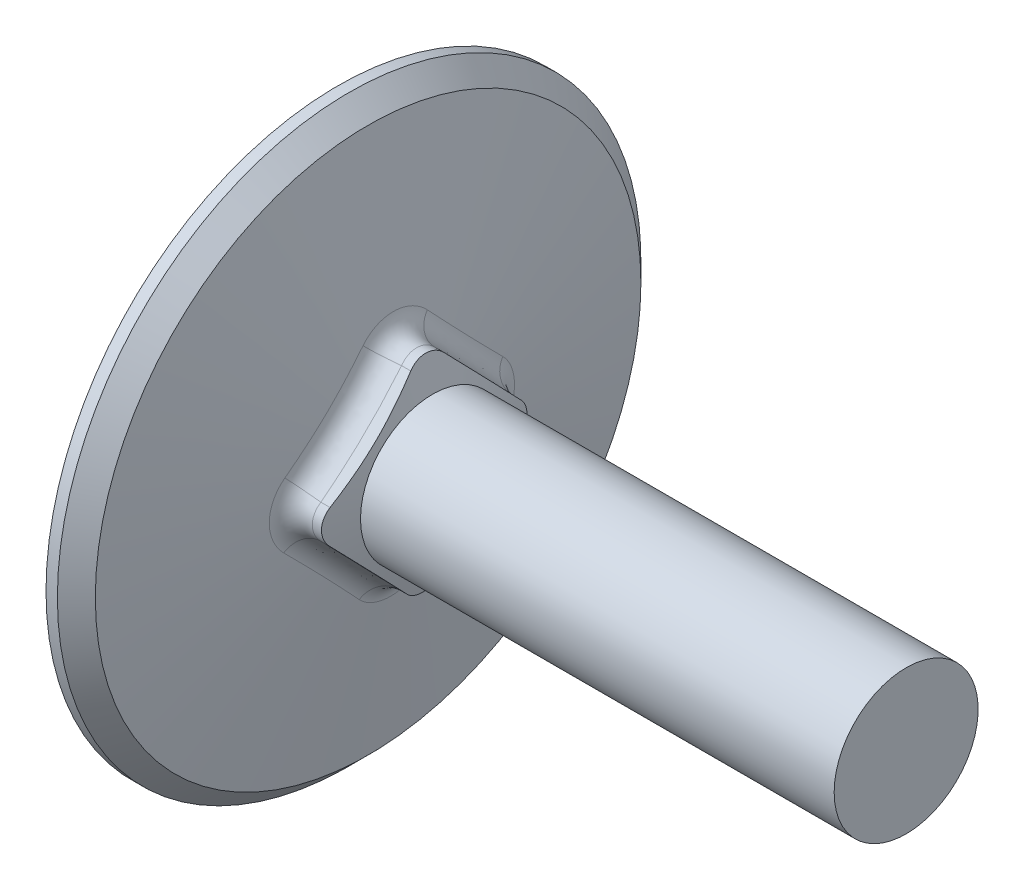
ISO-10303-21;
HEADER;
FILE_DESCRIPTION(('STEP AP214'),'2;1');
FILE_NAME('part.step','',(''),(''),'','','');
FILE_SCHEMA(('AUTOMOTIVE_DESIGN { 1 0 10303 214 1 1 1 1 }'));
ENDSEC;
DATA;
#1=APPLICATION_CONTEXT('core data for automotive mechanical design processes');
#2=APPLICATION_PROTOCOL_DEFINITION('international standard','automotive_design',2000,#1);
#3=PRODUCT_CONTEXT('',#1,'mechanical');
#4=PRODUCT('Part','Part','',(#3));
#5=PRODUCT_RELATED_PRODUCT_CATEGORY('part','',(#4));
#6=PRODUCT_DEFINITION_FORMATION('','',#4);
#7=PRODUCT_DEFINITION_CONTEXT('part definition',#1,'design');
#8=PRODUCT_DEFINITION('design','',#6,#7);
#9=PRODUCT_DEFINITION_SHAPE('','',#8);
#10=(LENGTH_UNIT() NAMED_UNIT(*) SI_UNIT(.MILLI.,.METRE.));
#11=(NAMED_UNIT(*) PLANE_ANGLE_UNIT() SI_UNIT($,.RADIAN.));
#12=(NAMED_UNIT(*) SI_UNIT($,.STERADIAN.) SOLID_ANGLE_UNIT());
#13=UNCERTAINTY_MEASURE_WITH_UNIT(LENGTH_MEASURE(1.E-05),#10,'distance_accuracy_value','');
#14=(GEOMETRIC_REPRESENTATION_CONTEXT(3) GLOBAL_UNCERTAINTY_ASSIGNED_CONTEXT((#13)) GLOBAL_UNIT_ASSIGNED_CONTEXT((#10,
#11,#12)) REPRESENTATION_CONTEXT('',''));
#15=CARTESIAN_POINT('',(0.,0.,0.));
#16=DIRECTION('',(0.,0.,1.));
#17=DIRECTION('',(1.,0.,0.));
#18=AXIS2_PLACEMENT_3D('',#15,#16,#17);
#19=CARTESIAN_POINT('',(3.175,2.65775096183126,-0.0463912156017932));
#20=DIRECTION('',(-1.,0.,0.));
#21=DIRECTION('',(0.,0.,1.));
#22=AXIS2_PLACEMENT_3D('',#19,#20,#21);
#23=CYLINDRICAL_SURFACE('',#22,0.7874);
#24=DIRECTION('',(-1.,0.,0.));
#25=VECTOR('',#24,1.);
#26=CARTESIAN_POINT('',(3.175,3.20472496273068,-0.612799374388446));
#27=LINE('',#26,#25);
#28=CARTESIAN_POINT('',(2.94730000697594,3.20472496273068,-0.612799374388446));
#29=VERTEX_POINT('',#28);
#30=CARTESIAN_POINT('',(2.63932532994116,3.20472496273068,-0.612799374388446));
#31=VERTEX_POINT('',#30);
#32=EDGE_CURVE('E135',#29,#31,#27,.T.);
#33=ORIENTED_EDGE('',*,*,#32,.T.);
#34=CARTESIAN_POINT('',(1.90977521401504,3.24936744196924,1.31517652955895));
#35=CARTESIAN_POINT('',(1.99152011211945,2.94556442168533,0.690129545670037));
#36=CARTESIAN_POINT('',(2.68748101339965,3.01064849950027,0.657499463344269));
#37=CARTESIAN_POINT('',(1.90049846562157,3.32781179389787,1.27760512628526));
#38=CARTESIAN_POINT('',(1.98469558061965,2.99001022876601,0.672493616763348));
#39=CARTESIAN_POINT('',(2.67820426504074,3.05029513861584,0.637666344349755));
#40=CARTESIAN_POINT('',(1.8918203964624,3.40291361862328,1.23326031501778));
#41=CARTESIAN_POINT('',(1.97824583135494,3.03296637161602,0.65066684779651));
#42=CARTESIAN_POINT('',(2.66952619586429,3.08825178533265,0.614407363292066));
#43=CARTESIAN_POINT('',(1.87574358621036,3.54439666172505,1.13259602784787));
#44=CARTESIAN_POINT('',(1.96623184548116,3.11429415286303,0.599595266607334));
#45=CARTESIAN_POINT('',(2.65344938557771,3.15975516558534,0.561837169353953));
#46=CARTESIAN_POINT('',(1.86834407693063,3.61078311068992,1.07628378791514));
#47=CARTESIAN_POINT('',(1.96066127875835,3.15270365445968,0.57036310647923));
#48=CARTESIAN_POINT('',(2.64604987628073,3.1933045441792,0.532529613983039));
#49=CARTESIAN_POINT('',(1.85494549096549,3.73244064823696,0.95366996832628));
#50=CARTESIAN_POINT('',(1.95053698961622,3.22335330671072,0.505589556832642));
#51=CARTESIAN_POINT('',(2.63265129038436,3.25478195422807,0.468875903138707));
#52=CARTESIAN_POINT('',(1.8489363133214,3.78779147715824,0.887446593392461));
#53=CARTESIAN_POINT('',(1.94597111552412,3.25566914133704,0.470096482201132));
#54=CARTESIAN_POINT('',(2.62664211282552,3.28275031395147,0.434569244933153));
#55=CARTESIAN_POINT('',(1.83830636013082,3.8863919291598,0.746635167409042));
#56=CARTESIAN_POINT('',(1.93787394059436,3.31338805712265,0.393831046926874));
#57=CARTESIAN_POINT('',(2.61601215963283,3.33256793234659,0.361733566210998));
#58=CARTESIAN_POINT('',(1.83368522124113,3.92964471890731,0.672049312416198));
#59=CARTESIAN_POINT('',(1.93433838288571,3.33882050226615,0.353050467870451));
#60=CARTESIAN_POINT('',(2.61139102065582,3.35441879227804,0.323205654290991));
#61=CARTESIAN_POINT('',(1.8258763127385,4.002780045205,0.516688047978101));
#62=CARTESIAN_POINT('',(1.92835527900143,3.38190084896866,0.267561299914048));
#63=CARTESIAN_POINT('',(2.60358211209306,3.39136080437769,0.243026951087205));
#64=CARTESIAN_POINT('',(1.82268773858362,4.03267008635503,0.435916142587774));
#65=CARTESIAN_POINT('',(1.92590414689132,3.39957447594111,0.22283865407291));
#66=CARTESIAN_POINT('',(2.60039353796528,3.40645575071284,0.201377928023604));
#67=CARTESIAN_POINT('',(1.81776659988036,4.078277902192,0.270350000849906));
#68=CARTESIAN_POINT('',(1.92211920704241,3.42657832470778,0.13085045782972));
#69=CARTESIAN_POINT('',(2.59547239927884,3.42948136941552,0.11604917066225));
#70=CARTESIAN_POINT('',(1.81603645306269,4.0939721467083,0.185549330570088));
#71=CARTESIAN_POINT('',(1.92078534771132,3.43590861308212,0.0835595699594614));
#72=CARTESIAN_POINT('',(2.59374225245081,3.43740014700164,0.0723661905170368));
#73=CARTESIAN_POINT('',(1.81406021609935,4.11061875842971,0.0147281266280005));
#74=CARTESIAN_POINT('',(1.91926231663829,3.44584665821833,-0.0118059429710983));
#75=CARTESIAN_POINT('',(2.59176601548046,3.44578608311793,-0.0156127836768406));
#76=CARTESIAN_POINT('',(1.81381060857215,4.11160607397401,-0.0712890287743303));
#77=CARTESIAN_POINT('',(1.91906966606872,3.44648051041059,-0.0599020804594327));
#78=CARTESIAN_POINT('',(2.59151640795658,3.44627090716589,-0.0599070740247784));
#79=CARTESIAN_POINT('',(1.81478729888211,4.09891316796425,-0.242094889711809));
#80=CARTESIAN_POINT('',(1.91982258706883,3.43907286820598,-0.155309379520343));
#81=CARTESIAN_POINT('',(2.59249309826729,3.43982654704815,-0.147874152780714));
#82=CARTESIAN_POINT('',(1.8160111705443,4.08525706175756,-0.32688538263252));
#83=CARTESIAN_POINT('',(1.92076666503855,3.43104234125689,-0.202645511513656));
#84=CARTESIAN_POINT('',(2.5937169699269,3.43290955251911,-0.191547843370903));
#85=CARTESIAN_POINT('',(1.81992085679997,4.0436963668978,-0.492963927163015));
#86=CARTESIAN_POINT('',(1.92377635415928,3.40660151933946,-0.29507085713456));
#87=CARTESIAN_POINT('',(2.5976266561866,3.41187289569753,-0.277128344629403));
#88=CARTESIAN_POINT('',(1.82260716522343,4.01578696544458,-0.574250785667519));
#89=CARTESIAN_POINT('',(1.92584385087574,3.39017664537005,-0.34018102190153));
#90=CARTESIAN_POINT('',(2.60031296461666,3.39775080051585,-0.319034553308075));
#91=CARTESIAN_POINT('',(1.82940910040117,3.94660631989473,-0.730833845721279));
#92=CARTESIAN_POINT('',(1.93106332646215,3.3495601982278,-0.426598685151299));
#93=CARTESIAN_POINT('',(2.60711489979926,3.36275132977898,-0.399822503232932));
#94=CARTESIAN_POINT('',(1.83352340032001,3.90534748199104,-0.806135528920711));
#95=CARTESIAN_POINT('',(1.93421688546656,3.3253564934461,-0.467927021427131));
#96=CARTESIAN_POINT('',(2.61122919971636,3.34188022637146,-0.438707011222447));
#97=CARTESIAN_POINT('',(1.84484684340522,3.7938758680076,-0.973817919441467));
#98=CARTESIAN_POINT('',(1.94286468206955,3.26017961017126,-0.559191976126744));
#99=CARTESIAN_POINT('',(2.62255264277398,3.28549439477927,-0.525405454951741));
#100=CARTESIAN_POINT('',(1.85263531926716,3.71858339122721,-1.06292839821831));
#101=CARTESIAN_POINT('',(1.94879641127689,3.21627166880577,-0.60705300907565));
#102=CARTESIAN_POINT('',(2.63034111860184,3.24741109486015,-0.571569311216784));
#103=CARTESIAN_POINT('',(1.86833649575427,3.57109451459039,-1.20159433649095));
#104=CARTESIAN_POINT('',(1.9606554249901,3.13092033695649,-0.6800199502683));
#105=CARTESIAN_POINT('',(2.64604229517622,3.17281105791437,-0.643624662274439));
#106=CARTESIAN_POINT('',(1.87572183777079,3.50291179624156,-1.2554568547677));
#107=CARTESIAN_POINT('',(1.96621540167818,3.09158785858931,-0.707842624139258));
#108=CARTESIAN_POINT('',(2.65342763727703,3.13832432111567,-0.671692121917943));
#109=CARTESIAN_POINT('',(1.89179164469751,3.35805441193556,-1.3511155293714));
#110=CARTESIAN_POINT('',(1.97822451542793,3.00855544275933,-0.756042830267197));
#111=CARTESIAN_POINT('',(2.66949744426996,3.06505642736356,-0.721731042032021));
#112=CARTESIAN_POINT('',(1.90048086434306,3.28134894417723,-1.39286581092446));
#113=CARTESIAN_POINT('',(1.98468266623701,2.96480515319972,-0.776382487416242));
#114=CARTESIAN_POINT('',(2.67818666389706,3.02625969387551,-0.743679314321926));
#115=CARTESIAN_POINT('',(1.90977521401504,3.20148901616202,-1.42777664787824));
#116=CARTESIAN_POINT('',(1.99152011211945,2.91968488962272,-0.792507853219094));
#117=CARTESIAN_POINT('',(2.68748101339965,2.9858680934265,-0.76216904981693));
#118=(BOUNDED_SURFACE() B_SPLINE_SURFACE(3,2,((#34,#35,#36),(#37,#38,#39),(#40,#41,#42),(#43,
#44,#45),(#46,#47,#48),(#49,#50,#51),(#52,#53,#54),(#55,#56,#57),(#58,#59,#60),(#61,#62,#63),
(#64,#65,#66),(#67,#68,#69),(#70,#71,#72),(#73,#74,#75),(#76,#77,#78),(#79,#80,#81),(#82,#83,
#84),(#85,#86,#87),(#88,#89,#90),(#91,#92,#93),(#94,#95,#96),(#97,#98,#99),(#100,#101,#102),
(#103,#104,#105),(#106,#107,#108),(#109,#110,#111),(#112,#113,#114),(#115,#116,#117)),
.UNSPECIFIED.,.F.,.F.,.F.) B_SPLINE_SURFACE_WITH_KNOTS((4,2,2,2,2,2,2,2,2,2,2,2,2,4),(3,3),(0.,
0.267095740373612,0.534030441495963,0.798960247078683,1.06382064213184,1.32853210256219,
1.59368153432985,1.85820078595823,2.12228508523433,2.38645861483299,2.65038733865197,
3.00686442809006,3.27338133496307,3.54089486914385),(0.,1.),
.UNSPECIFIED.) GEOMETRIC_REPRESENTATION_ITEM() RATIONAL_B_SPLINE_SURFACE(((1.,0.747481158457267,
1.),(1.,0.748792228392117,1.),(1.,0.750000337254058,1.),(1.,0.752213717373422,1.),(1.,
0.753219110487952,1.),(1.,0.755024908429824,1.),(1.,0.755826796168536,1.),(1.,0.75723691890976,
1.),(1.,0.757845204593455,1.),(1.,0.758869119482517,1.),(1.,0.759284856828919,1.),(1.,
0.759925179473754,1.),(1.,0.760149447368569,1.),(1.,0.760405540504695,1.),(1.,0.760437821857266,
1.),(1.,0.760311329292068,1.),(1.,0.760152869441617,1.),(1.,0.759645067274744,1.),(1.,
0.759295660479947,1.),(1.,0.758406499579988,1.),(1.,0.757866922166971,1.),(1.,0.756371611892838,
1.),(1.,0.755336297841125,1.),(1.,0.753220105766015,1.),(1.,0.752216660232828,1.),(1.,
0.750004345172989,1.),(1.,0.748794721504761,1.),(1.,0.747481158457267,1.))) REPRESENTATION_ITEM('') SURFACE());
#119=CARTESIAN_POINT('',(2.68748101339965,2.9858680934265,-0.76216904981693));
#120=CARTESIAN_POINT('',(2.67818666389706,3.02625969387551,-0.743679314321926));
#121=CARTESIAN_POINT('',(2.66949744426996,3.06505642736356,-0.721731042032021));
#122=CARTESIAN_POINT('',(2.65342763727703,3.13832432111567,-0.671692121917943));
#123=CARTESIAN_POINT('',(2.64604229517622,3.17281105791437,-0.643624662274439));
#124=CARTESIAN_POINT('',(2.63034111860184,3.24741109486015,-0.571569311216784));
#125=CARTESIAN_POINT('',(2.62255264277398,3.28549439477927,-0.525405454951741));
#126=CARTESIAN_POINT('',(2.61122919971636,3.34188022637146,-0.438707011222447));
#127=CARTESIAN_POINT('',(2.60711489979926,3.36275132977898,-0.399822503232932));
#128=CARTESIAN_POINT('',(2.60031296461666,3.39775080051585,-0.319034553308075));
#129=CARTESIAN_POINT('',(2.5976266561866,3.41187289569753,-0.277128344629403));
#130=CARTESIAN_POINT('',(2.59371696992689,3.43290955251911,-0.191547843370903));
#131=CARTESIAN_POINT('',(2.59249309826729,3.43982654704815,-0.147874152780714));
#132=CARTESIAN_POINT('',(2.59151640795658,3.44627090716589,-0.0599070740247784));
#133=CARTESIAN_POINT('',(2.59176601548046,3.44578608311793,-0.0156127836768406));
#134=CARTESIAN_POINT('',(2.59374225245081,3.43740014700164,0.0723661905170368));
#135=CARTESIAN_POINT('',(2.59547239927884,3.42948136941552,0.116049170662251));
#136=CARTESIAN_POINT('',(2.60039353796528,3.40645575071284,0.201377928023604));
#137=CARTESIAN_POINT('',(2.60358211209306,3.39136080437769,0.243026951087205));
#138=CARTESIAN_POINT('',(2.61139102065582,3.35441879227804,0.323205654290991));
#139=CARTESIAN_POINT('',(2.61601215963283,3.33256793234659,0.361733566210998));
#140=CARTESIAN_POINT('',(2.62664211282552,3.28275031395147,0.434569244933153));
#141=CARTESIAN_POINT('',(2.63265129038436,3.25478195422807,0.468875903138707));
#142=CARTESIAN_POINT('',(2.64604987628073,3.1933045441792,0.532529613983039));
#143=CARTESIAN_POINT('',(2.65344938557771,3.15975516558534,0.561837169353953));
#144=CARTESIAN_POINT('',(2.66952619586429,3.08825178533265,0.614407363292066));
#145=CARTESIAN_POINT('',(2.67820426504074,3.05029513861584,0.637666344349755));
#146=CARTESIAN_POINT('',(2.68748101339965,3.01064849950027,0.657499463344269));
#147=B_SPLINE_CURVE_WITH_KNOTS('',3,(#119,#120,#121,#122,#123,#124,#125,#126,#127,#128,#129,
#130,#131,#132,#133,#134,#135,#136,#137,#138,#139,#140,#141,#142,#143,#144,#145,#146),
.UNSPECIFIED.,.F.,.F.,(4,2,2,2,2,2,2,2,2,2,2,2,2,4),(0.,0.267513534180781,0.534030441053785,
0.89050753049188,1.15443625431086,1.41860978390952,1.68269408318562,1.947213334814,
2.21236276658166,2.47707422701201,2.74193462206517,3.00686442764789,3.27379912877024,
3.54089486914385),.UNSPECIFIED.);
#148=CARTESIAN_POINT('',(2.63932532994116,3.22415912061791,0.500582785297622));
#149=VERTEX_POINT('',#148);
#150=EDGE_CURVE('E11',#31,#149,#147,.T.);
#151=ORIENTED_EDGE('',*,*,#150,.T.);
#152=DIRECTION('',(-1.,0.,0.));
#153=VECTOR('',#152,1.);
#154=CARTESIAN_POINT('',(3.175,3.22415912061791,0.500582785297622));
#155=LINE('',#154,#153);
#156=CARTESIAN_POINT('',(2.94730000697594,3.22415912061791,0.500582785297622));
#157=VERTEX_POINT('',#156);
#158=EDGE_CURVE('E136',#157,#149,#155,.T.);
#159=ORIENTED_EDGE('',*,*,#158,.F.);
#160=CARTESIAN_POINT('',(2.9473444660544,3.20451778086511,-0.612999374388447));
#161=CARTESIAN_POINT('',(2.9406229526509,3.23584826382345,-0.582821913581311));
#162=CARTESIAN_POINT('',(2.93452810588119,3.2646918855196,-0.549925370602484));
#163=CARTESIAN_POINT('',(2.92368167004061,3.31664122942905,-0.479695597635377));
#164=CARTESIAN_POINT('',(2.91892971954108,3.33974849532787,-0.442363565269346));
#165=CARTESIAN_POINT('',(2.91085157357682,3.37949690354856,-0.364211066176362));
#166=CARTESIAN_POINT('',(2.90752669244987,3.39613208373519,-0.323387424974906));
#167=CARTESIAN_POINT('',(2.90236815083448,3.42237599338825,-0.239466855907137));
#168=CARTESIAN_POINT('',(2.90053393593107,3.43198733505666,-0.196370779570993));
#169=CARTESIAN_POINT('',(2.89839916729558,3.44381798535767,-0.109598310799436));
#170=CARTESIAN_POINT('',(2.89808279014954,3.44611347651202,-0.0659326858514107));
#171=CARTESIAN_POINT('',(2.89894641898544,3.44345618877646,0.0211688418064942));
#172=CARTESIAN_POINT('',(2.90012660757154,3.43850252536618,0.0646047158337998));
#173=CARTESIAN_POINT('',(2.90395372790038,3.42154760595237,0.149803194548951));
#174=CARTESIAN_POINT('',(2.9065940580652,3.40957805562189,0.191572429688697));
#175=CARTESIAN_POINT('',(2.91329178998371,3.37899265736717,0.272478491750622));
#176=CARTESIAN_POINT('',(2.91734882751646,3.36037851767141,0.311615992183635));
#177=CARTESIAN_POINT('',(2.92557855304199,3.32271767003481,0.376501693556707));
#178=CARTESIAN_POINT('',(2.92944874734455,3.30503342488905,0.403091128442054));
#179=CARTESIAN_POINT('',(2.9378837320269,3.26667160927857,0.453836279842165));
#180=CARTESIAN_POINT('',(2.94244756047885,3.24599818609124,0.477995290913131));
#181=CARTESIAN_POINT('',(2.94734293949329,3.22396591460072,0.500782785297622));
#182=B_SPLINE_CURVE_WITH_KNOTS('',3,(#160,#161,#162,#163,#164,#165,#166,#167,#168,#169,#170,
#171,#172,#173,#174,#175,#176,#177,#178,#179,#180,#181),.UNSPECIFIED.,.F.,.F.,(4,2,2,2,2,2,2,2,
2,2,4),(0.,0.131897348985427,0.263759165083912,0.395742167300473,0.527676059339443,
0.65823151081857,0.788802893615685,0.918788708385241,1.04874112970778,1.1450130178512,
1.2411525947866),.UNSPECIFIED.);
#183=EDGE_CURVE('E128',#29,#157,#182,.T.);
#184=ORIENTED_EDGE('',*,*,#183,.F.);
#185=EDGE_LOOP('',(#33,#151,#159,#184));
#186=FACE_BOUND('',#185,.T.);
#187=ADVANCED_FACE('F32',(#186),#23,.T.);
#188=CARTESIAN_POINT('',(3.175,3.22415912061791,0.500582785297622));
#189=DIRECTION('',(0.,-0.71933980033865,-0.694658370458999));
#190=DIRECTION('',(0.,0.694658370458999,-0.71933980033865));
#191=AXIS2_PLACEMENT_3D('',#188,#189,#190);
#192=PLANE('',#191);
#193=ORIENTED_EDGE('',*,*,#158,.T.);
#194=CARTESIAN_POINT('',(1.41336808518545,-1.52555660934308,6.46199045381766));
#195=CARTESIAN_POINT('',(1.47091310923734,-2.05214849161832,5.96435926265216));
#196=CARTESIAN_POINT('',(2.19107388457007,-2.12026646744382,6.03489749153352));
#197=CARTESIAN_POINT('',(1.45779481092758,-1.30137438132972,6.22609832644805));
#198=CARTESIAN_POINT('',(1.51746503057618,-1.82654905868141,5.73074421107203));
#199=CARTESIAN_POINT('',(2.23550061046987,-1.89310758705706,5.79966758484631));
#200=CARTESIAN_POINT('',(1.50144598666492,-1.07747559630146,5.99007585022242));
#201=CARTESIAN_POINT('',(1.56354079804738,-1.60078583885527,5.4969595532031));
#202=CARTESIAN_POINT('',(2.27915178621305,-1.66586738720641,5.56435346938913));
#203=CARTESIAN_POINT('',(1.5858611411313,-0.630484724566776,5.51794452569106));
#204=CARTESIAN_POINT('',(1.65329688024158,-1.14939119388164,5.02952671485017));
#205=CARTESIAN_POINT('',(2.36356694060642,-1.21107553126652,5.0934027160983));
#206=CARTESIAN_POINT('',(1.62662443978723,-0.40739283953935,5.28183567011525));
#207=CARTESIAN_POINT('',(1.6969533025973,-0.923921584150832,4.79604609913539));
#208=CARTESIAN_POINT('',(2.40433023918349,-0.983523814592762,4.85776601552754));
#209=CARTESIAN_POINT('',(1.70389538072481,0.0375799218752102,4.80987942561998));
#210=CARTESIAN_POINT('',(1.78050992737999,-0.473410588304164,4.32952830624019));
#211=CARTESIAN_POINT('',(2.48160118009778,-0.528127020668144,4.38618883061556));
#212=CARTESIAN_POINT('',(1.74040414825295,0.259461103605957,4.574031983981));
#213=CARTESIAN_POINT('',(1.82039592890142,-0.24853902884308,4.09666698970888));
#214=CARTESIAN_POINT('',(2.51810994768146,-0.300282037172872,4.1502484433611));
#215=CARTESIAN_POINT('',(1.80681518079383,0.701830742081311,4.10318469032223));
#216=CARTESIAN_POINT('',(1.89378407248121,0.200534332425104,3.63163791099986));
#217=CARTESIAN_POINT('',(2.58452098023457,0.155883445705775,3.67787525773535));
#218=CARTESIAN_POINT('',(1.83671751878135,0.922319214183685,3.86818482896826));
#219=CARTESIAN_POINT('',(1.92730253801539,0.424643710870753,3.39956585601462));
#220=CARTESIAN_POINT('',(2.61442331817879,0.384203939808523,3.44144246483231));
#221=CARTESIAN_POINT('',(1.88528431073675,1.35129866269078,3.41182150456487));
#222=CARTESIAN_POINT('',(1.9823145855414,0.860730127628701,2.94798515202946));
#223=CARTESIAN_POINT('',(2.66299011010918,0.830037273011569,2.97976853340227));
#224=CARTESIAN_POINT('',(1.90443329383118,1.5598414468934,3.19036062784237));
#225=CARTESIAN_POINT('',(2.00437998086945,1.072856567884,2.72832179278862));
#226=CARTESIAN_POINT('',(2.68213909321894,1.04752347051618,2.7545549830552));
#227=CARTESIAN_POINT('',(1.93047381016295,1.97729771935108,2.75024848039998));
#228=CARTESIAN_POINT('',(2.03446707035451,1.49592424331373,2.29022239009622));
#229=CARTESIAN_POINT('',(2.7081796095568,1.48283290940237,2.30377886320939));
#230=CARTESIAN_POINT('',(1.9373676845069,2.18621112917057,2.53159668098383));
#231=CARTESIAN_POINT('',(2.04257035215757,1.70738814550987,2.07124510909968));
#232=CARTESIAN_POINT('',(2.71507348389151,1.70065607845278,2.07821636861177));
#233=CARTESIAN_POINT('',(1.9373676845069,2.60635216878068,2.09652789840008));
#234=CARTESIAN_POINT('',(2.04257035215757,2.12957034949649,1.63406263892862));
#235=CARTESIAN_POINT('',(2.71507348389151,2.13630241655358,1.62709137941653));
#236=CARTESIAN_POINT('',(1.93047381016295,2.8175797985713,1.88011091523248));
#237=CARTESIAN_POINT('',(2.03446707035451,2.34103425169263,1.41508535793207));
#238=CARTESIAN_POINT('',(2.7081796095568,2.35412558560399,1.40152888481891));
#239=CARTESIAN_POINT('',(1.90443329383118,3.24285482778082,1.44754925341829));
#240=CARTESIAN_POINT('',(2.00437998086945,2.76410192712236,0.976985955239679));
#241=CARTESIAN_POINT('',(2.68213909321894,2.78943502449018,0.950752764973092));
#242=CARTESIAN_POINT('',(1.88528431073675,3.45690275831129,1.23140463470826));
#243=CARTESIAN_POINT('',(1.98231458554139,2.97622836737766,0.757322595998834));
#244=CARTESIAN_POINT('',(2.66299011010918,3.00692122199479,0.725539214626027));
#245=CARTESIAN_POINT('',(1.83671751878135,3.89801691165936,0.786759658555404));
#246=CARTESIAN_POINT('',(1.92730253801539,3.41231478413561,0.305741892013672));
#247=CARTESIAN_POINT('',(2.61442331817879,3.45275455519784,0.263865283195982));
#248=CARTESIAN_POINT('',(1.80681518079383,4.12517868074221,0.558204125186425));
#249=CARTESIAN_POINT('',(1.89378407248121,3.63642416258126,0.0736698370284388));
#250=CARTESIAN_POINT('',(2.58452098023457,3.68107504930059,0.0274324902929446));
#251=CARTESIAN_POINT('',(1.74040414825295,4.5803006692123,0.0996716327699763));
#252=CARTESIAN_POINT('',(1.82039592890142,4.08549752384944,-0.391359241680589));
#253=CARTESIAN_POINT('',(2.51810994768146,4.13724053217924,-0.444940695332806));
#254=CARTESIAN_POINT('',(1.70389538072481,4.80826089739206,-0.130305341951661));
#255=CARTESIAN_POINT('',(1.78050992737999,4.31036908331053,-0.624220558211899));
#256=CARTESIAN_POINT('',(2.48160118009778,4.36508551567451,-0.680881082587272));
#257=CARTESIAN_POINT('',(1.62662443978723,5.26440031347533,-0.591478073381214));
#258=CARTESIAN_POINT('',(1.6969533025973,4.76088007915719,-1.0907383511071));
#259=CARTESIAN_POINT('',(2.40433023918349,4.82048230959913,-1.15245826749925));
#260=CARTESIAN_POINT('',(1.5858611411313,5.49257954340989,-0.822674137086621));
#261=CARTESIAN_POINT('',(1.65329688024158,4.986349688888,-1.32421896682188));
#262=CARTESIAN_POINT('',(2.36356694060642,5.04803402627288,-1.38809496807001));
#263=CARTESIAN_POINT('',(1.50144598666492,5.94882350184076,-1.28586985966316));
#264=CARTESIAN_POINT('',(1.56354079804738,5.43774433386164,-1.79165180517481));
#265=CARTESIAN_POINT('',(2.27915178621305,5.50282588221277,-1.85904572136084));
#266=CARTESIAN_POINT('',(1.45779481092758,6.1768882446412,-1.51786931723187));
#267=CARTESIAN_POINT('',(1.51746503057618,5.66350755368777,-2.02543646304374));
#268=CARTESIAN_POINT('',(2.23550061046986,5.73006608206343,-2.09435983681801));
#269=CARTESIAN_POINT('',(1.41336808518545,6.4048128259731,-1.75014749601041));
#270=CARTESIAN_POINT('',(1.47091310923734,5.88910698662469,-2.25905151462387));
#271=CARTESIAN_POINT('',(2.19107388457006,5.95722496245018,-2.32958974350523));
#272=(BOUNDED_SURFACE() B_SPLINE_SURFACE(3,2,((#194,#195,#196),(#197,#198,#199),(#200,#201,
#202),(#203,#204,#205),(#206,#207,#208),(#209,#210,#211),(#212,#213,#214),(#215,#216,#217),
(#218,#219,#220),(#221,#222,#223),(#224,#225,#226),(#227,#228,#229),(#230,#231,#232),(#233,#234,
#235),(#236,#237,#238),(#239,#240,#241),(#242,#243,#244),(#245,#246,#247),(#248,#249,#250),
(#251,#252,#253),(#254,#255,#256),(#257,#258,#259),(#260,#261,#262),(#263,#264,#265),(#266,#267,
#268),(#269,#270,#271)),.UNSPECIFIED.,.F.,.F.,.F.) B_SPLINE_SURFACE_WITH_KNOTS((4,2,2,2,2,2,2,2,
2,2,2,2,4),(3,3),(0.,0.990053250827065,1.9803388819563,2.97036200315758,3.96037418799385,
4.90119860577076,5.84184327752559,6.78248794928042,7.72331236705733,8.7133245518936,
9.70334767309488,10.6936333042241,11.6836865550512),(0.,1.),
.UNSPECIFIED.) GEOMETRIC_REPRESENTATION_ITEM() RATIONAL_B_SPLINE_SURFACE(((1.,0.734814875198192,
1.),(1.,0.735938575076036,1.),(1.,0.737187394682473,1.),(1.,0.739952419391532,1.),(1.,
0.741468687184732,1.),(1.,0.744784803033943,1.),(1.,0.746584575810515,1.),(1.,0.750344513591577,
1.),(1.,0.752304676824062,1.),(1.,0.755855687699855,1.),(1.,0.757460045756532,1.),(1.,
0.759735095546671,1.),(1.,0.760405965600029,1.),(1.,0.760405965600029,1.),(1.,0.759735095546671,
1.),(1.,0.757460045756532,1.),(1.,0.755855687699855,1.),(1.,0.752304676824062,1.),(1.,
0.750344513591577,1.),(1.,0.746584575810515,1.),(1.,0.744784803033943,1.),(1.,0.741468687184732,
1.),(1.,0.739952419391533,1.),(1.,0.737187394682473,1.),(1.,0.735938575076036,1.),(1.,
0.734814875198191,1.))) REPRESENTATION_ITEM('') SURFACE());
#273=CARTESIAN_POINT('',(2.19107388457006,5.95722496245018,-2.32958974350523));
#274=CARTESIAN_POINT('',(2.23550061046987,5.73006608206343,-2.09435983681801));
#275=CARTESIAN_POINT('',(2.27915178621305,5.50282588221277,-1.85904572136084));
#276=CARTESIAN_POINT('',(2.36356694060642,5.04803402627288,-1.38809496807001));
#277=CARTESIAN_POINT('',(2.40433023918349,4.82048230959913,-1.15245826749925));
#278=CARTESIAN_POINT('',(2.48160118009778,4.36508551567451,-0.680881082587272));
#279=CARTESIAN_POINT('',(2.51810994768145,4.13724053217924,-0.444940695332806));
#280=CARTESIAN_POINT('',(2.58452098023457,3.68107504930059,0.0274324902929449));
#281=CARTESIAN_POINT('',(2.61442331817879,3.45275455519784,0.263865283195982));
#282=CARTESIAN_POINT('',(2.66299011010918,3.00692122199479,0.725539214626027));
#283=CARTESIAN_POINT('',(2.68213909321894,2.78943502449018,0.950752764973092));
#284=CARTESIAN_POINT('',(2.7081796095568,2.35412558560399,1.40152888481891));
#285=CARTESIAN_POINT('',(2.71507348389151,2.13630241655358,1.62709137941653));
#286=CARTESIAN_POINT('',(2.71507348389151,1.70065607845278,2.07821636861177));
#287=CARTESIAN_POINT('',(2.7081796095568,1.48283290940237,2.30377886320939));
#288=CARTESIAN_POINT('',(2.68213909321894,1.04752347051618,2.7545549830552));
#289=CARTESIAN_POINT('',(2.66299011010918,0.830037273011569,2.97976853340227));
#290=CARTESIAN_POINT('',(2.61442331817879,0.384203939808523,3.44144246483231));
#291=CARTESIAN_POINT('',(2.58452098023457,0.155883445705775,3.67787525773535));
#292=CARTESIAN_POINT('',(2.51810994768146,-0.300282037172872,4.1502484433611));
#293=CARTESIAN_POINT('',(2.48160118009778,-0.528127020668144,4.38618883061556));
#294=CARTESIAN_POINT('',(2.40433023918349,-0.983523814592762,4.85776601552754));
#295=CARTESIAN_POINT('',(2.36356694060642,-1.21107553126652,5.0934027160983));
#296=CARTESIAN_POINT('',(2.27915178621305,-1.66586738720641,5.56435346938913));
#297=CARTESIAN_POINT('',(2.23550061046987,-1.89310758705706,5.79966758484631));
#298=CARTESIAN_POINT('',(2.19107388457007,-2.12026646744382,6.03489749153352));
#299=B_SPLINE_CURVE_WITH_KNOTS('',3,(#273,#274,#275,#276,#277,#278,#279,#280,#281,#282,#283,
#284,#285,#286,#287,#288,#289,#290,#291,#292,#293,#294,#295,#296,#297,#298),.UNSPECIFIED.,.F.,
.F.,(4,2,2,2,2,2,2,2,2,2,2,2,4),(0.,0.990053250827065,1.9803388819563,2.97036200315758,
3.96037418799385,4.90119860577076,5.84184327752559,6.78248794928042,7.72331236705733,
8.7133245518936,9.70334767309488,10.6936333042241,11.6836865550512),.UNSPECIFIED.);
#300=CARTESIAN_POINT('',(2.63932532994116,0.612799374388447,3.20472496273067));
#301=VERTEX_POINT('',#300);
#302=EDGE_CURVE('E416',#149,#301,#299,.T.);
#303=ORIENTED_EDGE('',*,*,#302,.T.);
#304=DIRECTION('',(-1.,0.,0.));
#305=VECTOR('',#304,1.);
#306=CARTESIAN_POINT('',(3.175,0.612799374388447,3.20472496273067));
#307=LINE('',#306,#305);
#308=CARTESIAN_POINT('',(2.94730000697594,0.612799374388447,3.20472496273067));
#309=VERTEX_POINT('',#308);
#310=EDGE_CURVE('E162',#309,#301,#307,.T.);
#311=ORIENTED_EDGE('',*,*,#310,.F.);
#312=CARTESIAN_POINT('',(2.94725556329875,3.22435912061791,0.500375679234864));
#313=CARTESIAN_POINT('',(2.96874127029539,3.12763523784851,0.600536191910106));
#314=CARTESIAN_POINT('',(2.9886925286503,3.03072945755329,0.700885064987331));
#315=CARTESIAN_POINT('',(3.02469480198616,2.83651914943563,0.901995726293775));
#316=CARTESIAN_POINT('',(3.040743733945,2.7392144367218,1.00275770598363));
#317=CARTESIAN_POINT('',(3.06807313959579,2.54436127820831,1.20453405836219));
#318=CARTESIAN_POINT('',(3.07935785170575,2.44681312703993,1.30554812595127));
#319=CARTESIAN_POINT('',(3.09641395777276,2.25149993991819,1.50780085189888));
#320=CARTESIAN_POINT('',(3.10218650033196,2.15373495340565,1.60903945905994));
#321=CARTESIAN_POINT('',(3.10773862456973,1.95912630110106,1.81056261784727));
#322=CARTESIAN_POINT('',(3.10757927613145,1.86228350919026,1.91084626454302));
#323=CARTESIAN_POINT('',(3.10143731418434,1.66868509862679,2.11132328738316));
#324=CARTESIAN_POINT('',(3.09545418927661,1.57192948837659,2.21151665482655));
#325=CARTESIAN_POINT('',(3.06943277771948,1.28208803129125,2.51165626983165));
#326=CARTESIAN_POINT('',(3.04132442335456,1.08933628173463,2.71125654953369));
#327=CARTESIAN_POINT('',(3.00116346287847,0.873616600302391,2.93464081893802));
#328=CARTESIAN_POINT('',(2.99662340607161,0.849870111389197,2.95923102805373));
#329=CARTESIAN_POINT('',(2.98732313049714,0.802399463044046,3.00838832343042));
#330=CARTESIAN_POINT('',(2.98256293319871,0.778675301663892,3.03295541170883));
#331=CARTESIAN_POINT('',(2.97282670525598,0.731214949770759,3.08210204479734));
#332=CARTESIAN_POINT('',(2.96785038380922,0.707478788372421,3.10668155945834));
#333=CARTESIAN_POINT('',(2.95769905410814,0.660024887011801,3.15582151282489));
#334=CARTESIAN_POINT('',(2.9525240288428,0.636307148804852,3.18038194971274));
#335=CARTESIAN_POINT('',(2.94725556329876,0.612599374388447,3.20493206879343));
#336=B_SPLINE_CURVE_WITH_KNOTS('',3,(#312,#313,#314,#315,#316,#317,#318,#319,#320,#321,#322,
#323,#324,#325,#326,#327,#328,#329,#330,#331,#332,#333,#334,#335),.UNSPECIFIED.,.F.,.F.,(4,2,2,
2,2,2,2,2,2,2,2,4),(0.,0.422691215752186,0.845607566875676,1.26814687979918,1.69059812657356,
2.10870137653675,2.52684134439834,3.36272817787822,3.46618405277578,3.56962985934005,
3.6732194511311,3.77681793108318),.UNSPECIFIED.);
#337=EDGE_CURVE('E137',#157,#309,#336,.T.);
#338=ORIENTED_EDGE('',*,*,#337,.F.);
#339=EDGE_LOOP('',(#193,#303,#311,#338));
#340=FACE_BOUND('',#339,.T.);
#341=ADVANCED_FACE('F218',(#340),#192,.F.);
#342=CARTESIAN_POINT('',(3.175,0.0463912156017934,2.65775096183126));
#343=DIRECTION('',(-1.,0.,0.));
#344=DIRECTION('',(0.,0.,1.));
#345=AXIS2_PLACEMENT_3D('',#342,#343,#344);
#346=CYLINDRICAL_SURFACE('',#345,0.7874);
#347=ORIENTED_EDGE('',*,*,#310,.T.);
#348=CARTESIAN_POINT('',(1.90977521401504,-1.31517652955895,3.24936744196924));
#349=CARTESIAN_POINT('',(1.99152011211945,-0.690129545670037,2.94556442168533));
#350=CARTESIAN_POINT('',(2.68748101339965,-0.657499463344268,3.01064849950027));
#351=CARTESIAN_POINT('',(1.90049846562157,-1.27760512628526,3.32781179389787));
#352=CARTESIAN_POINT('',(1.98469558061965,-0.672493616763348,2.99001022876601));
#353=CARTESIAN_POINT('',(2.67820426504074,-0.637666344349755,3.05029513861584));
#354=CARTESIAN_POINT('',(1.8918203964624,-1.23326031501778,3.40291361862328));
#355=CARTESIAN_POINT('',(1.97824583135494,-0.65066684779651,3.03296637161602));
#356=CARTESIAN_POINT('',(2.66952619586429,-0.614407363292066,3.08825178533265));
#357=CARTESIAN_POINT('',(1.87574358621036,-1.13259602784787,3.54439666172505));
#358=CARTESIAN_POINT('',(1.96623184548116,-0.599595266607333,3.11429415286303));
#359=CARTESIAN_POINT('',(2.65344938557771,-0.561837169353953,3.15975516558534));
#360=CARTESIAN_POINT('',(1.86834407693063,-1.07628378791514,3.61078311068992));
#361=CARTESIAN_POINT('',(1.96066127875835,-0.57036310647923,3.15270365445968));
#362=CARTESIAN_POINT('',(2.64604987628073,-0.532529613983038,3.19330454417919));
#363=CARTESIAN_POINT('',(1.85494549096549,-0.95366996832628,3.73244064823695));
#364=CARTESIAN_POINT('',(1.95053698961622,-0.505589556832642,3.22335330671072));
#365=CARTESIAN_POINT('',(2.63265129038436,-0.468875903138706,3.25478195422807));
#366=CARTESIAN_POINT('',(1.8489363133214,-0.88744659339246,3.78779147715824));
#367=CARTESIAN_POINT('',(1.94597111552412,-0.470096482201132,3.25566914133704));
#368=CARTESIAN_POINT('',(2.62664211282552,-0.434569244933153,3.28275031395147));
#369=CARTESIAN_POINT('',(1.83830636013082,-0.746635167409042,3.8863919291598));
#370=CARTESIAN_POINT('',(1.93787394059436,-0.393831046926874,3.31338805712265));
#371=CARTESIAN_POINT('',(2.61601215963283,-0.361733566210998,3.33256793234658));
#372=CARTESIAN_POINT('',(1.83368522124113,-0.672049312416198,3.92964471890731));
#373=CARTESIAN_POINT('',(1.93433838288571,-0.353050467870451,3.33882050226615));
#374=CARTESIAN_POINT('',(2.61139102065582,-0.323205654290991,3.35441879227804));
#375=CARTESIAN_POINT('',(1.8258763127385,-0.516688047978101,4.002780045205));
#376=CARTESIAN_POINT('',(1.92835527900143,-0.267561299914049,3.38190084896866));
#377=CARTESIAN_POINT('',(2.60358211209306,-0.243026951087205,3.39136080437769));
#378=CARTESIAN_POINT('',(1.82268773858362,-0.435916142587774,4.03267008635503));
#379=CARTESIAN_POINT('',(1.92590414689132,-0.22283865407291,3.39957447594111));
#380=CARTESIAN_POINT('',(2.60039353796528,-0.201377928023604,3.40645575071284));
#381=CARTESIAN_POINT('',(1.81776659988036,-0.270350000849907,4.078277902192));
#382=CARTESIAN_POINT('',(1.92211920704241,-0.13085045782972,3.42657832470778));
#383=CARTESIAN_POINT('',(2.59547239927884,-0.11604917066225,3.42948136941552));
#384=CARTESIAN_POINT('',(1.81603645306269,-0.185549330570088,4.0939721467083));
#385=CARTESIAN_POINT('',(1.92078534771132,-0.0835595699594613,3.43590861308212));
#386=CARTESIAN_POINT('',(2.59374225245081,-0.0723661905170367,3.43740014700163));
#387=CARTESIAN_POINT('',(1.81406021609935,-0.0147281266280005,4.11061875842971));
#388=CARTESIAN_POINT('',(1.91926231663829,0.0118059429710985,3.44584665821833));
#389=CARTESIAN_POINT('',(2.59176601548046,0.0156127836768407,3.44578608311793));
#390=CARTESIAN_POINT('',(1.81381060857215,0.0712890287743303,4.11160607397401));
#391=CARTESIAN_POINT('',(1.91906966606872,0.0599020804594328,3.44648051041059));
#392=CARTESIAN_POINT('',(2.59151640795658,0.0599070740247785,3.44627090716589));
#393=CARTESIAN_POINT('',(1.81478729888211,0.242094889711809,4.09891316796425));
#394=CARTESIAN_POINT('',(1.91982258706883,0.155309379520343,3.43907286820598));
#395=CARTESIAN_POINT('',(2.59249309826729,0.147874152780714,3.43982654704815));
#396=CARTESIAN_POINT('',(1.8160111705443,0.32688538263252,4.08525706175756));
#397=CARTESIAN_POINT('',(1.92076666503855,0.202645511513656,3.43104234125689));
#398=CARTESIAN_POINT('',(2.5937169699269,0.191547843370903,3.43290955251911));
#399=CARTESIAN_POINT('',(1.81992085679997,0.492963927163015,4.0436963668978));
#400=CARTESIAN_POINT('',(1.92377635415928,0.29507085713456,3.40660151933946));
#401=CARTESIAN_POINT('',(2.5976266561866,0.277128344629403,3.41187289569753));
#402=CARTESIAN_POINT('',(1.82260716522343,0.574250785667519,4.01578696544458));
#403=CARTESIAN_POINT('',(1.92584385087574,0.34018102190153,3.39017664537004));
#404=CARTESIAN_POINT('',(2.60031296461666,0.319034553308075,3.39775080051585));
#405=CARTESIAN_POINT('',(1.82940910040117,0.730833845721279,3.94660631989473));
#406=CARTESIAN_POINT('',(1.93106332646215,0.426598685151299,3.3495601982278));
#407=CARTESIAN_POINT('',(2.60711489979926,0.399822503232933,3.36275132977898));
#408=CARTESIAN_POINT('',(1.83352340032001,0.806135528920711,3.90534748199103));
#409=CARTESIAN_POINT('',(1.93421688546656,0.467927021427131,3.3253564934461));
#410=CARTESIAN_POINT('',(2.61122919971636,0.438707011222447,3.34188022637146));
#411=CARTESIAN_POINT('',(1.84484684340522,0.973817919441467,3.7938758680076));
#412=CARTESIAN_POINT('',(1.94286468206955,0.559191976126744,3.26017961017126));
#413=CARTESIAN_POINT('',(2.62255264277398,0.525405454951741,3.28549439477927));
#414=CARTESIAN_POINT('',(1.85263531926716,1.06292839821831,3.71858339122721));
#415=CARTESIAN_POINT('',(1.94879641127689,0.60705300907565,3.21627166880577));
#416=CARTESIAN_POINT('',(2.63034111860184,0.571569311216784,3.24741109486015));
#417=CARTESIAN_POINT('',(1.86833649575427,1.20159433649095,3.57109451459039));
#418=CARTESIAN_POINT('',(1.9606554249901,0.6800199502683,3.13092033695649));
#419=CARTESIAN_POINT('',(2.64604229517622,0.643624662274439,3.17281105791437));
#420=CARTESIAN_POINT('',(1.87572183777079,1.2554568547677,3.50291179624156));
#421=CARTESIAN_POINT('',(1.96621540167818,0.707842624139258,3.09158785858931));
#422=CARTESIAN_POINT('',(2.65342763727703,0.671692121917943,3.13832432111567));
#423=CARTESIAN_POINT('',(1.89179164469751,1.3511155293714,3.35805441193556));
#424=CARTESIAN_POINT('',(1.97822451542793,0.756042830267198,3.00855544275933));
#425=CARTESIAN_POINT('',(2.66949744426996,0.721731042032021,3.06505642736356));
#426=CARTESIAN_POINT('',(1.90048086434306,1.39286581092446,3.28134894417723));
#427=CARTESIAN_POINT('',(1.98468266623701,0.776382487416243,2.96480515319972));
#428=CARTESIAN_POINT('',(2.67818666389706,0.743679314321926,3.02625969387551));
#429=CARTESIAN_POINT('',(1.90977521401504,1.42777664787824,3.20148901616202));
#430=CARTESIAN_POINT('',(1.99152011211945,0.792507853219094,2.91968488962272));
#431=CARTESIAN_POINT('',(2.68748101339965,0.76216904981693,2.9858680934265));
#432=(BOUNDED_SURFACE() B_SPLINE_SURFACE(3,2,((#348,#349,#350),(#351,#352,#353),(#354,#355,
#356),(#357,#358,#359),(#360,#361,#362),(#363,#364,#365),(#366,#367,#368),(#369,#370,#371),
(#372,#373,#374),(#375,#376,#377),(#378,#379,#380),(#381,#382,#383),(#384,#385,#386),(#387,#388,
#389),(#390,#391,#392),(#393,#394,#395),(#396,#397,#398),(#399,#400,#401),(#402,#403,#404),
(#405,#406,#407),(#408,#409,#410),(#411,#412,#413),(#414,#415,#416),(#417,#418,#419),(#420,#421,
#422),(#423,#424,#425),(#426,#427,#428),(#429,#430,#431)),.UNSPECIFIED.,.F.,.F.,
.F.) B_SPLINE_SURFACE_WITH_KNOTS((4,2,2,2,2,2,2,2,2,2,2,2,2,4),(3,3),(0.,0.267095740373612,
0.534030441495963,0.798960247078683,1.06382064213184,1.32853210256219,1.59368153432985,
1.85820078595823,2.12228508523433,2.38645861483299,2.65038733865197,3.00686442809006,
3.27338133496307,3.54089486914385),(0.,1.),
.UNSPECIFIED.) GEOMETRIC_REPRESENTATION_ITEM() RATIONAL_B_SPLINE_SURFACE(((1.,0.747481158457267,
1.),(1.,0.748792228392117,1.),(1.,0.750000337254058,1.),(1.,0.752213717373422,1.),(1.,
0.753219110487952,1.),(1.,0.755024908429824,1.),(1.,0.755826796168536,1.),(1.,0.75723691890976,
1.),(1.,0.757845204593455,1.),(1.,0.758869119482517,1.),(1.,0.759284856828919,1.),(1.,
0.759925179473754,1.),(1.,0.760149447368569,1.),(1.,0.760405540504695,1.),(1.,0.760437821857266,
1.),(1.,0.760311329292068,1.),(1.,0.760152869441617,1.),(1.,0.759645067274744,1.),(1.,
0.759295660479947,1.),(1.,0.758406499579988,1.),(1.,0.757866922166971,1.),(1.,0.756371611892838,
1.),(1.,0.755336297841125,1.),(1.,0.753220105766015,1.),(1.,0.752216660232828,1.),(1.,
0.750004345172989,1.),(1.,0.748794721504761,1.),(1.,0.747481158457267,1.))) REPRESENTATION_ITEM('') SURFACE());
#433=CARTESIAN_POINT('',(2.68748101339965,0.76216904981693,2.9858680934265));
#434=CARTESIAN_POINT('',(2.67818666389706,0.743679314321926,3.02625969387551));
#435=CARTESIAN_POINT('',(2.66949744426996,0.721731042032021,3.06505642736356));
#436=CARTESIAN_POINT('',(2.65342763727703,0.671692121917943,3.13832432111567));
#437=CARTESIAN_POINT('',(2.64604229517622,0.643624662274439,3.17281105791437));
#438=CARTESIAN_POINT('',(2.63034111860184,0.571569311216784,3.24741109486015));
#439=CARTESIAN_POINT('',(2.62255264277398,0.525405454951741,3.28549439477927));
#440=CARTESIAN_POINT('',(2.61122919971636,0.438707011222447,3.34188022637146));
#441=CARTESIAN_POINT('',(2.60711489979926,0.399822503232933,3.36275132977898));
#442=CARTESIAN_POINT('',(2.60031296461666,0.319034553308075,3.39775080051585));
#443=CARTESIAN_POINT('',(2.5976266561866,0.277128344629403,3.41187289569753));
#444=CARTESIAN_POINT('',(2.5937169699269,0.191547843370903,3.43290955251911));
#445=CARTESIAN_POINT('',(2.59249309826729,0.147874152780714,3.43982654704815));
#446=CARTESIAN_POINT('',(2.59151640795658,0.0599070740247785,3.44627090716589));
#447=CARTESIAN_POINT('',(2.59176601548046,0.0156127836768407,3.44578608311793));
#448=CARTESIAN_POINT('',(2.59374225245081,-0.0723661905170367,3.43740014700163));
#449=CARTESIAN_POINT('',(2.59547239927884,-0.11604917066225,3.42948136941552));
#450=CARTESIAN_POINT('',(2.60039353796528,-0.201377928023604,3.40645575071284));
#451=CARTESIAN_POINT('',(2.60358211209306,-0.243026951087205,3.39136080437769));
#452=CARTESIAN_POINT('',(2.61139102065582,-0.323205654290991,3.35441879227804));
#453=CARTESIAN_POINT('',(2.61601215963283,-0.361733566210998,3.33256793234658));
#454=CARTESIAN_POINT('',(2.62664211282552,-0.434569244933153,3.28275031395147));
#455=CARTESIAN_POINT('',(2.63265129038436,-0.468875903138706,3.25478195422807));
#456=CARTESIAN_POINT('',(2.64604987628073,-0.532529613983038,3.19330454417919));
#457=CARTESIAN_POINT('',(2.65344938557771,-0.561837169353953,3.15975516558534));
#458=CARTESIAN_POINT('',(2.66952619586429,-0.614407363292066,3.08825178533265));
#459=CARTESIAN_POINT('',(2.67820426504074,-0.637666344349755,3.05029513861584));
#460=CARTESIAN_POINT('',(2.68748101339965,-0.657499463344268,3.01064849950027));
#461=B_SPLINE_CURVE_WITH_KNOTS('',3,(#433,#434,#435,#436,#437,#438,#439,#440,#441,#442,#443,
#444,#445,#446,#447,#448,#449,#450,#451,#452,#453,#454,#455,#456,#457,#458,#459,#460),
.UNSPECIFIED.,.F.,.F.,(4,2,2,2,2,2,2,2,2,2,2,2,2,4),(0.,0.267513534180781,0.534030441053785,
0.89050753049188,1.15443625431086,1.41860978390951,1.68269408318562,1.947213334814,
2.21236276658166,2.47707422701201,2.74193462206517,3.00686442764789,3.27379912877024,
3.54089486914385),.UNSPECIFIED.);
#462=CARTESIAN_POINT('',(2.63932532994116,-0.500582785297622,3.22415912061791));
#463=VERTEX_POINT('',#462);
#464=EDGE_CURVE('E420',#301,#463,#461,.T.);
#465=ORIENTED_EDGE('',*,*,#464,.T.);
#466=DIRECTION('',(-1.,0.,0.));
#467=VECTOR('',#466,1.);
#468=CARTESIAN_POINT('',(3.175,-0.500582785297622,3.22415912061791));
#469=LINE('',#468,#467);
#470=CARTESIAN_POINT('',(2.94730000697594,-0.500582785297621,3.22415912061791));
#471=VERTEX_POINT('',#470);
#472=EDGE_CURVE('E159',#471,#463,#469,.T.);
#473=ORIENTED_EDGE('',*,*,#472,.F.);
#474=CARTESIAN_POINT('',(2.94734292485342,0.61299244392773,3.20452496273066));
#475=CARTESIAN_POINT('',(2.94062151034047,0.582814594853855,3.23585505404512));
#476=CARTESIAN_POINT('',(2.93452676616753,0.549917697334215,3.26469825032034));
#477=CARTESIAN_POINT('',(2.92368054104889,0.479687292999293,3.3166466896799));
#478=CARTESIAN_POINT('',(2.91892869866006,0.442354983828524,3.33975347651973));
#479=CARTESIAN_POINT('',(2.91085077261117,0.364202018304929,3.37950088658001));
#480=CARTESIAN_POINT('',(2.9075260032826,0.323378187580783,3.39613554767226));
#481=CARTESIAN_POINT('',(2.90236768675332,0.239457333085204,3.42237839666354));
#482=CARTESIAN_POINT('',(2.90053358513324,0.196361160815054,3.43198919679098));
#483=CARTESIAN_POINT('',(2.89839904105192,0.10958858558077,3.44381876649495));
#484=CARTESIAN_POINT('',(2.89808277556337,0.0659229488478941,3.44611371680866));
#485=CARTESIAN_POINT('',(2.89894662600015,-0.021178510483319,3.44345535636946));
#486=CARTESIAN_POINT('',(2.90012692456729,-0.0646143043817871,3.43850116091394));
#487=CARTESIAN_POINT('',(2.90395426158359,-0.149812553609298,3.42154520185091));
#488=CARTESIAN_POINT('',(2.90659469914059,-0.191581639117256,3.4095751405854));
#489=CARTESIAN_POINT('',(2.9132926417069,-0.272487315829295,3.37898875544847));
#490=CARTESIAN_POINT('',(2.91734978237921,-0.311624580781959,3.36037414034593));
#491=CARTESIAN_POINT('',(2.92557950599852,-0.37650842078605,3.32271331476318));
#492=CARTESIAN_POINT('',(2.9294495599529,-0.40309634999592,3.30502972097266));
#493=CARTESIAN_POINT('',(2.9378841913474,-0.453838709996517,3.26666952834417));
#494=CARTESIAN_POINT('',(2.94244780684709,-0.477996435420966,3.24599707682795));
#495=CARTESIAN_POINT('',(2.94734293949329,-0.500782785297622,3.22396591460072));
#496=B_SPLINE_CURVE_WITH_KNOTS('',3,(#474,#475,#476,#477,#478,#479,#480,#481,#482,#483,#484,
#485,#486,#487,#488,#489,#490,#491,#492,#493,#494,#495),.UNSPECIFIED.,.F.,.F.,(4,2,2,2,2,2,2,2,
2,2,4),(0.,0.131897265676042,0.263758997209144,0.395741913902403,0.527675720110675,
0.658231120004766,0.788802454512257,0.918788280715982,1.04874070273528,1.14500776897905,
1.2411425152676),.UNSPECIFIED.);
#497=EDGE_CURVE('E401',#309,#471,#496,.T.);
#498=ORIENTED_EDGE('',*,*,#497,.F.);
#499=EDGE_LOOP('',(#347,#465,#473,#498));
#500=FACE_BOUND('',#499,.T.);
#501=ADVANCED_FACE('F318',(#500),#346,.T.);
#502=CARTESIAN_POINT('',(3.175,-3.20472496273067,0.612799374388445));
#503=DIRECTION('',(0.,0.694658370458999,-0.71933980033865));
#504=DIRECTION('',(0.,0.71933980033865,0.694658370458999));
#505=AXIS2_PLACEMENT_3D('',#502,#503,#504);
#506=PLANE('',#505);
#507=ORIENTED_EDGE('',*,*,#472,.T.);
#508=CARTESIAN_POINT('',(1.41336808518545,-6.46199045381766,-1.52555660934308));
#509=CARTESIAN_POINT('',(1.47091310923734,-5.96435926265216,-2.05214849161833));
#510=CARTESIAN_POINT('',(2.19107388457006,-6.03489749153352,-2.12026646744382));
#511=CARTESIAN_POINT('',(1.45779481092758,-6.22609832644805,-1.30137438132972));
#512=CARTESIAN_POINT('',(1.51746503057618,-5.73074421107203,-1.82654905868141));
#513=CARTESIAN_POINT('',(2.23550061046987,-5.79966758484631,-1.89310758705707));
#514=CARTESIAN_POINT('',(1.50144598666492,-5.99007585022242,-1.07747559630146));
#515=CARTESIAN_POINT('',(1.56354079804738,-5.4969595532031,-1.60078583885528));
#516=CARTESIAN_POINT('',(2.27915178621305,-5.56435346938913,-1.66586738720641));
#517=CARTESIAN_POINT('',(1.5858611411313,-5.51794452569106,-0.630484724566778));
#518=CARTESIAN_POINT('',(1.65329688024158,-5.02952671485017,-1.14939119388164));
#519=CARTESIAN_POINT('',(2.36356694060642,-5.0934027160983,-1.21107553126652));
#520=CARTESIAN_POINT('',(1.62662443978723,-5.28183567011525,-0.407392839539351));
#521=CARTESIAN_POINT('',(1.6969533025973,-4.79604609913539,-0.923921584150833));
#522=CARTESIAN_POINT('',(2.40433023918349,-4.85776601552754,-0.983523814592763));
#523=CARTESIAN_POINT('',(1.70389538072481,-4.80987942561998,0.0375799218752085));
#524=CARTESIAN_POINT('',(1.78050992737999,-4.32952830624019,-0.473410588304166));
#525=CARTESIAN_POINT('',(2.48160118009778,-4.38618883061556,-0.528127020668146));
#526=CARTESIAN_POINT('',(1.74040414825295,-4.574031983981,0.259461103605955));
#527=CARTESIAN_POINT('',(1.82039592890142,-4.09666698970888,-0.248539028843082));
#528=CARTESIAN_POINT('',(2.51810994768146,-4.1502484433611,-0.300282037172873));
#529=CARTESIAN_POINT('',(1.80681518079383,-4.10318469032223,0.701830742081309));
#530=CARTESIAN_POINT('',(1.89378407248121,-3.63163791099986,0.200534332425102));
#531=CARTESIAN_POINT('',(2.58452098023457,-3.67787525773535,0.155883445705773));
#532=CARTESIAN_POINT('',(1.83671751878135,-3.86818482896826,0.922319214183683));
#533=CARTESIAN_POINT('',(1.92730253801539,-3.39956585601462,0.424643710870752));
#534=CARTESIAN_POINT('',(2.61442331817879,-3.44144246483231,0.384203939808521));
#535=CARTESIAN_POINT('',(1.88528431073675,-3.41182150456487,1.35129866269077));
#536=CARTESIAN_POINT('',(1.9823145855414,-2.94798515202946,0.860730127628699));
#537=CARTESIAN_POINT('',(2.66299011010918,-2.97976853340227,0.830037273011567));
#538=CARTESIAN_POINT('',(1.90443329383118,-3.19036062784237,1.5598414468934));
#539=CARTESIAN_POINT('',(2.00437998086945,-2.72832179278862,1.072856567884));
#540=CARTESIAN_POINT('',(2.68213909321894,-2.7545549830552,1.04752347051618));
#541=CARTESIAN_POINT('',(1.93047381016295,-2.75024848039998,1.97729771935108));
#542=CARTESIAN_POINT('',(2.03446707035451,-2.29022239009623,1.49592424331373));
#543=CARTESIAN_POINT('',(2.7081796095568,-2.30377886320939,1.48283290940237));
#544=CARTESIAN_POINT('',(1.9373676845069,-2.53159668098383,2.18621112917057));
#545=CARTESIAN_POINT('',(2.04257035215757,-2.07124510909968,1.70738814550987));
#546=CARTESIAN_POINT('',(2.71507348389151,-2.07821636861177,1.70065607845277));
#547=CARTESIAN_POINT('',(1.9373676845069,-2.09652789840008,2.60635216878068));
#548=CARTESIAN_POINT('',(2.04257035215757,-1.63406263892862,2.12957034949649));
#549=CARTESIAN_POINT('',(2.71507348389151,-1.62709137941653,2.13630241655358));
#550=CARTESIAN_POINT('',(1.93047381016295,-1.88011091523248,2.8175797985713));
#551=CARTESIAN_POINT('',(2.03446707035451,-1.41508535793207,2.34103425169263));
#552=CARTESIAN_POINT('',(2.7081796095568,-1.40152888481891,2.35412558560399));
#553=CARTESIAN_POINT('',(1.90443329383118,-1.44754925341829,3.24285482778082));
#554=CARTESIAN_POINT('',(2.00437998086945,-0.976985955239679,2.76410192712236));
#555=CARTESIAN_POINT('',(2.68213909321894,-0.950752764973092,2.78943502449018));
#556=CARTESIAN_POINT('',(1.88528431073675,-1.23140463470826,3.45690275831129));
#557=CARTESIAN_POINT('',(1.98231458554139,-0.757322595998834,2.97622836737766));
#558=CARTESIAN_POINT('',(2.66299011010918,-0.725539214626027,3.00692122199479));
#559=CARTESIAN_POINT('',(1.83671751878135,-0.786759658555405,3.89801691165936));
#560=CARTESIAN_POINT('',(1.92730253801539,-0.305741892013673,3.41231478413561));
#561=CARTESIAN_POINT('',(2.61442331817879,-0.263865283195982,3.45275455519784));
#562=CARTESIAN_POINT('',(1.80681518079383,-0.558204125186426,4.12517868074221));
#563=CARTESIAN_POINT('',(1.89378407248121,-0.07366983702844,3.63642416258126));
#564=CARTESIAN_POINT('',(2.58452098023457,-0.0274324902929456,3.68107504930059));
#565=CARTESIAN_POINT('',(1.74040414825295,-0.0996716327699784,4.58030066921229));
#566=CARTESIAN_POINT('',(1.82039592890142,0.391359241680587,4.08549752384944));
#567=CARTESIAN_POINT('',(2.51810994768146,0.444940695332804,4.13724053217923));
#568=CARTESIAN_POINT('',(1.70389538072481,0.130305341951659,4.80826089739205));
#569=CARTESIAN_POINT('',(1.78050992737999,0.624220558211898,4.31036908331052));
#570=CARTESIAN_POINT('',(2.48160118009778,0.68088108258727,4.3650855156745));
#571=CARTESIAN_POINT('',(1.62662443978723,0.591478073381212,5.26440031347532));
#572=CARTESIAN_POINT('',(1.6969533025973,1.0907383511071,4.76088007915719));
#573=CARTESIAN_POINT('',(2.40433023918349,1.15245826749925,4.82048230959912));
#574=CARTESIAN_POINT('',(1.5858611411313,0.822674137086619,5.49257954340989));
#575=CARTESIAN_POINT('',(1.65329688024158,1.32421896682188,4.986349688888));
#576=CARTESIAN_POINT('',(2.36356694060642,1.38809496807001,5.04803402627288));
#577=CARTESIAN_POINT('',(1.50144598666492,1.28586985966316,5.94882350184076));
#578=CARTESIAN_POINT('',(1.56354079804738,1.79165180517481,5.43774433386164));
#579=CARTESIAN_POINT('',(2.27915178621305,1.85904572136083,5.50282588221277));
#580=CARTESIAN_POINT('',(1.45779481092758,1.51786931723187,6.1768882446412));
#581=CARTESIAN_POINT('',(1.51746503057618,2.02543646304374,5.66350755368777));
#582=CARTESIAN_POINT('',(2.23550061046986,2.09435983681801,5.73006608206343));
#583=CARTESIAN_POINT('',(1.41336808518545,1.75014749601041,6.4048128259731));
#584=CARTESIAN_POINT('',(1.47091310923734,2.25905151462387,5.88910698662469));
#585=CARTESIAN_POINT('',(2.19107388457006,2.32958974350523,5.95722496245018));
#586=(BOUNDED_SURFACE() B_SPLINE_SURFACE(3,2,((#508,#509,#510),(#511,#512,#513),(#514,#515,
#516),(#517,#518,#519),(#520,#521,#522),(#523,#524,#525),(#526,#527,#528),(#529,#530,#531),
(#532,#533,#534),(#535,#536,#537),(#538,#539,#540),(#541,#542,#543),(#544,#545,#546),(#547,#548,
#549),(#550,#551,#552),(#553,#554,#555),(#556,#557,#558),(#559,#560,#561),(#562,#563,#564),
(#565,#566,#567),(#568,#569,#570),(#571,#572,#573),(#574,#575,#576),(#577,#578,#579),(#580,#581,
#582),(#583,#584,#585)),.UNSPECIFIED.,.F.,.F.,.F.) B_SPLINE_SURFACE_WITH_KNOTS((4,2,2,2,2,2,2,2,
2,2,2,2,4),(3,3),(0.,0.990053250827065,1.9803388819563,2.97036200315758,3.96037418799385,
4.90119860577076,5.84184327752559,6.78248794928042,7.72331236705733,8.7133245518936,
9.70334767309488,10.6936333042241,11.6836865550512),(0.,1.),
.UNSPECIFIED.) GEOMETRIC_REPRESENTATION_ITEM() RATIONAL_B_SPLINE_SURFACE(((1.,0.734814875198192,
1.),(1.,0.735938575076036,1.),(1.,0.737187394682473,1.),(1.,0.739952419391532,1.),(1.,
0.741468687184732,1.),(1.,0.744784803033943,1.),(1.,0.746584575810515,1.),(1.,0.750344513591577,
1.),(1.,0.752304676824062,1.),(1.,0.755855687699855,1.),(1.,0.757460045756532,1.),(1.,
0.759735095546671,1.),(1.,0.760405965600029,1.),(1.,0.760405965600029,1.),(1.,0.759735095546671,
1.),(1.,0.757460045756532,1.),(1.,0.755855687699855,1.),(1.,0.752304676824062,1.),(1.,
0.750344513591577,1.),(1.,0.746584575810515,1.),(1.,0.744784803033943,1.),(1.,0.741468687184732,
1.),(1.,0.739952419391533,1.),(1.,0.737187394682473,1.),(1.,0.735938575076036,1.),(1.,
0.734814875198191,1.))) REPRESENTATION_ITEM('') SURFACE());
#587=CARTESIAN_POINT('',(2.19107388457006,2.32958974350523,5.95722496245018));
#588=CARTESIAN_POINT('',(2.23550061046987,2.09435983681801,5.73006608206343));
#589=CARTESIAN_POINT('',(2.27915178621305,1.85904572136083,5.50282588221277));
#590=CARTESIAN_POINT('',(2.36356694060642,1.38809496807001,5.04803402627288));
#591=CARTESIAN_POINT('',(2.40433023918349,1.15245826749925,4.82048230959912));
#592=CARTESIAN_POINT('',(2.48160118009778,0.68088108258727,4.3650855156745));
#593=CARTESIAN_POINT('',(2.51810994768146,0.444940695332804,4.13724053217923));
#594=CARTESIAN_POINT('',(2.58452098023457,-0.0274324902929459,3.68107504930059));
#595=CARTESIAN_POINT('',(2.61442331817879,-0.263865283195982,3.45275455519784));
#596=CARTESIAN_POINT('',(2.66299011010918,-0.725539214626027,3.00692122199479));
#597=CARTESIAN_POINT('',(2.68213909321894,-0.950752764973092,2.78943502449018));
#598=CARTESIAN_POINT('',(2.7081796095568,-1.40152888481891,2.35412558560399));
#599=CARTESIAN_POINT('',(2.71507348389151,-1.62709137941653,2.13630241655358));
#600=CARTESIAN_POINT('',(2.71507348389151,-2.07821636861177,1.70065607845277));
#601=CARTESIAN_POINT('',(2.7081796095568,-2.30377886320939,1.48283290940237));
#602=CARTESIAN_POINT('',(2.68213909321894,-2.7545549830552,1.04752347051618));
#603=CARTESIAN_POINT('',(2.66299011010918,-2.97976853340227,0.830037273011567));
#604=CARTESIAN_POINT('',(2.61442331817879,-3.44144246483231,0.384203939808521));
#605=CARTESIAN_POINT('',(2.58452098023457,-3.67787525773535,0.155883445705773));
#606=CARTESIAN_POINT('',(2.51810994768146,-4.1502484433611,-0.300282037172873));
#607=CARTESIAN_POINT('',(2.48160118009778,-4.38618883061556,-0.528127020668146));
#608=CARTESIAN_POINT('',(2.40433023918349,-4.85776601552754,-0.983523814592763));
#609=CARTESIAN_POINT('',(2.36356694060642,-5.0934027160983,-1.21107553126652));
#610=CARTESIAN_POINT('',(2.27915178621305,-5.56435346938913,-1.66586738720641));
#611=CARTESIAN_POINT('',(2.23550061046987,-5.79966758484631,-1.89310758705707));
#612=CARTESIAN_POINT('',(2.19107388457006,-6.03489749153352,-2.12026646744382));
#613=B_SPLINE_CURVE_WITH_KNOTS('',3,(#587,#588,#589,#590,#591,#592,#593,#594,#595,#596,#597,
#598,#599,#600,#601,#602,#603,#604,#605,#606,#607,#608,#609,#610,#611,#612),.UNSPECIFIED.,.F.,
.F.,(4,2,2,2,2,2,2,2,2,2,2,2,4),(0.,0.990053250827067,1.9803388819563,2.97036200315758,
3.96037418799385,4.90119860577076,5.84184327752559,6.78248794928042,7.72331236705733,
8.7133245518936,9.70334767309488,10.6936333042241,11.6836865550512),.UNSPECIFIED.);
#614=CARTESIAN_POINT('',(2.63932532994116,-3.20472496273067,0.612799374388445));
#615=VERTEX_POINT('',#614);
#616=EDGE_CURVE('E446',#463,#615,#613,.T.);
#617=ORIENTED_EDGE('',*,*,#616,.T.);
#618=DIRECTION('',(-1.,0.,0.));
#619=VECTOR('',#618,1.);
#620=CARTESIAN_POINT('',(3.175,-3.20472496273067,0.612799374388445));
#621=LINE('',#620,#619);
#622=CARTESIAN_POINT('',(2.94730000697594,-3.20472496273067,0.612799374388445));
#623=VERTEX_POINT('',#622);
#624=EDGE_CURVE('E156',#623,#615,#621,.T.);
#625=ORIENTED_EDGE('',*,*,#624,.F.);
#626=CARTESIAN_POINT('',(2.94725708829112,-0.500382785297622,3.22435225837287));
#627=CARTESIAN_POINT('',(2.96874268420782,-0.600543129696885,3.12762853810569));
#628=CARTESIAN_POINT('',(2.98869382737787,-0.700891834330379,3.0307229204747));
#629=CARTESIAN_POINT('',(3.02469586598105,-0.902002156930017,2.8365129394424));
#630=CARTESIAN_POINT('',(3.04074467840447,-1.00276396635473,2.7392083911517));
#631=CARTESIAN_POINT('',(3.06807384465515,-1.20453997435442,2.54435556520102));
#632=CARTESIAN_POINT('',(3.07935843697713,-1.30555386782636,2.4468075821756));
#633=CARTESIAN_POINT('',(3.09641431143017,-1.5078062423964,2.25149473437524));
#634=CARTESIAN_POINT('',(3.10218674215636,-1.60904467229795,2.15372991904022));
#635=CARTESIAN_POINT('',(3.10773866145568,-1.81056748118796,1.95912160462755));
#636=CARTESIAN_POINT('',(3.10757921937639,-1.91085095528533,1.86227897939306));
#637=CARTESIAN_POINT('',(3.10143709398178,-2.11132763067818,1.66868090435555));
#638=CARTESIAN_POINT('',(3.09545389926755,-2.21152082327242,1.57192546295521));
#639=CARTESIAN_POINT('',(3.06943231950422,-2.51165991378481,1.28208451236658));
#640=CARTESIAN_POINT('',(3.04132390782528,-2.71125984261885,1.08933310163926));
#641=CARTESIAN_POINT('',(3.00116307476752,-2.93464292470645,0.873614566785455));
#642=CARTESIAN_POINT('',(2.99662316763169,-2.95923229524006,0.849868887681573));
#643=CARTESIAN_POINT('',(2.98732320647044,-3.0083879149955,0.802399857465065));
#644=CARTESIAN_POINT('',(2.98256317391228,-3.03295416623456,0.778676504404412));
#645=CARTESIAN_POINT('',(2.97282728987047,-3.08209912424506,0.731217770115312));
#646=CARTESIAN_POINT('',(2.96785114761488,-3.1066778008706,0.707482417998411));
#647=CARTESIAN_POINT('',(2.95770018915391,-3.15581607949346,0.660030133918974));
#648=CARTESIAN_POINT('',(2.95252535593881,-3.18037567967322,0.636313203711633));
#649=CARTESIAN_POINT('',(2.94725708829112,-3.20492496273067,0.612606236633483));
#650=B_SPLINE_CURVE_WITH_KNOTS('',3,(#626,#627,#628,#629,#630,#631,#632,#633,#634,#635,#636,
#637,#638,#639,#640,#641,#642,#643,#644,#645,#646,#647,#648,#649),.UNSPECIFIED.,.F.,.F.,(4,2,2,
2,2,2,2,2,2,2,2,4),(0.,0.42269047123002,0.845606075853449,1.26814463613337,1.69059513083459,
2.1086976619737,2.52683691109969,3.36272231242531,3.46617466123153,3.56961694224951,
3.67320299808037,3.77679794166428),.UNSPECIFIED.);
#651=EDGE_CURVE('E396',#471,#623,#650,.T.);
#652=ORIENTED_EDGE('',*,*,#651,.F.);
#653=EDGE_LOOP('',(#507,#617,#625,#652));
#654=FACE_BOUND('',#653,.T.);
#655=ADVANCED_FACE('F277',(#654),#506,.F.);
#656=CARTESIAN_POINT('',(3.175,-2.65775096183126,0.0463912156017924));
#657=DIRECTION('',(-1.,0.,0.));
#658=DIRECTION('',(0.,0.,1.));
#659=AXIS2_PLACEMENT_3D('',#656,#657,#658);
#660=CYLINDRICAL_SURFACE('',#659,0.7874);
#661=ORIENTED_EDGE('',*,*,#624,.T.);
#662=CARTESIAN_POINT('',(1.90977521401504,-3.24936744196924,-1.31517652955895));
#663=CARTESIAN_POINT('',(1.99152011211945,-2.94556442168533,-0.690129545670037));
#664=CARTESIAN_POINT('',(2.68748101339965,-3.01064849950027,-0.657499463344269));
#665=CARTESIAN_POINT('',(1.90049846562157,-3.32781179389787,-1.27760512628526));
#666=CARTESIAN_POINT('',(1.98469558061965,-2.99001022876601,-0.672493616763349));
#667=CARTESIAN_POINT('',(2.67820426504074,-3.05029513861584,-0.637666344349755));
#668=CARTESIAN_POINT('',(1.8918203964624,-3.40291361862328,-1.23326031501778));
#669=CARTESIAN_POINT('',(1.97824583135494,-3.03296637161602,-0.650666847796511));
#670=CARTESIAN_POINT('',(2.66952619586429,-3.08825178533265,-0.614407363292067));
#671=CARTESIAN_POINT('',(1.87574358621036,-3.54439666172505,-1.13259602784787));
#672=CARTESIAN_POINT('',(1.96623184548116,-3.11429415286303,-0.599595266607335));
#673=CARTESIAN_POINT('',(2.65344938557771,-3.15975516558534,-0.561837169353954));
#674=CARTESIAN_POINT('',(1.86834407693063,-3.61078311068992,-1.07628378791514));
#675=CARTESIAN_POINT('',(1.96066127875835,-3.15270365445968,-0.570363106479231));
#676=CARTESIAN_POINT('',(2.64604987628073,-3.19330454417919,-0.532529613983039));
#677=CARTESIAN_POINT('',(1.85494549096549,-3.73244064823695,-0.953669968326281));
#678=CARTESIAN_POINT('',(1.95053698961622,-3.22335330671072,-0.505589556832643));
#679=CARTESIAN_POINT('',(2.63265129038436,-3.25478195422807,-0.468875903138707));
#680=CARTESIAN_POINT('',(1.8489363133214,-3.78779147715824,-0.887446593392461));
#681=CARTESIAN_POINT('',(1.94597111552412,-3.25566914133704,-0.470096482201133));
#682=CARTESIAN_POINT('',(2.62664211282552,-3.28275031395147,-0.434569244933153));
#683=CARTESIAN_POINT('',(1.83830636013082,-3.8863919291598,-0.746635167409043));
#684=CARTESIAN_POINT('',(1.93787394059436,-3.31338805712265,-0.393831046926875));
#685=CARTESIAN_POINT('',(2.61601215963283,-3.33256793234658,-0.361733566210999));
#686=CARTESIAN_POINT('',(1.83368522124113,-3.92964471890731,-0.672049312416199));
#687=CARTESIAN_POINT('',(1.93433838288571,-3.33882050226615,-0.353050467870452));
#688=CARTESIAN_POINT('',(2.61139102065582,-3.35441879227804,-0.323205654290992));
#689=CARTESIAN_POINT('',(1.8258763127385,-4.002780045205,-0.516688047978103));
#690=CARTESIAN_POINT('',(1.92835527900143,-3.38190084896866,-0.26756129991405));
#691=CARTESIAN_POINT('',(2.60358211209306,-3.39136080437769,-0.243026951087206));
#692=CARTESIAN_POINT('',(1.82268773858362,-4.03267008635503,-0.435916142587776));
#693=CARTESIAN_POINT('',(1.92590414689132,-3.39957447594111,-0.222838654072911));
#694=CARTESIAN_POINT('',(2.60039353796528,-3.40645575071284,-0.201377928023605));
#695=CARTESIAN_POINT('',(1.81776659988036,-4.078277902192,-0.270350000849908));
#696=CARTESIAN_POINT('',(1.92211920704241,-3.42657832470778,-0.130850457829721));
#697=CARTESIAN_POINT('',(2.59547239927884,-3.42948136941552,-0.116049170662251));
#698=CARTESIAN_POINT('',(1.81603645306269,-4.0939721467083,-0.185549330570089));
#699=CARTESIAN_POINT('',(1.92078534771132,-3.43590861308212,-0.0835595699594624));
#700=CARTESIAN_POINT('',(2.59374225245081,-3.43740014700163,-0.0723661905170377));
#701=CARTESIAN_POINT('',(1.81406021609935,-4.11061875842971,-0.0147281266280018));
#702=CARTESIAN_POINT('',(1.91926231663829,-3.44584665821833,0.0118059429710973));
#703=CARTESIAN_POINT('',(2.59176601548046,-3.44578608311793,0.0156127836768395));
#704=CARTESIAN_POINT('',(1.81381060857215,-4.11160607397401,0.0712890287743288));
#705=CARTESIAN_POINT('',(1.91906966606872,-3.44648051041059,0.0599020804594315));
#706=CARTESIAN_POINT('',(2.59151640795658,-3.44627090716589,0.0599070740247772));
#707=CARTESIAN_POINT('',(1.81478729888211,-4.09891316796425,0.242094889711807));
#708=CARTESIAN_POINT('',(1.91982258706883,-3.43907286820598,0.155309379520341));
#709=CARTESIAN_POINT('',(2.59249309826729,-3.43982654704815,0.147874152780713));
#710=CARTESIAN_POINT('',(1.8160111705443,-4.08525706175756,0.326885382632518));
#711=CARTESIAN_POINT('',(1.92076666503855,-3.43104234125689,0.202645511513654));
#712=CARTESIAN_POINT('',(2.59371696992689,-3.43290955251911,0.191547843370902));
#713=CARTESIAN_POINT('',(1.81992085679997,-4.0436963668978,0.492963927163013));
#714=CARTESIAN_POINT('',(1.92377635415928,-3.40660151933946,0.295070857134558));
#715=CARTESIAN_POINT('',(2.5976266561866,-3.41187289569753,0.277128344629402));
#716=CARTESIAN_POINT('',(1.82260716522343,-4.01578696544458,0.574250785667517));
#717=CARTESIAN_POINT('',(1.92584385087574,-3.39017664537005,0.340181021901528));
#718=CARTESIAN_POINT('',(2.60031296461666,-3.39775080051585,0.319034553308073));
#719=CARTESIAN_POINT('',(1.82940910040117,-3.94660631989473,0.730833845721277));
#720=CARTESIAN_POINT('',(1.93106332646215,-3.3495601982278,0.426598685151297));
#721=CARTESIAN_POINT('',(2.60711489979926,-3.36275132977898,0.399822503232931));
#722=CARTESIAN_POINT('',(1.83352340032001,-3.90534748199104,0.80613552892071));
#723=CARTESIAN_POINT('',(1.93421688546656,-3.3253564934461,0.46792702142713));
#724=CARTESIAN_POINT('',(2.61122919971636,-3.34188022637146,0.438707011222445));
#725=CARTESIAN_POINT('',(1.84484684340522,-3.7938758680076,0.973817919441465));
#726=CARTESIAN_POINT('',(1.94286468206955,-3.26017961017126,0.559191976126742));
#727=CARTESIAN_POINT('',(2.62255264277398,-3.28549439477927,0.525405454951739));
#728=CARTESIAN_POINT('',(1.85263531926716,-3.71858339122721,1.06292839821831));
#729=CARTESIAN_POINT('',(1.94879641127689,-3.21627166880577,0.607053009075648));
#730=CARTESIAN_POINT('',(2.63034111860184,-3.24741109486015,0.571569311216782));
#731=CARTESIAN_POINT('',(1.86833649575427,-3.57109451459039,1.20159433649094));
#732=CARTESIAN_POINT('',(1.9606554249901,-3.13092033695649,0.680019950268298));
#733=CARTESIAN_POINT('',(2.64604229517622,-3.17281105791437,0.643624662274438));
#734=CARTESIAN_POINT('',(1.87572183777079,-3.50291179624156,1.2554568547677));
#735=CARTESIAN_POINT('',(1.96621540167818,-3.09158785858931,0.707842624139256));
#736=CARTESIAN_POINT('',(2.65342763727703,-3.13832432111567,0.671692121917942));
#737=CARTESIAN_POINT('',(1.89179164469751,-3.35805441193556,1.3511155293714));
#738=CARTESIAN_POINT('',(1.97822451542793,-3.00855544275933,0.756042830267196));
#739=CARTESIAN_POINT('',(2.66949744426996,-3.06505642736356,0.72173104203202));
#740=CARTESIAN_POINT('',(1.90048086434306,-3.28134894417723,1.39286581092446));
#741=CARTESIAN_POINT('',(1.98468266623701,-2.96480515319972,0.776382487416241));
#742=CARTESIAN_POINT('',(2.67818666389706,-3.02625969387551,0.743679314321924));
#743=CARTESIAN_POINT('',(1.90977521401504,-3.20148901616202,1.42777664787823));
#744=CARTESIAN_POINT('',(1.99152011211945,-2.91968488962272,0.792507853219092));
#745=CARTESIAN_POINT('',(2.68748101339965,-2.9858680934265,0.762169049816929));
#746=(BOUNDED_SURFACE() B_SPLINE_SURFACE(3,2,((#662,#663,#664),(#665,#666,#667),(#668,#669,
#670),(#671,#672,#673),(#674,#675,#676),(#677,#678,#679),(#680,#681,#682),(#683,#684,#685),
(#686,#687,#688),(#689,#690,#691),(#692,#693,#694),(#695,#696,#697),(#698,#699,#700),(#701,#702,
#703),(#704,#705,#706),(#707,#708,#709),(#710,#711,#712),(#713,#714,#715),(#716,#717,#718),
(#719,#720,#721),(#722,#723,#724),(#725,#726,#727),(#728,#729,#730),(#731,#732,#733),(#734,#735,
#736),(#737,#738,#739),(#740,#741,#742),(#743,#744,#745)),.UNSPECIFIED.,.F.,.F.,
.F.) B_SPLINE_SURFACE_WITH_KNOTS((4,2,2,2,2,2,2,2,2,2,2,2,2,4),(3,3),(0.,0.267095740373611,
0.534030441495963,0.798960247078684,1.06382064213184,1.32853210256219,1.59368153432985,
1.85820078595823,2.12228508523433,2.38645861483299,2.65038733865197,3.00686442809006,
3.27338133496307,3.54089486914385),(0.,1.),
.UNSPECIFIED.) GEOMETRIC_REPRESENTATION_ITEM() RATIONAL_B_SPLINE_SURFACE(((1.,0.747481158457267,
1.),(1.,0.748792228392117,1.),(1.,0.750000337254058,1.),(1.,0.752213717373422,1.),(1.,
0.753219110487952,1.),(1.,0.755024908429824,1.),(1.,0.755826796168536,1.),(1.,0.75723691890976,
1.),(1.,0.757845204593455,1.),(1.,0.758869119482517,1.),(1.,0.759284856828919,1.),(1.,
0.759925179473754,1.),(1.,0.760149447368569,1.),(1.,0.760405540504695,1.),(1.,0.760437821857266,
1.),(1.,0.760311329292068,1.),(1.,0.760152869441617,1.),(1.,0.759645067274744,1.),(1.,
0.759295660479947,1.),(1.,0.758406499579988,1.),(1.,0.757866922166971,1.),(1.,0.756371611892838,
1.),(1.,0.755336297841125,1.),(1.,0.753220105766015,1.),(1.,0.752216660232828,1.),(1.,
0.750004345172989,1.),(1.,0.748794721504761,1.),(1.,0.747481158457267,1.))) REPRESENTATION_ITEM('') SURFACE());
#747=CARTESIAN_POINT('',(2.68748101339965,-2.9858680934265,0.762169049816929));
#748=CARTESIAN_POINT('',(2.67818666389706,-3.02625969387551,0.743679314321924));
#749=CARTESIAN_POINT('',(2.66949744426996,-3.06505642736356,0.72173104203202));
#750=CARTESIAN_POINT('',(2.65342763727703,-3.13832432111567,0.671692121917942));
#751=CARTESIAN_POINT('',(2.64604229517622,-3.17281105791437,0.643624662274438));
#752=CARTESIAN_POINT('',(2.63034111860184,-3.24741109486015,0.571569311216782));
#753=CARTESIAN_POINT('',(2.62255264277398,-3.28549439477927,0.525405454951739));
#754=CARTESIAN_POINT('',(2.61122919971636,-3.34188022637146,0.438707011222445));
#755=CARTESIAN_POINT('',(2.60711489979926,-3.36275132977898,0.399822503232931));
#756=CARTESIAN_POINT('',(2.60031296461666,-3.39775080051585,0.319034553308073));
#757=CARTESIAN_POINT('',(2.5976266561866,-3.41187289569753,0.277128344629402));
#758=CARTESIAN_POINT('',(2.59371696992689,-3.43290955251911,0.191547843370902));
#759=CARTESIAN_POINT('',(2.59249309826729,-3.43982654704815,0.147874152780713));
#760=CARTESIAN_POINT('',(2.59151640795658,-3.44627090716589,0.0599070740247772));
#761=CARTESIAN_POINT('',(2.59176601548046,-3.44578608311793,0.0156127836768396));
#762=CARTESIAN_POINT('',(2.59374225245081,-3.43740014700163,-0.0723661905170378));
#763=CARTESIAN_POINT('',(2.59547239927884,-3.42948136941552,-0.116049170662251));
#764=CARTESIAN_POINT('',(2.60039353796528,-3.40645575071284,-0.201377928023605));
#765=CARTESIAN_POINT('',(2.60358211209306,-3.39136080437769,-0.243026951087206));
#766=CARTESIAN_POINT('',(2.61139102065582,-3.35441879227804,-0.323205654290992));
#767=CARTESIAN_POINT('',(2.61601215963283,-3.33256793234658,-0.361733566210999));
#768=CARTESIAN_POINT('',(2.62664211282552,-3.28275031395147,-0.434569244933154));
#769=CARTESIAN_POINT('',(2.63265129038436,-3.25478195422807,-0.468875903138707));
#770=CARTESIAN_POINT('',(2.64604987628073,-3.19330454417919,-0.532529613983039));
#771=CARTESIAN_POINT('',(2.65344938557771,-3.15975516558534,-0.561837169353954));
#772=CARTESIAN_POINT('',(2.66952619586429,-3.08825178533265,-0.614407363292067));
#773=CARTESIAN_POINT('',(2.67820426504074,-3.05029513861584,-0.637666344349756));
#774=CARTESIAN_POINT('',(2.68748101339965,-3.01064849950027,-0.657499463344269));
#775=B_SPLINE_CURVE_WITH_KNOTS('',3,(#747,#748,#749,#750,#751,#752,#753,#754,#755,#756,#757,
#758,#759,#760,#761,#762,#763,#764,#765,#766,#767,#768,#769,#770,#771,#772,#773,#774),
.UNSPECIFIED.,.F.,.F.,(4,2,2,2,2,2,2,2,2,2,2,2,2,4),(0.,0.26751353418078,0.534030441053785,
0.89050753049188,1.15443625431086,1.41860978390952,1.68269408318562,1.947213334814,
2.21236276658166,2.47707422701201,2.74193462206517,3.00686442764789,3.27379912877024,
3.54089486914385),.UNSPECIFIED.);
#776=CARTESIAN_POINT('',(2.63932532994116,-3.22415912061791,-0.500582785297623));
#777=VERTEX_POINT('',#776);
#778=EDGE_CURVE('E451',#615,#777,#775,.T.);
#779=ORIENTED_EDGE('',*,*,#778,.T.);
#780=DIRECTION('',(-1.,0.,0.));
#781=VECTOR('',#780,1.);
#782=CARTESIAN_POINT('',(3.175,-3.22415912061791,-0.500582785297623));
#783=LINE('',#782,#781);
#784=CARTESIAN_POINT('',(2.94730000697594,-3.22415912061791,-0.500582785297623));
#785=VERTEX_POINT('',#784);
#786=EDGE_CURVE('E153',#785,#777,#783,.T.);
#787=ORIENTED_EDGE('',*,*,#786,.F.);
#788=CARTESIAN_POINT('',(2.9473444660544,-3.20451778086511,0.612999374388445));
#789=CARTESIAN_POINT('',(2.9406229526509,-3.23584826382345,0.582821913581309));
#790=CARTESIAN_POINT('',(2.93452810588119,-3.2646918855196,0.549925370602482));
#791=CARTESIAN_POINT('',(2.92368167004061,-3.31664122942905,0.479695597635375));
#792=CARTESIAN_POINT('',(2.91892971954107,-3.33974849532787,0.442363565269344));
#793=CARTESIAN_POINT('',(2.91085157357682,-3.37949690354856,0.36421106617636));
#794=CARTESIAN_POINT('',(2.90752669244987,-3.39613208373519,0.323387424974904));
#795=CARTESIAN_POINT('',(2.90236815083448,-3.42237599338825,0.239466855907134));
#796=CARTESIAN_POINT('',(2.90053393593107,-3.43198733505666,0.19637077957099));
#797=CARTESIAN_POINT('',(2.89839916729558,-3.44381798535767,0.109598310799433));
#798=CARTESIAN_POINT('',(2.89808279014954,-3.44611347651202,0.0659326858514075));
#799=CARTESIAN_POINT('',(2.89894641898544,-3.44345618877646,-0.0211688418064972));
#800=CARTESIAN_POINT('',(2.90012660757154,-3.43850252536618,-0.0646047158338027));
#801=CARTESIAN_POINT('',(2.90395372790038,-3.42154760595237,-0.149803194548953));
#802=CARTESIAN_POINT('',(2.9065940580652,-3.40957805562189,-0.1915724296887));
#803=CARTESIAN_POINT('',(2.91329178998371,-3.37899265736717,-0.272478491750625));
#804=CARTESIAN_POINT('',(2.91734882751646,-3.36037851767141,-0.311615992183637));
#805=CARTESIAN_POINT('',(2.92557855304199,-3.32271767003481,-0.376501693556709));
#806=CARTESIAN_POINT('',(2.92944874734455,-3.30503342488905,-0.403091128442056));
#807=CARTESIAN_POINT('',(2.9378837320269,-3.26667160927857,-0.453836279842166));
#808=CARTESIAN_POINT('',(2.94244756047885,-3.24599818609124,-0.477995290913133));
#809=CARTESIAN_POINT('',(2.94734293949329,-3.22396591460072,-0.500782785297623));
#810=B_SPLINE_CURVE_WITH_KNOTS('',3,(#788,#789,#790,#791,#792,#793,#794,#795,#796,#797,#798,
#799,#800,#801,#802,#803,#804,#805,#806,#807,#808,#809),.UNSPECIFIED.,.F.,.F.,(4,2,2,2,2,2,2,2,
2,2,4),(0.,0.131897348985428,0.263759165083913,0.395742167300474,0.527676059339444,
0.658231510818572,0.788802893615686,0.918788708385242,1.04874112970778,1.1450130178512,
1.2411525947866),.UNSPECIFIED.);
#811=EDGE_CURVE('E391',#623,#785,#810,.T.);
#812=ORIENTED_EDGE('',*,*,#811,.F.);
#813=EDGE_LOOP('',(#661,#779,#787,#812));
#814=FACE_BOUND('',#813,.T.);
#815=ADVANCED_FACE('F254',(#814),#660,.T.);
#816=CARTESIAN_POINT('',(3.175,-0.612799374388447,-3.20472496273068));
#817=DIRECTION('',(0.,0.71933980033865,0.694658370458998));
#818=DIRECTION('',(0.,-0.694658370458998,0.71933980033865));
#819=AXIS2_PLACEMENT_3D('',#816,#817,#818);
#820=PLANE('',#819);
#821=ORIENTED_EDGE('',*,*,#786,.T.);
#822=CARTESIAN_POINT('',(1.41336808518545,1.52555660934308,-6.46199045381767));
#823=CARTESIAN_POINT('',(1.47091310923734,2.05214849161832,-5.96435926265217));
#824=CARTESIAN_POINT('',(2.19107388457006,2.12026646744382,-6.03489749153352));
#825=CARTESIAN_POINT('',(1.45779481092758,1.30137438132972,-6.22609832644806));
#826=CARTESIAN_POINT('',(1.51746503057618,1.82654905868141,-5.73074421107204));
#827=CARTESIAN_POINT('',(2.23550061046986,1.89310758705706,-5.79966758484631));
#828=CARTESIAN_POINT('',(1.50144598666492,1.07747559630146,-5.99007585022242));
#829=CARTESIAN_POINT('',(1.56354079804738,1.60078583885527,-5.49695955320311));
#830=CARTESIAN_POINT('',(2.27915178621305,1.66586738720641,-5.56435346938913));
#831=CARTESIAN_POINT('',(1.5858611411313,0.630484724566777,-5.51794452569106));
#832=CARTESIAN_POINT('',(1.65329688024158,1.14939119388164,-5.02952671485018));
#833=CARTESIAN_POINT('',(2.36356694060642,1.21107553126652,-5.0934027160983));
#834=CARTESIAN_POINT('',(1.62662443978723,0.407392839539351,-5.28183567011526));
#835=CARTESIAN_POINT('',(1.6969533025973,0.923921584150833,-4.79604609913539));
#836=CARTESIAN_POINT('',(2.40433023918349,0.983523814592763,-4.85776601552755));
#837=CARTESIAN_POINT('',(1.70389538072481,-0.0375799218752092,-4.80987942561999));
#838=CARTESIAN_POINT('',(1.78050992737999,0.473410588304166,-4.32952830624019));
#839=CARTESIAN_POINT('',(2.48160118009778,0.528127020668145,-4.38618883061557));
#840=CARTESIAN_POINT('',(1.74040414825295,-0.259461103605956,-4.57403198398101));
#841=CARTESIAN_POINT('',(1.82039592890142,0.248539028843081,-4.09666698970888));
#842=CARTESIAN_POINT('',(2.51810994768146,0.300282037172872,-4.1502484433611));
#843=CARTESIAN_POINT('',(1.80681518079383,-0.701830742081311,-4.10318469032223));
#844=CARTESIAN_POINT('',(1.89378407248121,-0.200534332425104,-3.63163791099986));
#845=CARTESIAN_POINT('',(2.58452098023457,-0.155883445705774,-3.67787525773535));
#846=CARTESIAN_POINT('',(1.83671751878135,-0.922319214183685,-3.86818482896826));
#847=CARTESIAN_POINT('',(1.92730253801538,-0.424643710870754,-3.39956585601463));
#848=CARTESIAN_POINT('',(2.61442331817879,-0.384203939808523,-3.44144246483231));
#849=CARTESIAN_POINT('',(1.88528431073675,-1.35129866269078,-3.41182150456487));
#850=CARTESIAN_POINT('',(1.98231458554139,-0.860730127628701,-2.94798515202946));
#851=CARTESIAN_POINT('',(2.66299011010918,-0.830037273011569,-2.97976853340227));
#852=CARTESIAN_POINT('',(1.90443329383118,-1.5598414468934,-3.19036062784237));
#853=CARTESIAN_POINT('',(2.00437998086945,-1.072856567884,-2.72832179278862));
#854=CARTESIAN_POINT('',(2.68213909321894,-1.04752347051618,-2.7545549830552));
#855=CARTESIAN_POINT('',(1.93047381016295,-1.97729771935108,-2.75024848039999));
#856=CARTESIAN_POINT('',(2.03446707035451,-1.49592424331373,-2.29022239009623));
#857=CARTESIAN_POINT('',(2.7081796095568,-1.48283290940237,-2.30377886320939));
#858=CARTESIAN_POINT('',(1.9373676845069,-2.18621112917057,-2.53159668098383));
#859=CARTESIAN_POINT('',(2.04257035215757,-1.70738814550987,-2.07124510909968));
#860=CARTESIAN_POINT('',(2.71507348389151,-1.70065607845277,-2.07821636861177));
#861=CARTESIAN_POINT('',(1.9373676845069,-2.60635216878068,-2.09652789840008));
#862=CARTESIAN_POINT('',(2.04257035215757,-2.12957034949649,-1.63406263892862));
#863=CARTESIAN_POINT('',(2.71507348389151,-2.13630241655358,-1.62709137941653));
#864=CARTESIAN_POINT('',(1.93047381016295,-2.8175797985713,-1.88011091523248));
#865=CARTESIAN_POINT('',(2.03446707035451,-2.34103425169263,-1.41508535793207));
#866=CARTESIAN_POINT('',(2.7081796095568,-2.35412558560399,-1.40152888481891));
#867=CARTESIAN_POINT('',(1.90443329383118,-3.24285482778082,-1.44754925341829));
#868=CARTESIAN_POINT('',(2.00437998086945,-2.76410192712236,-0.976985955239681));
#869=CARTESIAN_POINT('',(2.68213909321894,-2.78943502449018,-0.950752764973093));
#870=CARTESIAN_POINT('',(1.88528431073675,-3.45690275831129,-1.23140463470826));
#871=CARTESIAN_POINT('',(1.98231458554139,-2.97622836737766,-0.757322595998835));
#872=CARTESIAN_POINT('',(2.66299011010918,-3.00692122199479,-0.725539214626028));
#873=CARTESIAN_POINT('',(1.83671751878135,-3.89801691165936,-0.786759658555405));
#874=CARTESIAN_POINT('',(1.92730253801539,-3.41231478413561,-0.305741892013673));
#875=CARTESIAN_POINT('',(2.61442331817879,-3.45275455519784,-0.263865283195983));
#876=CARTESIAN_POINT('',(1.80681518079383,-4.12517868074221,-0.558204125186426));
#877=CARTESIAN_POINT('',(1.89378407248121,-3.63642416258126,-0.0736698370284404));
#878=CARTESIAN_POINT('',(2.58452098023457,-3.68107504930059,-0.0274324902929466));
#879=CARTESIAN_POINT('',(1.74040414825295,-4.58030066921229,-0.0996716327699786));
#880=CARTESIAN_POINT('',(1.82039592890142,-4.08549752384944,0.391359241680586));
#881=CARTESIAN_POINT('',(2.51810994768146,-4.13724053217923,0.444940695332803));
#882=CARTESIAN_POINT('',(1.70389538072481,-4.80826089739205,0.130305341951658));
#883=CARTESIAN_POINT('',(1.78050992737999,-4.31036908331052,0.624220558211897));
#884=CARTESIAN_POINT('',(2.48160118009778,-4.3650855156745,0.680881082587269));
#885=CARTESIAN_POINT('',(1.62662443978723,-5.26440031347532,0.591478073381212));
#886=CARTESIAN_POINT('',(1.6969533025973,-4.76088007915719,1.0907383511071));
#887=CARTESIAN_POINT('',(2.40433023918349,-4.82048230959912,1.15245826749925));
#888=CARTESIAN_POINT('',(1.5858611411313,-5.49257954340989,0.82267413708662));
#889=CARTESIAN_POINT('',(1.65329688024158,-4.986349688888,1.32421896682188));
#890=CARTESIAN_POINT('',(2.36356694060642,-5.04803402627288,1.38809496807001));
#891=CARTESIAN_POINT('',(1.50144598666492,-5.94882350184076,1.28586985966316));
#892=CARTESIAN_POINT('',(1.56354079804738,-5.43774433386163,1.79165180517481));
#893=CARTESIAN_POINT('',(2.27915178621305,-5.50282588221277,1.85904572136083));
#894=CARTESIAN_POINT('',(1.45779481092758,-6.1768882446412,1.51786931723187));
#895=CARTESIAN_POINT('',(1.51746503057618,-5.66350755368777,2.02543646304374));
#896=CARTESIAN_POINT('',(2.23550061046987,-5.73006608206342,2.09435983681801));
#897=CARTESIAN_POINT('',(1.41336808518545,-6.4048128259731,1.75014749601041));
#898=CARTESIAN_POINT('',(1.47091310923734,-5.88910698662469,2.25905151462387));
#899=CARTESIAN_POINT('',(2.19107388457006,-5.95722496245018,2.32958974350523));
#900=(BOUNDED_SURFACE() B_SPLINE_SURFACE(3,2,((#822,#823,#824),(#825,#826,#827),(#828,#829,
#830),(#831,#832,#833),(#834,#835,#836),(#837,#838,#839),(#840,#841,#842),(#843,#844,#845),
(#846,#847,#848),(#849,#850,#851),(#852,#853,#854),(#855,#856,#857),(#858,#859,#860),(#861,#862,
#863),(#864,#865,#866),(#867,#868,#869),(#870,#871,#872),(#873,#874,#875),(#876,#877,#878),
(#879,#880,#881),(#882,#883,#884),(#885,#886,#887),(#888,#889,#890),(#891,#892,#893),(#894,#895,
#896),(#897,#898,#899)),.UNSPECIFIED.,.F.,.F.,.F.) B_SPLINE_SURFACE_WITH_KNOTS((4,2,2,2,2,2,2,2,
2,2,2,2,4),(3,3),(0.,0.990053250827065,1.9803388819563,2.97036200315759,3.96037418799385,
4.90119860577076,5.84184327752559,6.78248794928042,7.72331236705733,8.7133245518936,
9.70334767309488,10.6936333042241,11.6836865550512),(0.,1.),
.UNSPECIFIED.) GEOMETRIC_REPRESENTATION_ITEM() RATIONAL_B_SPLINE_SURFACE(((1.,0.734814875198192,
1.),(1.,0.735938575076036,1.),(1.,0.737187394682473,1.),(1.,0.739952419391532,1.),(1.,
0.741468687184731,1.),(1.,0.744784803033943,1.),(1.,0.746584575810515,1.),(1.,0.750344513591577,
1.),(1.,0.752304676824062,1.),(1.,0.755855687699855,1.),(1.,0.757460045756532,1.),(1.,
0.759735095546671,1.),(1.,0.760405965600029,1.),(1.,0.760405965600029,1.),(1.,0.759735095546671,
1.),(1.,0.757460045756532,1.),(1.,0.755855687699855,1.),(1.,0.752304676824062,1.),(1.,
0.750344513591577,1.),(1.,0.746584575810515,1.),(1.,0.744784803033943,1.),(1.,0.741468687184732,
1.),(1.,0.739952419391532,1.),(1.,0.737187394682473,1.),(1.,0.735938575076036,1.),(1.,
0.734814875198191,1.))) REPRESENTATION_ITEM('') SURFACE());
#901=CARTESIAN_POINT('',(2.19107388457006,-5.95722496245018,2.32958974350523));
#902=CARTESIAN_POINT('',(2.23550061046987,-5.73006608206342,2.09435983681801));
#903=CARTESIAN_POINT('',(2.27915178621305,-5.50282588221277,1.85904572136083));
#904=CARTESIAN_POINT('',(2.36356694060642,-5.04803402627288,1.38809496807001));
#905=CARTESIAN_POINT('',(2.40433023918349,-4.82048230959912,1.15245826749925));
#906=CARTESIAN_POINT('',(2.48160118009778,-4.3650855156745,0.680881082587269));
#907=CARTESIAN_POINT('',(2.51810994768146,-4.13724053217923,0.444940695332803));
#908=CARTESIAN_POINT('',(2.58452098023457,-3.68107504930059,-0.0274324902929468));
#909=CARTESIAN_POINT('',(2.61442331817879,-3.45275455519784,-0.263865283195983));
#910=CARTESIAN_POINT('',(2.66299011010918,-3.00692122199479,-0.725539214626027));
#911=CARTESIAN_POINT('',(2.68213909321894,-2.78943502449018,-0.950752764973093));
#912=CARTESIAN_POINT('',(2.7081796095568,-2.35412558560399,-1.40152888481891));
#913=CARTESIAN_POINT('',(2.71507348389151,-2.13630241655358,-1.62709137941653));
#914=CARTESIAN_POINT('',(2.71507348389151,-1.70065607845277,-2.07821636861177));
#915=CARTESIAN_POINT('',(2.7081796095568,-1.48283290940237,-2.30377886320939));
#916=CARTESIAN_POINT('',(2.68213909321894,-1.04752347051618,-2.7545549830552));
#917=CARTESIAN_POINT('',(2.66299011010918,-0.830037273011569,-2.97976853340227));
#918=CARTESIAN_POINT('',(2.61442331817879,-0.384203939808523,-3.44144246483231));
#919=CARTESIAN_POINT('',(2.58452098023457,-0.155883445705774,-3.67787525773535));
#920=CARTESIAN_POINT('',(2.51810994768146,0.300282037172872,-4.1502484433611));
#921=CARTESIAN_POINT('',(2.48160118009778,0.528127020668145,-4.38618883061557));
#922=CARTESIAN_POINT('',(2.40433023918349,0.983523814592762,-4.85776601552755));
#923=CARTESIAN_POINT('',(2.36356694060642,1.21107553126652,-5.0934027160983));
#924=CARTESIAN_POINT('',(2.27915178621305,1.66586738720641,-5.56435346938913));
#925=CARTESIAN_POINT('',(2.23550061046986,1.89310758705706,-5.79966758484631));
#926=CARTESIAN_POINT('',(2.19107388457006,2.12026646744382,-6.03489749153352));
#927=B_SPLINE_CURVE_WITH_KNOTS('',3,(#901,#902,#903,#904,#905,#906,#907,#908,#909,#910,#911,
#912,#913,#914,#915,#916,#917,#918,#919,#920,#921,#922,#923,#924,#925,#926),.UNSPECIFIED.,.F.,
.F.,(4,2,2,2,2,2,2,2,2,2,2,2,4),(0.,0.990053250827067,1.9803388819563,2.97036200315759,
3.96037418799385,4.90119860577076,5.84184327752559,6.78248794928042,7.72331236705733,
8.7133245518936,9.70334767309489,10.6936333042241,11.6836865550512),.UNSPECIFIED.);
#928=CARTESIAN_POINT('',(2.63932532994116,-0.612799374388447,-3.20472496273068));
#929=VERTEX_POINT('',#928);
#930=EDGE_CURVE('E441',#777,#929,#927,.T.);
#931=ORIENTED_EDGE('',*,*,#930,.T.);
#932=DIRECTION('',(-1.,0.,0.));
#933=VECTOR('',#932,1.);
#934=CARTESIAN_POINT('',(3.175,-0.612799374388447,-3.20472496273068));
#935=LINE('',#934,#933);
#936=CARTESIAN_POINT('',(2.94730000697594,-0.612799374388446,-3.20472496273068));
#937=VERTEX_POINT('',#936);
#938=EDGE_CURVE('E142',#937,#929,#935,.T.);
#939=ORIENTED_EDGE('',*,*,#938,.F.);
#940=CARTESIAN_POINT('',(2.94725556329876,-3.22435912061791,-0.500375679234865));
#941=CARTESIAN_POINT('',(2.96874127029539,-3.12763523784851,-0.600536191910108));
#942=CARTESIAN_POINT('',(2.9886925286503,-3.03072945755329,-0.700885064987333));
#943=CARTESIAN_POINT('',(3.02469480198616,-2.83651914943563,-0.901995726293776));
#944=CARTESIAN_POINT('',(3.040743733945,-2.7392144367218,-1.00275770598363));
#945=CARTESIAN_POINT('',(3.06807313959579,-2.5443612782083,-1.20453405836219));
#946=CARTESIAN_POINT('',(3.07935785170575,-2.44681312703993,-1.30554812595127));
#947=CARTESIAN_POINT('',(3.09641395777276,-2.25149993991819,-1.50780085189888));
#948=CARTESIAN_POINT('',(3.10218650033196,-2.15373495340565,-1.60903945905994));
#949=CARTESIAN_POINT('',(3.10773862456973,-1.95912630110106,-1.81056261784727));
#950=CARTESIAN_POINT('',(3.10757927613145,-1.86228350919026,-1.91084626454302));
#951=CARTESIAN_POINT('',(3.10143731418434,-1.66868509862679,-2.11132328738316));
#952=CARTESIAN_POINT('',(3.09545418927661,-1.57192948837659,-2.21151665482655));
#953=CARTESIAN_POINT('',(3.06943277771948,-1.28208803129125,-2.51165626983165));
#954=CARTESIAN_POINT('',(3.04132442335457,-1.08933628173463,-2.71125654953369));
#955=CARTESIAN_POINT('',(3.00116346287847,-0.873616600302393,-2.93464081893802));
#956=CARTESIAN_POINT('',(2.99662340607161,-0.849870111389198,-2.95923102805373));
#957=CARTESIAN_POINT('',(2.98732313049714,-0.802399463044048,-3.00838832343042));
#958=CARTESIAN_POINT('',(2.98256293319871,-0.778675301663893,-3.03295541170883));
#959=CARTESIAN_POINT('',(2.97282670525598,-0.731214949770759,-3.08210204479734));
#960=CARTESIAN_POINT('',(2.96785038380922,-0.707478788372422,-3.10668155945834));
#961=CARTESIAN_POINT('',(2.95769905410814,-0.660024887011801,-3.15582151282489));
#962=CARTESIAN_POINT('',(2.9525240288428,-0.636307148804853,-3.18038194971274));
#963=CARTESIAN_POINT('',(2.94725556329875,-0.612599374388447,-3.20493206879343));
#964=B_SPLINE_CURVE_WITH_KNOTS('',3,(#940,#941,#942,#943,#944,#945,#946,#947,#948,#949,#950,
#951,#952,#953,#954,#955,#956,#957,#958,#959,#960,#961,#962,#963),.UNSPECIFIED.,.F.,.F.,(4,2,2,
2,2,2,2,2,2,2,2,4),(0.,0.422691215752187,0.845607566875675,1.26814687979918,1.69059812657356,
2.10870137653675,2.52684134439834,3.36272817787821,3.46618405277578,3.56962985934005,
3.67321945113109,3.77681793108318),.UNSPECIFIED.);
#965=EDGE_CURVE('E386',#785,#937,#964,.T.);
#966=ORIENTED_EDGE('',*,*,#965,.F.);
#967=EDGE_LOOP('',(#821,#931,#939,#966));
#968=FACE_BOUND('',#967,.T.);
#969=ADVANCED_FACE('F297',(#968),#820,.F.);
#970=CARTESIAN_POINT('',(3.175,-0.0463912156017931,-2.65775096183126));
#971=DIRECTION('',(-1.,0.,0.));
#972=DIRECTION('',(0.,0.,1.));
#973=AXIS2_PLACEMENT_3D('',#970,#971,#972);
#974=CYLINDRICAL_SURFACE('',#973,0.7874);
#975=ORIENTED_EDGE('',*,*,#938,.T.);
#976=CARTESIAN_POINT('',(1.90977521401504,1.31517652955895,-3.24936744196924));
#977=CARTESIAN_POINT('',(1.99152011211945,0.690129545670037,-2.94556442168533));
#978=CARTESIAN_POINT('',(2.68748101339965,0.657499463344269,-3.01064849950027));
#979=CARTESIAN_POINT('',(1.90049846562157,1.27760512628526,-3.32781179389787));
#980=CARTESIAN_POINT('',(1.98469558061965,0.672493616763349,-2.99001022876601));
#981=CARTESIAN_POINT('',(2.67820426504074,0.637666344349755,-3.05029513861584));
#982=CARTESIAN_POINT('',(1.8918203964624,1.23326031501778,-3.40291361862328));
#983=CARTESIAN_POINT('',(1.97824583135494,0.650666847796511,-3.03296637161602));
#984=CARTESIAN_POINT('',(2.66952619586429,0.614407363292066,-3.08825178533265));
#985=CARTESIAN_POINT('',(1.87574358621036,1.13259602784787,-3.54439666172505));
#986=CARTESIAN_POINT('',(1.96623184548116,0.599595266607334,-3.11429415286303));
#987=CARTESIAN_POINT('',(2.65344938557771,0.561837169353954,-3.15975516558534));
#988=CARTESIAN_POINT('',(1.86834407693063,1.07628378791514,-3.61078311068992));
#989=CARTESIAN_POINT('',(1.96066127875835,0.57036310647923,-3.15270365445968));
#990=CARTESIAN_POINT('',(2.64604987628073,0.532529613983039,-3.1933045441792));
#991=CARTESIAN_POINT('',(1.85494549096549,0.953669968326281,-3.73244064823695));
#992=CARTESIAN_POINT('',(1.95053698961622,0.505589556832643,-3.22335330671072));
#993=CARTESIAN_POINT('',(2.63265129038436,0.468875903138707,-3.25478195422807));
#994=CARTESIAN_POINT('',(1.8489363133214,0.887446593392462,-3.78779147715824));
#995=CARTESIAN_POINT('',(1.94597111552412,0.470096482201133,-3.25566914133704));
#996=CARTESIAN_POINT('',(2.62664211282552,0.434569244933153,-3.28275031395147));
#997=CARTESIAN_POINT('',(1.83830636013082,0.746635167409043,-3.8863919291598));
#998=CARTESIAN_POINT('',(1.93787394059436,0.393831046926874,-3.31338805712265));
#999=CARTESIAN_POINT('',(2.61601215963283,0.361733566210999,-3.33256793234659));
#1000=CARTESIAN_POINT('',(1.83368522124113,0.672049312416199,-3.92964471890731));
#1001=CARTESIAN_POINT('',(1.93433838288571,0.353050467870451,-3.33882050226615));
#1002=CARTESIAN_POINT('',(2.61139102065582,0.323205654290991,-3.35441879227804));
#1003=CARTESIAN_POINT('',(1.8258763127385,0.516688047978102,-4.002780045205));
#1004=CARTESIAN_POINT('',(1.92835527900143,0.267561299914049,-3.38190084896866));
#1005=CARTESIAN_POINT('',(2.60358211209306,0.243026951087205,-3.39136080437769));
#1006=CARTESIAN_POINT('',(1.82268773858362,0.435916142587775,-4.03267008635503));
#1007=CARTESIAN_POINT('',(1.92590414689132,0.22283865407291,-3.39957447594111));
#1008=CARTESIAN_POINT('',(2.60039353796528,0.201377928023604,-3.40645575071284));
#1009=CARTESIAN_POINT('',(1.81776659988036,0.270350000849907,-4.078277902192));
#1010=CARTESIAN_POINT('',(1.92211920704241,0.13085045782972,-3.42657832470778));
#1011=CARTESIAN_POINT('',(2.59547239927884,0.116049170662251,-3.42948136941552));
#1012=CARTESIAN_POINT('',(1.81603645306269,0.185549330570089,-4.0939721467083));
#1013=CARTESIAN_POINT('',(1.92078534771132,0.0835595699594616,-3.43590861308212));
#1014=CARTESIAN_POINT('',(2.59374225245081,0.072366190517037,-3.43740014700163));
#1015=CARTESIAN_POINT('',(1.81406021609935,0.0147281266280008,-4.11061875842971));
#1016=CARTESIAN_POINT('',(1.91926231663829,-0.0118059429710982,-3.44584665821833));
#1017=CARTESIAN_POINT('',(2.59176601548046,-0.0156127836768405,-3.44578608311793));
#1018=CARTESIAN_POINT('',(1.81381060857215,-0.0712890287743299,-4.11160607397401));
#1019=CARTESIAN_POINT('',(1.91906966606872,-0.0599020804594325,-3.44648051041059));
#1020=CARTESIAN_POINT('',(2.59151640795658,-0.0599070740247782,-3.44627090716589));
#1021=CARTESIAN_POINT('',(1.81478729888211,-0.242094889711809,-4.09891316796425));
#1022=CARTESIAN_POINT('',(1.91982258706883,-0.155309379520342,-3.43907286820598));
#1023=CARTESIAN_POINT('',(2.59249309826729,-0.147874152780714,-3.43982654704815));
#1024=CARTESIAN_POINT('',(1.8160111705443,-0.326885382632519,-4.08525706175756));
#1025=CARTESIAN_POINT('',(1.92076666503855,-0.202645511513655,-3.43104234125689));
#1026=CARTESIAN_POINT('',(2.59371696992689,-0.191547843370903,-3.43290955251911));
#1027=CARTESIAN_POINT('',(1.81992085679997,-0.492963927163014,-4.0436963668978));
#1028=CARTESIAN_POINT('',(1.92377635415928,-0.295070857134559,-3.40660151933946));
#1029=CARTESIAN_POINT('',(2.5976266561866,-0.277128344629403,-3.41187289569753));
#1030=CARTESIAN_POINT('',(1.82260716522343,-0.574250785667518,-4.01578696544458));
#1031=CARTESIAN_POINT('',(1.92584385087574,-0.340181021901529,-3.39017664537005));
#1032=CARTESIAN_POINT('',(2.60031296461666,-0.319034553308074,-3.39775080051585));
#1033=CARTESIAN_POINT('',(1.82940910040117,-0.730833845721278,-3.94660631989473));
#1034=CARTESIAN_POINT('',(1.93106332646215,-0.426598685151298,-3.3495601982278));
#1035=CARTESIAN_POINT('',(2.60711489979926,-0.399822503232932,-3.36275132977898));
#1036=CARTESIAN_POINT('',(1.83352340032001,-0.806135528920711,-3.90534748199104));
#1037=CARTESIAN_POINT('',(1.93421688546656,-0.467927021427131,-3.3253564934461));
#1038=CARTESIAN_POINT('',(2.61122919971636,-0.438707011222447,-3.34188022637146));
#1039=CARTESIAN_POINT('',(1.84484684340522,-0.973817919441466,-3.7938758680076));
#1040=CARTESIAN_POINT('',(1.94286468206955,-0.559191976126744,-3.26017961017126));
#1041=CARTESIAN_POINT('',(2.62255264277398,-0.525405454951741,-3.28549439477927));
#1042=CARTESIAN_POINT('',(1.85263531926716,-1.06292839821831,-3.71858339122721));
#1043=CARTESIAN_POINT('',(1.94879641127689,-0.607053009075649,-3.21627166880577));
#1044=CARTESIAN_POINT('',(2.63034111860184,-0.571569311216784,-3.24741109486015));
#1045=CARTESIAN_POINT('',(1.86833649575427,-1.20159433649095,-3.57109451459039));
#1046=CARTESIAN_POINT('',(1.9606554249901,-0.6800199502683,-3.13092033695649));
#1047=CARTESIAN_POINT('',(2.64604229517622,-0.643624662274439,-3.17281105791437));
#1048=CARTESIAN_POINT('',(1.87572183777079,-1.2554568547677,-3.50291179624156));
#1049=CARTESIAN_POINT('',(1.96621540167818,-0.707842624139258,-3.09158785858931));
#1050=CARTESIAN_POINT('',(2.65342763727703,-0.671692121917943,-3.13832432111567));
#1051=CARTESIAN_POINT('',(1.89179164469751,-1.3511155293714,-3.35805441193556));
#1052=CARTESIAN_POINT('',(1.97822451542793,-0.756042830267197,-3.00855544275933));
#1053=CARTESIAN_POINT('',(2.66949744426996,-0.721731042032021,-3.06505642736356));
#1054=CARTESIAN_POINT('',(1.90048086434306,-1.39286581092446,-3.28134894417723));
#1055=CARTESIAN_POINT('',(1.98468266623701,-0.776382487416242,-2.96480515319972));
#1056=CARTESIAN_POINT('',(2.67818666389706,-0.743679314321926,-3.02625969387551));
#1057=CARTESIAN_POINT('',(1.90977521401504,-1.42777664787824,-3.20148901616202));
#1058=CARTESIAN_POINT('',(1.99152011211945,-0.792507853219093,-2.91968488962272));
#1059=CARTESIAN_POINT('',(2.68748101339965,-0.76216904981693,-2.9858680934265));
#1060=(BOUNDED_SURFACE() B_SPLINE_SURFACE(3,2,((#976,#977,#978),(#979,#980,#981),(#982,#983,
#984),(#985,#986,#987),(#988,#989,#990),(#991,#992,#993),(#994,#995,#996),(#997,#998,#999),
(#1000,#1001,#1002),(#1003,#1004,#1005),(#1006,#1007,#1008),(#1009,#1010,#1011),(#1012,#1013,
#1014),(#1015,#1016,#1017),(#1018,#1019,#1020),(#1021,#1022,#1023),(#1024,#1025,#1026),(#1027,
#1028,#1029),(#1030,#1031,#1032),(#1033,#1034,#1035),(#1036,#1037,#1038),(#1039,#1040,#1041),
(#1042,#1043,#1044),(#1045,#1046,#1047),(#1048,#1049,#1050),(#1051,#1052,#1053),(#1054,#1055,
#1056),(#1057,#1058,#1059)),.UNSPECIFIED.,.F.,.F.,.F.) B_SPLINE_SURFACE_WITH_KNOTS((4,2,2,2,2,2,
2,2,2,2,2,2,2,4),(3,3),(0.,0.267095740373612,0.534030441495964,0.798960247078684,
1.06382064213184,1.32853210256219,1.59368153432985,1.85820078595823,2.12228508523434,
2.38645861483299,2.65038733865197,3.00686442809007,3.27338133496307,3.54089486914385),(0.,1.),
.UNSPECIFIED.) GEOMETRIC_REPRESENTATION_ITEM() RATIONAL_B_SPLINE_SURFACE(((1.,0.747481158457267,
1.),(1.,0.748792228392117,1.),(1.,0.750000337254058,1.),(1.,0.752213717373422,1.),(1.,
0.753219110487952,1.),(1.,0.755024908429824,1.),(1.,0.755826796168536,1.),(1.,0.75723691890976,
1.),(1.,0.757845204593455,1.),(1.,0.758869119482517,1.),(1.,0.759284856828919,1.),(1.,
0.759925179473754,1.),(1.,0.760149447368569,1.),(1.,0.760405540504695,1.),(1.,0.760437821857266,
1.),(1.,0.760311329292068,1.),(1.,0.760152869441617,1.),(1.,0.759645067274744,1.),(1.,
0.759295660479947,1.),(1.,0.758406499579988,1.),(1.,0.757866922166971,1.),(1.,0.756371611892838,
1.),(1.,0.755336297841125,1.),(1.,0.753220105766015,1.),(1.,0.752216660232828,1.),(1.,
0.750004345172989,1.),(1.,0.748794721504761,1.),(1.,0.747481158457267,1.))) REPRESENTATION_ITEM('') SURFACE());
#1061=CARTESIAN_POINT('',(2.68748101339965,-0.76216904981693,-2.9858680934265));
#1062=CARTESIAN_POINT('',(2.67818666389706,-0.743679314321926,-3.02625969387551));
#1063=CARTESIAN_POINT('',(2.66949744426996,-0.721731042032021,-3.06505642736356));
#1064=CARTESIAN_POINT('',(2.65342763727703,-0.671692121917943,-3.13832432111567));
#1065=CARTESIAN_POINT('',(2.64604229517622,-0.643624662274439,-3.17281105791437));
#1066=CARTESIAN_POINT('',(2.63034111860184,-0.571569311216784,-3.24741109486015));
#1067=CARTESIAN_POINT('',(2.62255264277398,-0.525405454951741,-3.28549439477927));
#1068=CARTESIAN_POINT('',(2.61122919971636,-0.438707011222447,-3.34188022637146));
#1069=CARTESIAN_POINT('',(2.60711489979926,-0.399822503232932,-3.36275132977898));
#1070=CARTESIAN_POINT('',(2.60031296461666,-0.319034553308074,-3.39775080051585));
#1071=CARTESIAN_POINT('',(2.5976266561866,-0.277128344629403,-3.41187289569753));
#1072=CARTESIAN_POINT('',(2.59371696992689,-0.191547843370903,-3.43290955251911));
#1073=CARTESIAN_POINT('',(2.59249309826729,-0.147874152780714,-3.43982654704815));
#1074=CARTESIAN_POINT('',(2.59151640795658,-0.0599070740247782,-3.44627090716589));
#1075=CARTESIAN_POINT('',(2.59176601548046,-0.0156127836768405,-3.44578608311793));
#1076=CARTESIAN_POINT('',(2.59374225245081,0.072366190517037,-3.43740014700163));
#1077=CARTESIAN_POINT('',(2.59547239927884,0.116049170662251,-3.42948136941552));
#1078=CARTESIAN_POINT('',(2.60039353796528,0.201377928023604,-3.40645575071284));
#1079=CARTESIAN_POINT('',(2.60358211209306,0.243026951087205,-3.39136080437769));
#1080=CARTESIAN_POINT('',(2.61139102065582,0.323205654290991,-3.35441879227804));
#1081=CARTESIAN_POINT('',(2.61601215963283,0.361733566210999,-3.33256793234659));
#1082=CARTESIAN_POINT('',(2.62664211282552,0.434569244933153,-3.28275031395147));
#1083=CARTESIAN_POINT('',(2.63265129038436,0.468875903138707,-3.25478195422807));
#1084=CARTESIAN_POINT('',(2.64604987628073,0.532529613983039,-3.1933045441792));
#1085=CARTESIAN_POINT('',(2.65344938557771,0.561837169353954,-3.15975516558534));
#1086=CARTESIAN_POINT('',(2.66952619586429,0.614407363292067,-3.08825178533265));
#1087=CARTESIAN_POINT('',(2.67820426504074,0.637666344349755,-3.05029513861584));
#1088=CARTESIAN_POINT('',(2.68748101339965,0.657499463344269,-3.01064849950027));
#1089=B_SPLINE_CURVE_WITH_KNOTS('',3,(#1061,#1062,#1063,#1064,#1065,#1066,#1067,#1068,#1069,
#1070,#1071,#1072,#1073,#1074,#1075,#1076,#1077,#1078,#1079,#1080,#1081,#1082,#1083,#1084,#1085,
#1086,#1087,#1088),.UNSPECIFIED.,.F.,.F.,(4,2,2,2,2,2,2,2,2,2,2,2,2,4),(0.,0.26751353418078,
0.534030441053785,0.890507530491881,1.15443625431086,1.41860978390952,1.68269408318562,
1.947213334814,2.21236276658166,2.47707422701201,2.74193462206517,3.00686442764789,
3.27379912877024,3.54089486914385),.UNSPECIFIED.);
#1090=CARTESIAN_POINT('',(2.63932532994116,0.500582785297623,-3.22415912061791));
#1091=VERTEX_POINT('',#1090);
#1092=EDGE_CURVE('E419',#929,#1091,#1089,.T.);
#1093=ORIENTED_EDGE('',*,*,#1092,.T.);
#1094=DIRECTION('',(-1.,0.,0.));
#1095=VECTOR('',#1094,1.);
#1096=CARTESIAN_POINT('',(3.175,0.500582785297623,-3.22415912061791));
#1097=LINE('',#1096,#1095);
#1098=CARTESIAN_POINT('',(2.94730000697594,0.500582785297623,-3.22415912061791));
#1099=VERTEX_POINT('',#1098);
#1100=EDGE_CURVE('E140',#1099,#1091,#1097,.T.);
#1101=ORIENTED_EDGE('',*,*,#1100,.F.);
#1102=CARTESIAN_POINT('',(2.94734292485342,-0.612992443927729,-3.20452496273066));
#1103=CARTESIAN_POINT('',(2.94062151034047,-0.582814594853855,-3.23585505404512));
#1104=CARTESIAN_POINT('',(2.93452676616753,-0.549917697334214,-3.26469825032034));
#1105=CARTESIAN_POINT('',(2.92368054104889,-0.479687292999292,-3.3166466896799));
#1106=CARTESIAN_POINT('',(2.91892869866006,-0.442354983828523,-3.33975347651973));
#1107=CARTESIAN_POINT('',(2.91085077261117,-0.364202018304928,-3.37950088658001));
#1108=CARTESIAN_POINT('',(2.9075260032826,-0.323378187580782,-3.39613554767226));
#1109=CARTESIAN_POINT('',(2.90236768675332,-0.239457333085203,-3.42237839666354));
#1110=CARTESIAN_POINT('',(2.90053358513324,-0.196361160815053,-3.43198919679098));
#1111=CARTESIAN_POINT('',(2.89839904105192,-0.109588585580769,-3.44381876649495));
#1112=CARTESIAN_POINT('',(2.89808277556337,-0.0659229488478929,-3.44611371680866));
#1113=CARTESIAN_POINT('',(2.89894662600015,0.0211785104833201,-3.44345535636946));
#1114=CARTESIAN_POINT('',(2.90012692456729,0.0646143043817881,-3.43850116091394));
#1115=CARTESIAN_POINT('',(2.90395426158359,0.149812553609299,-3.42154520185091));
#1116=CARTESIAN_POINT('',(2.90659469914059,0.191581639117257,-3.40957514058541));
#1117=CARTESIAN_POINT('',(2.9132926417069,0.272487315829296,-3.37898875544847));
#1118=CARTESIAN_POINT('',(2.9173497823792,0.31162458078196,-3.36037414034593));
#1119=CARTESIAN_POINT('',(2.92557950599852,0.376508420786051,-3.32271331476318));
#1120=CARTESIAN_POINT('',(2.9294495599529,0.403096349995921,-3.30502972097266));
#1121=CARTESIAN_POINT('',(2.9378841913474,0.453838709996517,-3.26666952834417));
#1122=CARTESIAN_POINT('',(2.94244780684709,0.477996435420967,-3.24599707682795));
#1123=CARTESIAN_POINT('',(2.94734293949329,0.500782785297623,-3.22396591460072));
#1124=B_SPLINE_CURVE_WITH_KNOTS('',3,(#1102,#1103,#1104,#1105,#1106,#1107,#1108,#1109,#1110,
#1111,#1112,#1113,#1114,#1115,#1116,#1117,#1118,#1119,#1120,#1121,#1122,#1123),.UNSPECIFIED.,
.F.,.F.,(4,2,2,2,2,2,2,2,2,2,4),(0.,0.131897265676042,0.263758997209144,0.395741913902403,
0.527675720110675,0.658231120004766,0.788802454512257,0.918788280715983,1.04874070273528,
1.14500776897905,1.2411425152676),.UNSPECIFIED.);
#1125=EDGE_CURVE('E131',#937,#1099,#1124,.T.);
#1126=ORIENTED_EDGE('',*,*,#1125,.F.);
#1127=EDGE_LOOP('',(#975,#1093,#1101,#1126));
#1128=FACE_BOUND('',#1127,.T.);
#1129=ADVANCED_FACE('F338',(#1128),#974,.T.);
#1130=CARTESIAN_POINT('',(3.175,0.500582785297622,-3.22415912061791));
#1131=DIRECTION('',(0.,-0.694658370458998,0.71933980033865));
#1132=DIRECTION('',(0.,-0.71933980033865,-0.694658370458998));
#1133=AXIS2_PLACEMENT_3D('',#1130,#1131,#1132);
#1134=PLANE('',#1133);
#1135=ORIENTED_EDGE('',*,*,#1100,.T.);
#1136=CARTESIAN_POINT('',(1.41336808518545,6.46199045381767,1.52555660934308));
#1137=CARTESIAN_POINT('',(1.47091310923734,5.96435926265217,2.05214849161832));
#1138=CARTESIAN_POINT('',(2.19107388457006,6.03489749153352,2.12026646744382));
#1139=CARTESIAN_POINT('',(1.45779481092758,6.22609832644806,1.30137438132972));
#1140=CARTESIAN_POINT('',(1.51746503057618,5.73074421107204,1.82654905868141));
#1141=CARTESIAN_POINT('',(2.23550061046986,5.79966758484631,1.89310758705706));
#1142=CARTESIAN_POINT('',(1.50144598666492,5.99007585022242,1.07747559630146));
#1143=CARTESIAN_POINT('',(1.56354079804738,5.4969595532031,1.60078583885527));
#1144=CARTESIAN_POINT('',(2.27915178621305,5.56435346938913,1.66586738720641));
#1145=CARTESIAN_POINT('',(1.5858611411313,5.51794452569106,0.630484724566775));
#1146=CARTESIAN_POINT('',(1.65329688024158,5.02952671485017,1.14939119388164));
#1147=CARTESIAN_POINT('',(2.36356694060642,5.0934027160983,1.21107553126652));
#1148=CARTESIAN_POINT('',(1.62662443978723,5.28183567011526,0.407392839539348));
#1149=CARTESIAN_POINT('',(1.6969533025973,4.79604609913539,0.923921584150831));
#1150=CARTESIAN_POINT('',(2.40433023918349,4.85776601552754,0.983523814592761));
#1151=CARTESIAN_POINT('',(1.70389538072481,4.80987942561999,-0.037579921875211));
#1152=CARTESIAN_POINT('',(1.78050992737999,4.32952830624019,0.473410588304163));
#1153=CARTESIAN_POINT('',(2.48160118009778,4.38618883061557,0.528127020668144));
#1154=CARTESIAN_POINT('',(1.74040414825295,4.574031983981,-0.259461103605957));
#1155=CARTESIAN_POINT('',(1.82039592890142,4.09666698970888,0.24853902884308));
#1156=CARTESIAN_POINT('',(2.51810994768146,4.1502484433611,0.300282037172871));
#1157=CARTESIAN_POINT('',(1.80681518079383,4.10318469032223,-0.701830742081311));
#1158=CARTESIAN_POINT('',(1.89378407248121,3.63163791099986,-0.200534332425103));
#1159=CARTESIAN_POINT('',(2.58452098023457,3.67787525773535,-0.155883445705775));
#1160=CARTESIAN_POINT('',(1.83671751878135,3.86818482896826,-0.922319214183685));
#1161=CARTESIAN_POINT('',(1.92730253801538,3.39956585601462,-0.424643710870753));
#1162=CARTESIAN_POINT('',(2.61442331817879,3.44144246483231,-0.384203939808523));
#1163=CARTESIAN_POINT('',(1.88528431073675,3.41182150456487,-1.35129866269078));
#1164=CARTESIAN_POINT('',(1.98231458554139,2.94798515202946,-0.860730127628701));
#1165=CARTESIAN_POINT('',(2.66299011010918,2.97976853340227,-0.830037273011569));
#1166=CARTESIAN_POINT('',(1.90443329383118,3.19036062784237,-1.5598414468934));
#1167=CARTESIAN_POINT('',(2.00437998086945,2.72832179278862,-1.072856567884));
#1168=CARTESIAN_POINT('',(2.68213909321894,2.75455498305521,-1.04752347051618));
#1169=CARTESIAN_POINT('',(1.93047381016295,2.75024848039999,-1.97729771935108));
#1170=CARTESIAN_POINT('',(2.03446707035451,2.29022239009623,-1.49592424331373));
#1171=CARTESIAN_POINT('',(2.7081796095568,2.30377886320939,-1.48283290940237));
#1172=CARTESIAN_POINT('',(1.9373676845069,2.53159668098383,-2.18621112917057));
#1173=CARTESIAN_POINT('',(2.04257035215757,2.07124510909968,-1.70738814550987));
#1174=CARTESIAN_POINT('',(2.71507348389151,2.07821636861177,-1.70065607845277));
#1175=CARTESIAN_POINT('',(1.9373676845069,2.09652789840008,-2.60635216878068));
#1176=CARTESIAN_POINT('',(2.04257035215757,1.63406263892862,-2.12957034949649));
#1177=CARTESIAN_POINT('',(2.71507348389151,1.62709137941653,-2.13630241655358));
#1178=CARTESIAN_POINT('',(1.93047381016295,1.88011091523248,-2.8175797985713));
#1179=CARTESIAN_POINT('',(2.03446707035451,1.41508535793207,-2.34103425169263));
#1180=CARTESIAN_POINT('',(2.7081796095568,1.40152888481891,-2.35412558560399));
#1181=CARTESIAN_POINT('',(1.90443329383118,1.44754925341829,-3.24285482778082));
#1182=CARTESIAN_POINT('',(2.00437998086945,0.97698595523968,-2.76410192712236));
#1183=CARTESIAN_POINT('',(2.68213909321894,0.950752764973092,-2.78943502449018));
#1184=CARTESIAN_POINT('',(1.88528431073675,1.23140463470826,-3.45690275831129));
#1185=CARTESIAN_POINT('',(1.98231458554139,0.757322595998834,-2.97622836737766));
#1186=CARTESIAN_POINT('',(2.66299011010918,0.725539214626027,-3.00692122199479));
#1187=CARTESIAN_POINT('',(1.83671751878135,0.786759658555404,-3.89801691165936));
#1188=CARTESIAN_POINT('',(1.92730253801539,0.305741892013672,-3.41231478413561));
#1189=CARTESIAN_POINT('',(2.61442331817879,0.263865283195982,-3.45275455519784));
#1190=CARTESIAN_POINT('',(1.80681518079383,0.558204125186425,-4.12517868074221));
#1191=CARTESIAN_POINT('',(1.89378407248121,0.073669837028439,-3.63642416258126));
#1192=CARTESIAN_POINT('',(2.58452098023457,0.0274324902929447,-3.68107504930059));
#1193=CARTESIAN_POINT('',(1.74040414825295,0.099671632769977,-4.5803006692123));
#1194=CARTESIAN_POINT('',(1.82039592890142,-0.391359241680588,-4.08549752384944));
#1195=CARTESIAN_POINT('',(2.51810994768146,-0.444940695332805,-4.13724053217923));
#1196=CARTESIAN_POINT('',(1.70389538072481,-0.13030534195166,-4.80826089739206));
#1197=CARTESIAN_POINT('',(1.78050992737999,-0.624220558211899,-4.31036908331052));
#1198=CARTESIAN_POINT('',(2.48160118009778,-0.680881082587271,-4.3650855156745));
#1199=CARTESIAN_POINT('',(1.62662443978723,-0.591478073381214,-5.26440031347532));
#1200=CARTESIAN_POINT('',(1.6969533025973,-1.0907383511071,-4.76088007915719));
#1201=CARTESIAN_POINT('',(2.40433023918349,-1.15245826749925,-4.82048230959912));
#1202=CARTESIAN_POINT('',(1.5858611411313,-0.822674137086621,-5.49257954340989));
#1203=CARTESIAN_POINT('',(1.65329688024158,-1.32421896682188,-4.986349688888));
#1204=CARTESIAN_POINT('',(2.36356694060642,-1.38809496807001,-5.04803402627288));
#1205=CARTESIAN_POINT('',(1.50144598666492,-1.28586985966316,-5.94882350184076));
#1206=CARTESIAN_POINT('',(1.56354079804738,-1.79165180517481,-5.43774433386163));
#1207=CARTESIAN_POINT('',(2.27915178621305,-1.85904572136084,-5.50282588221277));
#1208=CARTESIAN_POINT('',(1.45779481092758,-1.51786931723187,-6.1768882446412));
#1209=CARTESIAN_POINT('',(1.51746503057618,-2.02543646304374,-5.66350755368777));
#1210=CARTESIAN_POINT('',(2.23550061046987,-2.09435983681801,-5.73006608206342));
#1211=CARTESIAN_POINT('',(1.41336808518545,-1.75014749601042,-6.4048128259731));
#1212=CARTESIAN_POINT('',(1.47091310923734,-2.25905151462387,-5.88910698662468));
#1213=CARTESIAN_POINT('',(2.19107388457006,-2.32958974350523,-5.95722496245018));
#1214=(BOUNDED_SURFACE() B_SPLINE_SURFACE(3,2,((#1136,#1137,#1138),(#1139,#1140,#1141),(#1142,
#1143,#1144),(#1145,#1146,#1147),(#1148,#1149,#1150),(#1151,#1152,#1153),(#1154,#1155,#1156),
(#1157,#1158,#1159),(#1160,#1161,#1162),(#1163,#1164,#1165),(#1166,#1167,#1168),(#1169,#1170,
#1171),(#1172,#1173,#1174),(#1175,#1176,#1177),(#1178,#1179,#1180),(#1181,#1182,#1183),(#1184,
#1185,#1186),(#1187,#1188,#1189),(#1190,#1191,#1192),(#1193,#1194,#1195),(#1196,#1197,#1198),
(#1199,#1200,#1201),(#1202,#1203,#1204),(#1205,#1206,#1207),(#1208,#1209,#1210),(#1211,#1212,
#1213)),.UNSPECIFIED.,.F.,.F.,.F.) B_SPLINE_SURFACE_WITH_KNOTS((4,2,2,2,2,2,2,2,2,2,2,2,4),(3,
3),(0.,0.990053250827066,1.9803388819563,2.97036200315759,3.96037418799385,4.90119860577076,
5.84184327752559,6.78248794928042,7.72331236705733,8.7133245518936,9.70334767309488,
10.6936333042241,11.6836865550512),(0.,1.),
.UNSPECIFIED.) GEOMETRIC_REPRESENTATION_ITEM() RATIONAL_B_SPLINE_SURFACE(((1.,0.734814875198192,
1.),(1.,0.735938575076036,1.),(1.,0.737187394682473,1.),(1.,0.739952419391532,1.),(1.,
0.741468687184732,1.),(1.,0.744784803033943,1.),(1.,0.746584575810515,1.),(1.,0.750344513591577,
1.),(1.,0.752304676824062,1.),(1.,0.755855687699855,1.),(1.,0.757460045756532,1.),(1.,
0.759735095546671,1.),(1.,0.760405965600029,1.),(1.,0.760405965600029,1.),(1.,0.759735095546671,
1.),(1.,0.757460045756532,1.),(1.,0.755855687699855,1.),(1.,0.752304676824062,1.),(1.,
0.750344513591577,1.),(1.,0.746584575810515,1.),(1.,0.744784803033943,1.),(1.,0.741468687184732,
1.),(1.,0.739952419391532,1.),(1.,0.737187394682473,1.),(1.,0.735938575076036,1.),(1.,
0.734814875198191,1.))) REPRESENTATION_ITEM('') SURFACE());
#1215=CARTESIAN_POINT('',(2.19107388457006,-2.32958974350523,-5.95722496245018));
#1216=CARTESIAN_POINT('',(2.23550061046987,-2.09435983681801,-5.73006608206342));
#1217=CARTESIAN_POINT('',(2.27915178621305,-1.85904572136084,-5.50282588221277));
#1218=CARTESIAN_POINT('',(2.36356694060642,-1.38809496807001,-5.04803402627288));
#1219=CARTESIAN_POINT('',(2.40433023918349,-1.15245826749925,-4.82048230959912));
#1220=CARTESIAN_POINT('',(2.48160118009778,-0.680881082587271,-4.36508551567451));
#1221=CARTESIAN_POINT('',(2.51810994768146,-0.444940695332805,-4.13724053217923));
#1222=CARTESIAN_POINT('',(2.58452098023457,0.0274324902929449,-3.68107504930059));
#1223=CARTESIAN_POINT('',(2.61442331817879,0.263865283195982,-3.45275455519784));
#1224=CARTESIAN_POINT('',(2.66299011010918,0.725539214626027,-3.00692122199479));
#1225=CARTESIAN_POINT('',(2.68213909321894,0.950752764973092,-2.78943502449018));
#1226=CARTESIAN_POINT('',(2.7081796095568,1.40152888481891,-2.35412558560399));
#1227=CARTESIAN_POINT('',(2.71507348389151,1.62709137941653,-2.13630241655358));
#1228=CARTESIAN_POINT('',(2.71507348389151,2.07821636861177,-1.70065607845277));
#1229=CARTESIAN_POINT('',(2.7081796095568,2.30377886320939,-1.48283290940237));
#1230=CARTESIAN_POINT('',(2.68213909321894,2.75455498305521,-1.04752347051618));
#1231=CARTESIAN_POINT('',(2.66299011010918,2.97976853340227,-0.830037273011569));
#1232=CARTESIAN_POINT('',(2.61442331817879,3.44144246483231,-0.384203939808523));
#1233=CARTESIAN_POINT('',(2.58452098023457,3.67787525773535,-0.155883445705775));
#1234=CARTESIAN_POINT('',(2.51810994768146,4.1502484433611,0.300282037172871));
#1235=CARTESIAN_POINT('',(2.48160118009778,4.38618883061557,0.528127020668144));
#1236=CARTESIAN_POINT('',(2.40433023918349,4.85776601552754,0.983523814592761));
#1237=CARTESIAN_POINT('',(2.36356694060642,5.0934027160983,1.21107553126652));
#1238=CARTESIAN_POINT('',(2.27915178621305,5.56435346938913,1.66586738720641));
#1239=CARTESIAN_POINT('',(2.23550061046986,5.79966758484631,1.89310758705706));
#1240=CARTESIAN_POINT('',(2.19107388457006,6.03489749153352,2.12026646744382));
#1241=B_SPLINE_CURVE_WITH_KNOTS('',3,(#1215,#1216,#1217,#1218,#1219,#1220,#1221,#1222,#1223,
#1224,#1225,#1226,#1227,#1228,#1229,#1230,#1231,#1232,#1233,#1234,#1235,#1236,#1237,#1238,#1239,
#1240),.UNSPECIFIED.,.F.,.F.,(4,2,2,2,2,2,2,2,2,2,2,2,4),(0.,0.990053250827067,1.9803388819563,
2.97036200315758,3.96037418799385,4.90119860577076,5.84184327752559,6.78248794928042,
7.72331236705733,8.7133245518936,9.70334767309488,10.6936333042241,11.6836865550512),.UNSPECIFIED.);
#1242=EDGE_CURVE('E44',#1091,#31,#1241,.T.);
#1243=ORIENTED_EDGE('',*,*,#1242,.T.);
#1244=ORIENTED_EDGE('',*,*,#32,.F.);
#1245=CARTESIAN_POINT('',(2.94725708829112,0.500382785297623,-3.22435225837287));
#1246=CARTESIAN_POINT('',(2.96874268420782,0.600543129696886,-3.12762853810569));
#1247=CARTESIAN_POINT('',(2.98869382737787,0.70089183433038,-3.0307229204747));
#1248=CARTESIAN_POINT('',(3.02469586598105,0.902002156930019,-2.8365129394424));
#1249=CARTESIAN_POINT('',(3.04074467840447,1.00276396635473,-2.7392083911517));
#1250=CARTESIAN_POINT('',(3.06807384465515,1.20453997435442,-2.54435556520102));
#1251=CARTESIAN_POINT('',(3.07935843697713,1.30555386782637,-2.4468075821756));
#1252=CARTESIAN_POINT('',(3.09641431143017,1.50780624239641,-2.25149473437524));
#1253=CARTESIAN_POINT('',(3.10218674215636,1.60904467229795,-2.15372991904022));
#1254=CARTESIAN_POINT('',(3.10773866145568,1.81056748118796,-1.95912160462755));
#1255=CARTESIAN_POINT('',(3.10757921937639,1.91085095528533,-1.86227897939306));
#1256=CARTESIAN_POINT('',(3.10143709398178,2.11132763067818,-1.66868090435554));
#1257=CARTESIAN_POINT('',(3.09545389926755,2.21152082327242,-1.5719254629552));
#1258=CARTESIAN_POINT('',(3.06943231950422,2.51165991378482,-1.28208451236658));
#1259=CARTESIAN_POINT('',(3.04132390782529,2.71125984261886,-1.08933310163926));
#1260=CARTESIAN_POINT('',(3.00116307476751,2.93464292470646,-0.873614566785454));
#1261=CARTESIAN_POINT('',(2.99662316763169,2.95923229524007,-0.849868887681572));
#1262=CARTESIAN_POINT('',(2.98732320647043,3.0083879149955,-0.802399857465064));
#1263=CARTESIAN_POINT('',(2.98256317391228,3.03295416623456,-0.778676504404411));
#1264=CARTESIAN_POINT('',(2.97282728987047,3.08209912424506,-0.731217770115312));
#1265=CARTESIAN_POINT('',(2.96785114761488,3.1066778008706,-0.707482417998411));
#1266=CARTESIAN_POINT('',(2.95770018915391,3.15581607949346,-0.660030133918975));
#1267=CARTESIAN_POINT('',(2.95252535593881,3.18037567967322,-0.636313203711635));
#1268=CARTESIAN_POINT('',(2.94725708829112,3.20492496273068,-0.612606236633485));
#1269=B_SPLINE_CURVE_WITH_KNOTS('',3,(#1245,#1246,#1247,#1248,#1249,#1250,#1251,#1252,#1253,
#1254,#1255,#1256,#1257,#1258,#1259,#1260,#1261,#1262,#1263,#1264,#1265,#1266,#1267,#1268),
.UNSPECIFIED.,.F.,.F.,(4,2,2,2,2,2,2,2,2,2,2,4),(0.,0.42269047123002,0.845606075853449,
1.26814463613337,1.69059513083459,2.1086976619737,2.5268369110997,3.36272231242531,
3.46617466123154,3.56961694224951,3.67320299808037,3.77679794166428),.UNSPECIFIED.);
#1270=EDGE_CURVE('E125',#1099,#29,#1269,.T.);
#1271=ORIENTED_EDGE('',*,*,#1270,.F.);
#1272=EDGE_LOOP('',(#1135,#1243,#1244,#1271));
#1273=FACE_BOUND('',#1272,.T.);
#1274=ADVANCED_FACE('F139',(#1273),#1134,.F.);
#1275=CARTESIAN_POINT('',(1.01684876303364,0.,0.));
#1276=DIRECTION('',(-1.,0.,0.));
#1277=DIRECTION('',(0.,0.,1.));
#1278=AXIS2_PLACEMENT_3D('',#1275,#1276,#1277);
#1279=CONICAL_SURFACE('',#1278,9.14315123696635,1.41371669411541);
#1280=CARTESIAN_POINT('',(1.41336808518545,1.52555660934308,-6.46199045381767));
#1281=CARTESIAN_POINT('',(1.45779481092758,1.30137438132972,-6.22609832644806));
#1282=CARTESIAN_POINT('',(1.50144598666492,1.07747559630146,-5.99007585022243));
#1283=CARTESIAN_POINT('',(1.5858611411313,0.630484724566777,-5.51794452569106));
#1284=CARTESIAN_POINT('',(1.62662443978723,0.407392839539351,-5.28183567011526));
#1285=CARTESIAN_POINT('',(1.70389538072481,-0.0375799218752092,-4.80987942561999));
#1286=CARTESIAN_POINT('',(1.74040414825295,-0.259461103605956,-4.574031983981));
#1287=CARTESIAN_POINT('',(1.80681518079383,-0.701830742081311,-4.10318469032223));
#1288=CARTESIAN_POINT('',(1.83671751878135,-0.922319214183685,-3.86818482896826));
#1289=CARTESIAN_POINT('',(1.88528431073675,-1.35129866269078,-3.41182150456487));
#1290=CARTESIAN_POINT('',(1.90443329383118,-1.5598414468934,-3.19036062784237));
#1291=CARTESIAN_POINT('',(1.93047381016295,-1.97729771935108,-2.75024848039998));
#1292=CARTESIAN_POINT('',(1.9373676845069,-2.18621112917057,-2.53159668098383));
#1293=CARTESIAN_POINT('',(1.9373676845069,-2.60635216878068,-2.09652789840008));
#1294=CARTESIAN_POINT('',(1.93047381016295,-2.8175797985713,-1.88011091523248));
#1295=CARTESIAN_POINT('',(1.90443329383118,-3.24285482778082,-1.44754925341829));
#1296=CARTESIAN_POINT('',(1.88528431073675,-3.45690275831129,-1.23140463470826));
#1297=CARTESIAN_POINT('',(1.83671751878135,-3.89801691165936,-0.786759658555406));
#1298=CARTESIAN_POINT('',(1.80681518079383,-4.12517868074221,-0.558204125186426));
#1299=CARTESIAN_POINT('',(1.74040414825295,-4.58030066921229,-0.0996716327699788));
#1300=CARTESIAN_POINT('',(1.70389538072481,-4.80826089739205,0.130305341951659));
#1301=CARTESIAN_POINT('',(1.62662443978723,-5.26440031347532,0.591478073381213));
#1302=CARTESIAN_POINT('',(1.5858611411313,-5.49257954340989,0.82267413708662));
#1303=CARTESIAN_POINT('',(1.50144598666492,-5.94882350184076,1.28586985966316));
#1304=CARTESIAN_POINT('',(1.45779481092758,-6.1768882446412,1.51786931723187));
#1305=CARTESIAN_POINT('',(1.41336808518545,-6.4048128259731,1.75014749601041));
#1306=B_SPLINE_CURVE_WITH_KNOTS('',3,(#1280,#1281,#1282,#1283,#1284,#1285,#1286,#1287,#1288,
#1289,#1290,#1291,#1292,#1293,#1294,#1295,#1296,#1297,#1298,#1299,#1300,#1301,#1302,#1303,#1304,
#1305),.UNSPECIFIED.,.F.,.F.,(4,2,2,2,2,2,2,2,2,2,2,2,4),(0.,0.990053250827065,1.9803388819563,
2.97036200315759,3.96037418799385,4.90119860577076,5.84184327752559,6.78248794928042,
7.72331236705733,8.7133245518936,9.70334767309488,10.6936333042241,11.6836865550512),.UNSPECIFIED.);
#1307=CARTESIAN_POINT('',(1.86161953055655,-1.14227303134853,-3.63419027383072));
#1308=VERTEX_POINT('',#1307);
#1309=CARTESIAN_POINT('',(1.86161953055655,-3.67184117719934,-1.01474577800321));
#1310=VERTEX_POINT('',#1309);
#1311=EDGE_CURVE('E472',#1308,#1310,#1306,.T.);
#1312=ORIENTED_EDGE('',*,*,#1311,.T.);
#1313=CARTESIAN_POINT('',(1.90977521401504,-3.24936744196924,-1.31517652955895));
#1314=CARTESIAN_POINT('',(1.90049846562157,-3.32781179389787,-1.27760512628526));
#1315=CARTESIAN_POINT('',(1.8918203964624,-3.40291361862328,-1.23326031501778));
#1316=CARTESIAN_POINT('',(1.87574358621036,-3.54439666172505,-1.13259602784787));
#1317=CARTESIAN_POINT('',(1.86834407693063,-3.61078311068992,-1.07628378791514));
#1318=CARTESIAN_POINT('',(1.85494549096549,-3.73244064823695,-0.953669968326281));
#1319=CARTESIAN_POINT('',(1.8489363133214,-3.78779147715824,-0.887446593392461));
#1320=CARTESIAN_POINT('',(1.83830636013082,-3.8863919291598,-0.746635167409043));
#1321=CARTESIAN_POINT('',(1.83368522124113,-3.92964471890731,-0.672049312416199));
#1322=CARTESIAN_POINT('',(1.8258763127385,-4.002780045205,-0.516688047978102));
#1323=CARTESIAN_POINT('',(1.82268773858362,-4.03267008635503,-0.435916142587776));
#1324=CARTESIAN_POINT('',(1.81776659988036,-4.078277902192,-0.270350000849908));
#1325=CARTESIAN_POINT('',(1.81603645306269,-4.0939721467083,-0.185549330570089));
#1326=CARTESIAN_POINT('',(1.81406021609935,-4.11061875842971,-0.0147281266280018));
#1327=CARTESIAN_POINT('',(1.81381060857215,-4.11160607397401,0.0712890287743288));
#1328=CARTESIAN_POINT('',(1.81478729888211,-4.09891316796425,0.242094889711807));
#1329=CARTESIAN_POINT('',(1.8160111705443,-4.08525706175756,0.326885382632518));
#1330=CARTESIAN_POINT('',(1.81992085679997,-4.0436963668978,0.492963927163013));
#1331=CARTESIAN_POINT('',(1.82260716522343,-4.01578696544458,0.574250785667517));
#1332=CARTESIAN_POINT('',(1.82940910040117,-3.94660631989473,0.730833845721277));
#1333=CARTESIAN_POINT('',(1.83352340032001,-3.90534748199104,0.80613552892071));
#1334=CARTESIAN_POINT('',(1.84484684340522,-3.7938758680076,0.973817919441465));
#1335=CARTESIAN_POINT('',(1.85263531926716,-3.71858339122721,1.06292839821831));
#1336=CARTESIAN_POINT('',(1.86833649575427,-3.57109451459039,1.20159433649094));
#1337=CARTESIAN_POINT('',(1.87572183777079,-3.50291179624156,1.2554568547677));
#1338=CARTESIAN_POINT('',(1.89179164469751,-3.35805441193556,1.3511155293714));
#1339=CARTESIAN_POINT('',(1.90048086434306,-3.28134894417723,1.39286581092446));
#1340=CARTESIAN_POINT('',(1.90977521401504,-3.20148901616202,1.42777664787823));
#1341=B_SPLINE_CURVE_WITH_KNOTS('',3,(#1313,#1314,#1315,#1316,#1317,#1318,#1319,#1320,#1321,
#1322,#1323,#1324,#1325,#1326,#1327,#1328,#1329,#1330,#1331,#1332,#1333,#1334,#1335,#1336,#1337,
#1338,#1339,#1340),.UNSPECIFIED.,.F.,.F.,(4,2,2,2,2,2,2,2,2,2,2,2,2,4),(0.,0.267095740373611,
0.534030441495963,0.798960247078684,1.06382064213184,1.32853210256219,1.59368153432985,
1.85820078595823,2.12228508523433,2.38645861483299,2.65038733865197,3.00686442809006,
3.27338133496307,3.54089486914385),.UNSPECIFIED.);
#1342=CARTESIAN_POINT('',(1.86161953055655,-3.63419027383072,1.14227303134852));
#1343=VERTEX_POINT('',#1342);
#1344=EDGE_CURVE('E461',#1310,#1343,#1341,.T.);
#1345=ORIENTED_EDGE('',*,*,#1344,.T.);
#1346=CARTESIAN_POINT('',(1.41336808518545,-6.46199045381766,-1.52555660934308));
#1347=CARTESIAN_POINT('',(1.45779481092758,-6.22609832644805,-1.30137438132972));
#1348=CARTESIAN_POINT('',(1.50144598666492,-5.99007585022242,-1.07747559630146));
#1349=CARTESIAN_POINT('',(1.5858611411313,-5.51794452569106,-0.630484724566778));
#1350=CARTESIAN_POINT('',(1.62662443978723,-5.28183567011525,-0.407392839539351));
#1351=CARTESIAN_POINT('',(1.70389538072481,-4.80987942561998,0.0375799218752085));
#1352=CARTESIAN_POINT('',(1.74040414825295,-4.574031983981,0.259461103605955));
#1353=CARTESIAN_POINT('',(1.80681518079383,-4.10318469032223,0.701830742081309));
#1354=CARTESIAN_POINT('',(1.83671751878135,-3.86818482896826,0.922319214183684));
#1355=CARTESIAN_POINT('',(1.88528431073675,-3.41182150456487,1.35129866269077));
#1356=CARTESIAN_POINT('',(1.90443329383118,-3.19036062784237,1.5598414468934));
#1357=CARTESIAN_POINT('',(1.93047381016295,-2.75024848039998,1.97729771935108));
#1358=CARTESIAN_POINT('',(1.9373676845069,-2.53159668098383,2.18621112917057));
#1359=CARTESIAN_POINT('',(1.9373676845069,-2.09652789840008,2.60635216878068));
#1360=CARTESIAN_POINT('',(1.93047381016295,-1.88011091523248,2.8175797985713));
#1361=CARTESIAN_POINT('',(1.90443329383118,-1.44754925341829,3.24285482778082));
#1362=CARTESIAN_POINT('',(1.88528431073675,-1.23140463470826,3.45690275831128));
#1363=CARTESIAN_POINT('',(1.83671751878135,-0.786759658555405,3.89801691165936));
#1364=CARTESIAN_POINT('',(1.80681518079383,-0.558204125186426,4.12517868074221));
#1365=CARTESIAN_POINT('',(1.74040414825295,-0.0996716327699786,4.58030066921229));
#1366=CARTESIAN_POINT('',(1.70389538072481,0.130305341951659,4.80826089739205));
#1367=CARTESIAN_POINT('',(1.62662443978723,0.591478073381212,5.26440031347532));
#1368=CARTESIAN_POINT('',(1.5858611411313,0.822674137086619,5.49257954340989));
#1369=CARTESIAN_POINT('',(1.50144598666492,1.28586985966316,5.94882350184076));
#1370=CARTESIAN_POINT('',(1.45779481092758,1.51786931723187,6.1768882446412));
#1371=CARTESIAN_POINT('',(1.41336808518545,1.75014749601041,6.4048128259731));
#1372=B_SPLINE_CURVE_WITH_KNOTS('',3,(#1346,#1347,#1348,#1349,#1350,#1351,#1352,#1353,#1354,
#1355,#1356,#1357,#1358,#1359,#1360,#1361,#1362,#1363,#1364,#1365,#1366,#1367,#1368,#1369,#1370,
#1371),.UNSPECIFIED.,.F.,.F.,(4,2,2,2,2,2,2,2,2,2,2,2,4),(0.,0.990053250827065,1.9803388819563,
2.97036200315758,3.96037418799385,4.90119860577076,5.84184327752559,6.78248794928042,
7.72331236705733,8.7133245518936,9.70334767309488,10.6936333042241,11.6836865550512),.UNSPECIFIED.);
#1373=CARTESIAN_POINT('',(1.86161953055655,-1.01474577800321,3.67184117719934));
#1374=VERTEX_POINT('',#1373);
#1375=EDGE_CURVE('E467',#1343,#1374,#1372,.T.);
#1376=ORIENTED_EDGE('',*,*,#1375,.T.);
#1377=CARTESIAN_POINT('',(1.90977521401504,-1.31517652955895,3.24936744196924));
#1378=CARTESIAN_POINT('',(1.90049846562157,-1.27760512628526,3.32781179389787));
#1379=CARTESIAN_POINT('',(1.8918203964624,-1.23326031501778,3.40291361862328));
#1380=CARTESIAN_POINT('',(1.87574358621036,-1.13259602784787,3.54439666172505));
#1381=CARTESIAN_POINT('',(1.86834407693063,-1.07628378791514,3.61078311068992));
#1382=CARTESIAN_POINT('',(1.85494549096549,-0.95366996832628,3.73244064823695));
#1383=CARTESIAN_POINT('',(1.8489363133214,-0.88744659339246,3.78779147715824));
#1384=CARTESIAN_POINT('',(1.83830636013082,-0.746635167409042,3.8863919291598));
#1385=CARTESIAN_POINT('',(1.83368522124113,-0.672049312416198,3.92964471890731));
#1386=CARTESIAN_POINT('',(1.8258763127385,-0.516688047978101,4.002780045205));
#1387=CARTESIAN_POINT('',(1.82268773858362,-0.435916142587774,4.03267008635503));
#1388=CARTESIAN_POINT('',(1.81776659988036,-0.270350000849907,4.078277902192));
#1389=CARTESIAN_POINT('',(1.81603645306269,-0.185549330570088,4.0939721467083));
#1390=CARTESIAN_POINT('',(1.81406021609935,-0.0147281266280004,4.11061875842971));
#1391=CARTESIAN_POINT('',(1.81381060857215,0.0712890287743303,4.11160607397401));
#1392=CARTESIAN_POINT('',(1.81478729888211,0.242094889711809,4.09891316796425));
#1393=CARTESIAN_POINT('',(1.8160111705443,0.32688538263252,4.08525706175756));
#1394=CARTESIAN_POINT('',(1.81992085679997,0.492963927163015,4.0436963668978));
#1395=CARTESIAN_POINT('',(1.82260716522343,0.574250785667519,4.01578696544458));
#1396=CARTESIAN_POINT('',(1.82940910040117,0.730833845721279,3.94660631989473));
#1397=CARTESIAN_POINT('',(1.83352340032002,0.806135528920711,3.90534748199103));
#1398=CARTESIAN_POINT('',(1.84484684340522,0.973817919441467,3.7938758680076));
#1399=CARTESIAN_POINT('',(1.85263531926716,1.06292839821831,3.71858339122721));
#1400=CARTESIAN_POINT('',(1.86833649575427,1.20159433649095,3.57109451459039));
#1401=CARTESIAN_POINT('',(1.87572183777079,1.2554568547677,3.50291179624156));
#1402=CARTESIAN_POINT('',(1.89179164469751,1.3511155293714,3.35805441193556));
#1403=CARTESIAN_POINT('',(1.90048086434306,1.39286581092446,3.28134894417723));
#1404=CARTESIAN_POINT('',(1.90977521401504,1.42777664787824,3.20148901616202));
#1405=B_SPLINE_CURVE_WITH_KNOTS('',3,(#1377,#1378,#1379,#1380,#1381,#1382,#1383,#1384,#1385,
#1386,#1387,#1388,#1389,#1390,#1391,#1392,#1393,#1394,#1395,#1396,#1397,#1398,#1399,#1400,#1401,
#1402,#1403,#1404),.UNSPECIFIED.,.F.,.F.,(4,2,2,2,2,2,2,2,2,2,2,2,2,4),(0.,0.267095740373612,
0.534030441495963,0.798960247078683,1.06382064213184,1.32853210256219,1.59368153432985,
1.85820078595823,2.12228508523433,2.38645861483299,2.65038733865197,3.00686442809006,
3.27338133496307,3.54089486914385),.UNSPECIFIED.);
#1406=CARTESIAN_POINT('',(1.86161953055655,1.14227303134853,3.63419027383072));
#1407=VERTEX_POINT('',#1406);
#1408=EDGE_CURVE('E477',#1374,#1407,#1405,.T.);
#1409=ORIENTED_EDGE('',*,*,#1408,.T.);
#1410=CARTESIAN_POINT('',(1.41336808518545,-1.52555660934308,6.46199045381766));
#1411=CARTESIAN_POINT('',(1.45779481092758,-1.30137438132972,6.22609832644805));
#1412=CARTESIAN_POINT('',(1.50144598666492,-1.07747559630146,5.99007585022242));
#1413=CARTESIAN_POINT('',(1.5858611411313,-0.630484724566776,5.51794452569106));
#1414=CARTESIAN_POINT('',(1.62662443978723,-0.407392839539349,5.28183567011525));
#1415=CARTESIAN_POINT('',(1.70389538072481,0.0375799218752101,4.80987942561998));
#1416=CARTESIAN_POINT('',(1.74040414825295,0.259461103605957,4.574031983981));
#1417=CARTESIAN_POINT('',(1.80681518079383,0.701830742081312,4.10318469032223));
#1418=CARTESIAN_POINT('',(1.83671751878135,0.922319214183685,3.86818482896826));
#1419=CARTESIAN_POINT('',(1.88528431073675,1.35129866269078,3.41182150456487));
#1420=CARTESIAN_POINT('',(1.90443329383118,1.5598414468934,3.19036062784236));
#1421=CARTESIAN_POINT('',(1.93047381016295,1.97729771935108,2.75024848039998));
#1422=CARTESIAN_POINT('',(1.9373676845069,2.18621112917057,2.53159668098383));
#1423=CARTESIAN_POINT('',(1.9373676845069,2.60635216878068,2.09652789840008));
#1424=CARTESIAN_POINT('',(1.93047381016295,2.8175797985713,1.88011091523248));
#1425=CARTESIAN_POINT('',(1.90443329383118,3.24285482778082,1.44754925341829));
#1426=CARTESIAN_POINT('',(1.88528431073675,3.45690275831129,1.23140463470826));
#1427=CARTESIAN_POINT('',(1.83671751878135,3.89801691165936,0.786759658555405));
#1428=CARTESIAN_POINT('',(1.80681518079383,4.12517868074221,0.558204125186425));
#1429=CARTESIAN_POINT('',(1.74040414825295,4.5803006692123,0.0996716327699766));
#1430=CARTESIAN_POINT('',(1.70389538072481,4.80826089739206,-0.130305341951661));
#1431=CARTESIAN_POINT('',(1.62662443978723,5.26440031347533,-0.591478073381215));
#1432=CARTESIAN_POINT('',(1.5858611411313,5.49257954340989,-0.822674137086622));
#1433=CARTESIAN_POINT('',(1.50144598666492,5.94882350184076,-1.28586985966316));
#1434=CARTESIAN_POINT('',(1.45779481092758,6.1768882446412,-1.51786931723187));
#1435=CARTESIAN_POINT('',(1.41336808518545,6.4048128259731,-1.75014749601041));
#1436=B_SPLINE_CURVE_WITH_KNOTS('',3,(#1410,#1411,#1412,#1413,#1414,#1415,#1416,#1417,#1418,
#1419,#1420,#1421,#1422,#1423,#1424,#1425,#1426,#1427,#1428,#1429,#1430,#1431,#1432,#1433,#1434,
#1435),.UNSPECIFIED.,.F.,.F.,(4,2,2,2,2,2,2,2,2,2,2,2,4),(0.,0.990053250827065,1.9803388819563,
2.97036200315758,3.96037418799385,4.90119860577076,5.84184327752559,6.78248794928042,
7.72331236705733,8.7133245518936,9.70334767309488,10.6936333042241,11.6836865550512),.UNSPECIFIED.);
#1437=CARTESIAN_POINT('',(1.86161953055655,3.67184117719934,1.01474577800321));
#1438=VERTEX_POINT('',#1437);
#1439=EDGE_CURVE('E490',#1407,#1438,#1436,.T.);
#1440=ORIENTED_EDGE('',*,*,#1439,.T.);
#1441=CARTESIAN_POINT('',(1.90977521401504,3.24936744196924,1.31517652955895));
#1442=CARTESIAN_POINT('',(1.90049846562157,3.32781179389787,1.27760512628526));
#1443=CARTESIAN_POINT('',(1.8918203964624,3.40291361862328,1.23326031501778));
#1444=CARTESIAN_POINT('',(1.87574358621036,3.54439666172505,1.13259602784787));
#1445=CARTESIAN_POINT('',(1.86834407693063,3.61078311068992,1.07628378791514));
#1446=CARTESIAN_POINT('',(1.85494549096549,3.73244064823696,0.95366996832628));
#1447=CARTESIAN_POINT('',(1.8489363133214,3.78779147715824,0.887446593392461));
#1448=CARTESIAN_POINT('',(1.83830636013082,3.8863919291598,0.746635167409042));
#1449=CARTESIAN_POINT('',(1.83368522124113,3.92964471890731,0.672049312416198));
#1450=CARTESIAN_POINT('',(1.8258763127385,4.002780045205,0.516688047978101));
#1451=CARTESIAN_POINT('',(1.82268773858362,4.03267008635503,0.435916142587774));
#1452=CARTESIAN_POINT('',(1.81776659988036,4.078277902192,0.270350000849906));
#1453=CARTESIAN_POINT('',(1.81603645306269,4.0939721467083,0.185549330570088));
#1454=CARTESIAN_POINT('',(1.81406021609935,4.11061875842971,0.0147281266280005));
#1455=CARTESIAN_POINT('',(1.81381060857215,4.11160607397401,-0.0712890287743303));
#1456=CARTESIAN_POINT('',(1.81478729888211,4.09891316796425,-0.242094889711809));
#1457=CARTESIAN_POINT('',(1.8160111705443,4.08525706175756,-0.32688538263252));
#1458=CARTESIAN_POINT('',(1.81992085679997,4.0436963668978,-0.492963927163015));
#1459=CARTESIAN_POINT('',(1.82260716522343,4.01578696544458,-0.574250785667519));
#1460=CARTESIAN_POINT('',(1.82940910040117,3.94660631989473,-0.730833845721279));
#1461=CARTESIAN_POINT('',(1.83352340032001,3.90534748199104,-0.806135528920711));
#1462=CARTESIAN_POINT('',(1.84484684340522,3.7938758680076,-0.973817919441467));
#1463=CARTESIAN_POINT('',(1.85263531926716,3.71858339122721,-1.06292839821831));
#1464=CARTESIAN_POINT('',(1.86833649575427,3.57109451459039,-1.20159433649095));
#1465=CARTESIAN_POINT('',(1.87572183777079,3.50291179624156,-1.2554568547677));
#1466=CARTESIAN_POINT('',(1.89179164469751,3.35805441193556,-1.3511155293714));
#1467=CARTESIAN_POINT('',(1.90048086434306,3.28134894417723,-1.39286581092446));
#1468=CARTESIAN_POINT('',(1.90977521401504,3.20148901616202,-1.42777664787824));
#1469=B_SPLINE_CURVE_WITH_KNOTS('',3,(#1441,#1442,#1443,#1444,#1445,#1446,#1447,#1448,#1449,
#1450,#1451,#1452,#1453,#1454,#1455,#1456,#1457,#1458,#1459,#1460,#1461,#1462,#1463,#1464,#1465,
#1466,#1467,#1468),.UNSPECIFIED.,.F.,.F.,(4,2,2,2,2,2,2,2,2,2,2,2,2,4),(0.,0.267095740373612,
0.534030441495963,0.798960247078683,1.06382064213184,1.32853210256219,1.59368153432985,
1.85820078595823,2.12228508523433,2.38645861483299,2.65038733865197,3.00686442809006,
3.27338133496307,3.54089486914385),.UNSPECIFIED.);
#1470=CARTESIAN_POINT('',(1.86161953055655,3.63419027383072,-1.14227303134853));
#1471=VERTEX_POINT('',#1470);
#1472=EDGE_CURVE('E178',#1438,#1471,#1469,.T.);
#1473=ORIENTED_EDGE('',*,*,#1472,.T.);
#1474=CARTESIAN_POINT('',(1.41336808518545,6.46199045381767,1.52555660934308));
#1475=CARTESIAN_POINT('',(1.45779481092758,6.22609832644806,1.30137438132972));
#1476=CARTESIAN_POINT('',(1.50144598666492,5.99007585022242,1.07747559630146));
#1477=CARTESIAN_POINT('',(1.5858611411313,5.51794452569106,0.630484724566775));
#1478=CARTESIAN_POINT('',(1.62662443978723,5.28183567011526,0.407392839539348));
#1479=CARTESIAN_POINT('',(1.70389538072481,4.80987942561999,-0.037579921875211));
#1480=CARTESIAN_POINT('',(1.74040414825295,4.574031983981,-0.259461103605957));
#1481=CARTESIAN_POINT('',(1.80681518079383,4.10318469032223,-0.701830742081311));
#1482=CARTESIAN_POINT('',(1.83671751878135,3.86818482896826,-0.922319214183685));
#1483=CARTESIAN_POINT('',(1.88528431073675,3.41182150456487,-1.35129866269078));
#1484=CARTESIAN_POINT('',(1.90443329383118,3.19036062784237,-1.5598414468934));
#1485=CARTESIAN_POINT('',(1.93047381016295,2.75024848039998,-1.97729771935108));
#1486=CARTESIAN_POINT('',(1.9373676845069,2.53159668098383,-2.18621112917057));
#1487=CARTESIAN_POINT('',(1.9373676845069,2.09652789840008,-2.60635216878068));
#1488=CARTESIAN_POINT('',(1.93047381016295,1.88011091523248,-2.8175797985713));
#1489=CARTESIAN_POINT('',(1.90443329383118,1.44754925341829,-3.24285482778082));
#1490=CARTESIAN_POINT('',(1.88528431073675,1.23140463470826,-3.45690275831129));
#1491=CARTESIAN_POINT('',(1.83671751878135,0.786759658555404,-3.89801691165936));
#1492=CARTESIAN_POINT('',(1.80681518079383,0.558204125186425,-4.12517868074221));
#1493=CARTESIAN_POINT('',(1.74040414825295,0.0996716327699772,-4.5803006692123));
#1494=CARTESIAN_POINT('',(1.70389538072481,-0.13030534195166,-4.80826089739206));
#1495=CARTESIAN_POINT('',(1.62662443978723,-0.591478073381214,-5.26440031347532));
#1496=CARTESIAN_POINT('',(1.5858611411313,-0.822674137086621,-5.49257954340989));
#1497=CARTESIAN_POINT('',(1.50144598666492,-1.28586985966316,-5.94882350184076));
#1498=CARTESIAN_POINT('',(1.45779481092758,-1.51786931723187,-6.1768882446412));
#1499=CARTESIAN_POINT('',(1.41336808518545,-1.75014749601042,-6.4048128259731));
#1500=B_SPLINE_CURVE_WITH_KNOTS('',3,(#1474,#1475,#1476,#1477,#1478,#1479,#1480,#1481,#1482,
#1483,#1484,#1485,#1486,#1487,#1488,#1489,#1490,#1491,#1492,#1493,#1494,#1495,#1496,#1497,#1498,
#1499),.UNSPECIFIED.,.F.,.F.,(4,2,2,2,2,2,2,2,2,2,2,2,4),(0.,0.990053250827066,1.9803388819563,
2.97036200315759,3.96037418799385,4.90119860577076,5.84184327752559,6.78248794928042,
7.72331236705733,8.7133245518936,9.70334767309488,10.6936333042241,11.6836865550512),.UNSPECIFIED.);
#1501=CARTESIAN_POINT('',(1.86161953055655,1.01474577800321,-3.67184117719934));
#1502=VERTEX_POINT('',#1501);
#1503=EDGE_CURVE('E185',#1471,#1502,#1500,.T.);
#1504=ORIENTED_EDGE('',*,*,#1503,.T.);
#1505=CARTESIAN_POINT('',(1.90977521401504,1.31517652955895,-3.24936744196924));
#1506=CARTESIAN_POINT('',(1.90049846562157,1.27760512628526,-3.32781179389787));
#1507=CARTESIAN_POINT('',(1.8918203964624,1.23326031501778,-3.40291361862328));
#1508=CARTESIAN_POINT('',(1.87574358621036,1.13259602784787,-3.54439666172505));
#1509=CARTESIAN_POINT('',(1.86834407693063,1.07628378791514,-3.61078311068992));
#1510=CARTESIAN_POINT('',(1.85494549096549,0.953669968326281,-3.73244064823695));
#1511=CARTESIAN_POINT('',(1.8489363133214,0.887446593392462,-3.78779147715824));
#1512=CARTESIAN_POINT('',(1.83830636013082,0.746635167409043,-3.8863919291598));
#1513=CARTESIAN_POINT('',(1.83368522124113,0.672049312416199,-3.92964471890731));
#1514=CARTESIAN_POINT('',(1.8258763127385,0.516688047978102,-4.002780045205));
#1515=CARTESIAN_POINT('',(1.82268773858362,0.435916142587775,-4.03267008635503));
#1516=CARTESIAN_POINT('',(1.81776659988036,0.270350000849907,-4.078277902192));
#1517=CARTESIAN_POINT('',(1.81603645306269,0.185549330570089,-4.0939721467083));
#1518=CARTESIAN_POINT('',(1.81406021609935,0.0147281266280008,-4.11061875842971));
#1519=CARTESIAN_POINT('',(1.81381060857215,-0.0712890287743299,-4.11160607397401));
#1520=CARTESIAN_POINT('',(1.81478729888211,-0.242094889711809,-4.09891316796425));
#1521=CARTESIAN_POINT('',(1.8160111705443,-0.326885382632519,-4.08525706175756));
#1522=CARTESIAN_POINT('',(1.81992085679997,-0.492963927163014,-4.0436963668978));
#1523=CARTESIAN_POINT('',(1.82260716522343,-0.574250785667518,-4.01578696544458));
#1524=CARTESIAN_POINT('',(1.82940910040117,-0.730833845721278,-3.94660631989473));
#1525=CARTESIAN_POINT('',(1.83352340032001,-0.806135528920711,-3.90534748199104));
#1526=CARTESIAN_POINT('',(1.84484684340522,-0.973817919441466,-3.7938758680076));
#1527=CARTESIAN_POINT('',(1.85263531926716,-1.06292839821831,-3.71858339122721));
#1528=CARTESIAN_POINT('',(1.86833649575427,-1.20159433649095,-3.57109451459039));
#1529=CARTESIAN_POINT('',(1.87572183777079,-1.2554568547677,-3.50291179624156));
#1530=CARTESIAN_POINT('',(1.89179164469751,-1.3511155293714,-3.35805441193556));
#1531=CARTESIAN_POINT('',(1.90048086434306,-1.39286581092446,-3.28134894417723));
#1532=CARTESIAN_POINT('',(1.90977521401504,-1.42777664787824,-3.20148901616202));
#1533=B_SPLINE_CURVE_WITH_KNOTS('',3,(#1505,#1506,#1507,#1508,#1509,#1510,#1511,#1512,#1513,
#1514,#1515,#1516,#1517,#1518,#1519,#1520,#1521,#1522,#1523,#1524,#1525,#1526,#1527,#1528,#1529,
#1530,#1531,#1532),.UNSPECIFIED.,.F.,.F.,(4,2,2,2,2,2,2,2,2,2,2,2,2,4),(0.,0.267095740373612,
0.534030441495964,0.798960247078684,1.06382064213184,1.32853210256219,1.59368153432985,
1.85820078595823,2.12228508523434,2.38645861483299,2.65038733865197,3.00686442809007,
3.27338133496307,3.54089486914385),.UNSPECIFIED.);
#1534=EDGE_CURVE('E486',#1502,#1308,#1533,.T.);
#1535=ORIENTED_EDGE('',*,*,#1534,.T.);
#1536=EDGE_LOOP('',(#1312,#1345,#1376,#1409,#1440,#1473,#1504,#1535));
#1537=FACE_BOUND('',#1536,.T.);
#1538=CARTESIAN_POINT('',(1.01684876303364,0.,0.));
#1539=DIRECTION('',(-1.,0.,0.));
#1540=DIRECTION('',(0.,0.,1.));
#1541=AXIS2_PLACEMENT_3D('',#1538,#1539,#1540);
#1542=CIRCLE('',#1541,9.14315123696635);
#1543=CARTESIAN_POINT('',(1.01684876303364,0.,9.14315123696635));
#1544=VERTEX_POINT('',#1543);
#1545=EDGE_CURVE('E169',#1544,#1544,#1542,.T.);
#1546=ORIENTED_EDGE('',*,*,#1545,.F.);
#1547=EDGE_LOOP('',(#1546));
#1548=FACE_BOUND('',#1547,.T.);
#1549=ADVANCED_FACE('F191',(#1537,#1548),#1279,.T.);
#1550=CARTESIAN_POINT('',(0.,0.,0.));
#1551=DIRECTION('',(-1.,0.,0.));
#1552=DIRECTION('',(0.,0.,1.));
#1553=AXIS2_PLACEMENT_3D('',#1550,#1551,#1552);
#1554=PLANE('',#1553);
#1555=CARTESIAN_POINT('',(0.,0.,0.));
#1556=DIRECTION('',(-1.,0.,0.));
#1557=DIRECTION('',(0.,0.,1.));
#1558=AXIS2_PLACEMENT_3D('',#1555,#1556,#1557);
#1559=CIRCLE('',#1558,9.779);
#1560=CARTESIAN_POINT('',(0.,0.,9.779));
#1561=VERTEX_POINT('',#1560);
#1562=EDGE_CURVE('E175',#1561,#1561,#1559,.T.);
#1563=ORIENTED_EDGE('',*,*,#1562,.T.);
#1564=EDGE_LOOP('',(#1563));
#1565=FACE_BOUND('',#1564,.T.);
#1566=ADVANCED_FACE('F198',(#1565),#1554,.T.);
#1567=CARTESIAN_POINT('',(-6.34999999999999,0.,0.));
#1568=DIRECTION('',(-1.,0.,0.));
#1569=DIRECTION('',(0.,0.,1.));
#1570=AXIS2_PLACEMENT_3D('',#1567,#1568,#1569);
#1571=CYLINDRICAL_SURFACE('',#1570,9.779);
#1572=CARTESIAN_POINT('',(0.381,0.,0.));
#1573=DIRECTION('',(-1.,0.,0.));
#1574=DIRECTION('',(0.,0.,1.));
#1575=AXIS2_PLACEMENT_3D('',#1572,#1573,#1574);
#1576=CIRCLE('',#1575,9.779);
#1577=CARTESIAN_POINT('',(0.381,0.,9.779));
#1578=VERTEX_POINT('',#1577);
#1579=EDGE_CURVE('E172',#1578,#1578,#1576,.T.);
#1580=ORIENTED_EDGE('',*,*,#1579,.T.);
#1581=EDGE_LOOP('',(#1580));
#1582=FACE_BOUND('',#1581,.T.);
#1583=ORIENTED_EDGE('',*,*,#1562,.F.);
#1584=EDGE_LOOP('',(#1583));
#1585=FACE_BOUND('',#1584,.T.);
#1586=ADVANCED_FACE('F537',(#1582,#1585),#1571,.T.);
#1587=CARTESIAN_POINT('',(0.381,0.,0.));
#1588=DIRECTION('',(-1.,0.,0.));
#1589=DIRECTION('',(0.,0.,1.));
#1590=AXIS2_PLACEMENT_3D('',#1587,#1588,#1589);
#1591=CONICAL_SURFACE('',#1590,9.779,0.78539816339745);
#1592=ORIENTED_EDGE('',*,*,#1545,.T.);
#1593=EDGE_LOOP('',(#1592));
#1594=FACE_BOUND('',#1593,.T.);
#1595=ORIENTED_EDGE('',*,*,#1579,.F.);
#1596=EDGE_LOOP('',(#1595));
#1597=FACE_BOUND('',#1596,.T.);
#1598=ADVANCED_FACE('F533',(#1594,#1597),#1591,.T.);
#1599=CARTESIAN_POINT('',(-2.20166849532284,0.,0.));
#1600=DIRECTION('',(-1.,0.,0.));
#1601=DIRECTION('',(0.,0.,1.));
#1602=AXIS2_PLACEMENT_3D('',#1599,#1600,#1601);
#1603=CONICAL_SURFACE('',#1602,22.479,1.30899693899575);
#1604=CARTESIAN_POINT('',(3.175,0.,0.));
#1605=DIRECTION('',(-1.,0.,0.));
#1606=DIRECTION('',(0.,0.,1.));
#1607=AXIS2_PLACEMENT_3D('',#1604,#1605,#1606);
#1608=CIRCLE('',#1607,2.413);
#1609=CARTESIAN_POINT('',(3.175,0.,2.413));
#1610=VERTEX_POINT('',#1609);
#1611=EDGE_CURVE('E133',#1610,#1610,#1608,.T.);
#1612=ORIENTED_EDGE('',*,*,#1611,.T.);
#1613=EDGE_LOOP('',(#1612));
#1614=FACE_BOUND('',#1613,.T.);
#1615=ORIENTED_EDGE('',*,*,#183,.T.);
#1616=ORIENTED_EDGE('',*,*,#337,.T.);
#1617=ORIENTED_EDGE('',*,*,#497,.T.);
#1618=ORIENTED_EDGE('',*,*,#651,.T.);
#1619=ORIENTED_EDGE('',*,*,#811,.T.);
#1620=ORIENTED_EDGE('',*,*,#965,.T.);
#1621=ORIENTED_EDGE('',*,*,#1125,.T.);
#1622=ORIENTED_EDGE('',*,*,#1270,.T.);
#1623=EDGE_LOOP('',(#1615,#1616,#1617,#1618,#1619,#1620,#1621,#1622));
#1624=FACE_BOUND('',#1623,.T.);
#1625=ADVANCED_FACE('F127',(#1614,#1624),#1603,.T.);
#1626=CARTESIAN_POINT('',(19.05,2.413,0.));
#1627=DIRECTION('',(1.,0.,0.));
#1628=DIRECTION('',(0.,0.,-1.));
#1629=AXIS2_PLACEMENT_3D('',#1626,#1627,#1628);
#1630=PLANE('',#1629);
#1631=CARTESIAN_POINT('',(19.05,0.,0.));
#1632=DIRECTION('',(-1.,0.,0.));
#1633=DIRECTION('',(0.,0.,1.));
#1634=AXIS2_PLACEMENT_3D('',#1631,#1632,#1633);
#1635=CIRCLE('',#1634,2.413);
#1636=CARTESIAN_POINT('',(19.05,0.,2.413));
#1637=VERTEX_POINT('',#1636);
#1638=EDGE_CURVE('E166',#1637,#1637,#1635,.T.);
#1639=ORIENTED_EDGE('',*,*,#1638,.F.);
#1640=EDGE_LOOP('',(#1639));
#1641=FACE_BOUND('',#1640,.T.);
#1642=ADVANCED_FACE('F221',(#1641),#1630,.T.);
#1643=CARTESIAN_POINT('',(-6.34999999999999,0.,0.));
#1644=DIRECTION('',(-1.,0.,0.));
#1645=DIRECTION('',(0.,0.,1.));
#1646=AXIS2_PLACEMENT_3D('',#1643,#1644,#1645);
#1647=CYLINDRICAL_SURFACE('',#1646,2.413);
#1648=ORIENTED_EDGE('',*,*,#1611,.F.);
#1649=EDGE_LOOP('',(#1648));
#1650=FACE_BOUND('',#1649,.T.);
#1651=ORIENTED_EDGE('',*,*,#1638,.T.);
#1652=EDGE_LOOP('',(#1651));
#1653=FACE_BOUND('',#1652,.T.);
#1654=ADVANCED_FACE('F208',(#1650,#1653),#1647,.T.);
#1655=CARTESIAN_POINT('',(2.63932532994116,3.79056727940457,1.04755678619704));
#1656=DIRECTION('',(-0.0754833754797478,0.692676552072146,-0.717287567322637));
#1657=DIRECTION('',(0.,0.71933980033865,0.694658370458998));
#1658=AXIS2_PLACEMENT_3D('',#1655,#1656,#1657);
#1659=CIRCLE('',#1658,0.7874);
#1660=EDGE_CURVE('E345',#149,#1438,#1659,.T.);
#1661=ORIENTED_EDGE('',*,*,#1660,.F.);
#1662=ORIENTED_EDGE('',*,*,#150,.F.);
#1663=CARTESIAN_POINT('',(2.63932532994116,3.75169896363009,-1.1792075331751));
#1664=DIRECTION('',(-0.075483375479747,0.717287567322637,0.692676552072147));
#1665=DIRECTION('',(0.,-0.694658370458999,0.71933980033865));
#1666=AXIS2_PLACEMENT_3D('',#1663,#1664,#1665);
#1667=CIRCLE('',#1666,0.7874);
#1668=EDGE_CURVE('E361',#1471,#31,#1667,.T.);
#1669=ORIENTED_EDGE('',*,*,#1668,.F.);
#1670=ORIENTED_EDGE('',*,*,#1472,.F.);
#1671=EDGE_LOOP('',(#1661,#1662,#1669,#1670));
#1672=FACE_BOUND('',#1671,.T.);
#1673=ADVANCED_FACE('F203',(#1672),#118,.F.);
#1674=ORIENTED_EDGE('',*,*,#1668,.T.);
#1675=ORIENTED_EDGE('',*,*,#1242,.F.);
#1676=CARTESIAN_POINT('',(2.63932532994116,1.04755678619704,-3.79056727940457));
#1677=DIRECTION('',(0.0754833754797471,0.717287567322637,0.692676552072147));
#1678=DIRECTION('',(0.,-0.694658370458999,0.71933980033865));
#1679=AXIS2_PLACEMENT_3D('',#1676,#1677,#1678);
#1680=CIRCLE('',#1679,0.7874);
#1681=EDGE_CURVE('E325',#1502,#1091,#1680,.T.);
#1682=ORIENTED_EDGE('',*,*,#1681,.F.);
#1683=ORIENTED_EDGE('',*,*,#1503,.F.);
#1684=EDGE_LOOP('',(#1674,#1675,#1682,#1683));
#1685=FACE_BOUND('',#1684,.T.);
#1686=ADVANCED_FACE('F207',(#1685),#1214,.F.);
#1687=ORIENTED_EDGE('',*,*,#1660,.T.);
#1688=ORIENTED_EDGE('',*,*,#1439,.F.);
#1689=CARTESIAN_POINT('',(2.63932532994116,1.1792075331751,3.75169896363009));
#1690=DIRECTION('',(0.075483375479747,0.692676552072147,-0.717287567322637));
#1691=DIRECTION('',(0.,0.71933980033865,0.694658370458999));
#1692=AXIS2_PLACEMENT_3D('',#1689,#1690,#1691);
#1693=CIRCLE('',#1692,0.7874);
#1694=EDGE_CURVE('E305',#301,#1407,#1693,.T.);
#1695=ORIENTED_EDGE('',*,*,#1694,.F.);
#1696=ORIENTED_EDGE('',*,*,#302,.F.);
#1697=EDGE_LOOP('',(#1687,#1688,#1695,#1696));
#1698=FACE_BOUND('',#1697,.T.);
#1699=ADVANCED_FACE('F332',(#1698),#272,.F.);
#1700=ORIENTED_EDGE('',*,*,#1681,.T.);
#1701=ORIENTED_EDGE('',*,*,#1092,.F.);
#1702=CARTESIAN_POINT('',(2.63932532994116,-1.1792075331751,-3.75169896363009));
#1703=DIRECTION('',(-0.075483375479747,0.692676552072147,-0.717287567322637));
#1704=DIRECTION('',(0.,0.71933980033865,0.694658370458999));
#1705=AXIS2_PLACEMENT_3D('',#1702,#1703,#1704);
#1706=CIRCLE('',#1705,0.7874);
#1707=EDGE_CURVE('E284',#1308,#929,#1706,.T.);
#1708=ORIENTED_EDGE('',*,*,#1707,.F.);
#1709=ORIENTED_EDGE('',*,*,#1534,.F.);
#1710=EDGE_LOOP('',(#1700,#1701,#1708,#1709));
#1711=FACE_BOUND('',#1710,.T.);
#1712=ADVANCED_FACE('F312',(#1711),#1060,.F.);
#1713=ORIENTED_EDGE('',*,*,#1694,.T.);
#1714=ORIENTED_EDGE('',*,*,#1408,.F.);
#1715=CARTESIAN_POINT('',(2.63932532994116,-1.04755678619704,3.79056727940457));
#1716=DIRECTION('',(-0.0754833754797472,0.717287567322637,0.692676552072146));
#1717=DIRECTION('',(0.,-0.694658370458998,0.71933980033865));
#1718=AXIS2_PLACEMENT_3D('',#1715,#1716,#1717);
#1719=CIRCLE('',#1718,0.7874);
#1720=EDGE_CURVE('E264',#463,#1374,#1719,.T.);
#1721=ORIENTED_EDGE('',*,*,#1720,.F.);
#1722=ORIENTED_EDGE('',*,*,#464,.F.);
#1723=EDGE_LOOP('',(#1713,#1714,#1721,#1722));
#1724=FACE_BOUND('',#1723,.T.);
#1725=ADVANCED_FACE('F291',(#1724),#432,.F.);
#1726=ORIENTED_EDGE('',*,*,#1707,.T.);
#1727=ORIENTED_EDGE('',*,*,#930,.F.);
#1728=CARTESIAN_POINT('',(2.63932532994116,-3.79056727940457,-1.04755678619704));
#1729=DIRECTION('',(0.0754833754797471,0.692676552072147,-0.717287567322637));
#1730=DIRECTION('',(0.,0.71933980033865,0.694658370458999));
#1731=AXIS2_PLACEMENT_3D('',#1728,#1729,#1730);
#1732=CIRCLE('',#1731,0.7874);
#1733=EDGE_CURVE('E263',#1310,#777,#1732,.T.);
#1734=ORIENTED_EDGE('',*,*,#1733,.F.);
#1735=ORIENTED_EDGE('',*,*,#1311,.F.);
#1736=EDGE_LOOP('',(#1726,#1727,#1734,#1735));
#1737=FACE_BOUND('',#1736,.T.);
#1738=ADVANCED_FACE('F271',(#1737),#900,.F.);
#1739=ORIENTED_EDGE('',*,*,#1720,.T.);
#1740=ORIENTED_EDGE('',*,*,#1375,.F.);
#1741=CARTESIAN_POINT('',(2.63932532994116,-3.75169896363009,1.1792075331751));
#1742=DIRECTION('',(0.075483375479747,0.717287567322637,0.692676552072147));
#1743=DIRECTION('',(0.,-0.694658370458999,0.71933980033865));
#1744=AXIS2_PLACEMENT_3D('',#1741,#1742,#1743);
#1745=CIRCLE('',#1744,0.7874);
#1746=EDGE_CURVE('E236',#615,#1343,#1745,.T.);
#1747=ORIENTED_EDGE('',*,*,#1746,.F.);
#1748=ORIENTED_EDGE('',*,*,#616,.F.);
#1749=EDGE_LOOP('',(#1739,#1740,#1747,#1748));
#1750=FACE_BOUND('',#1749,.T.);
#1751=ADVANCED_FACE('F248',(#1750),#586,.F.);
#1752=ORIENTED_EDGE('',*,*,#1733,.T.);
#1753=ORIENTED_EDGE('',*,*,#778,.F.);
#1754=ORIENTED_EDGE('',*,*,#1746,.T.);
#1755=ORIENTED_EDGE('',*,*,#1344,.F.);
#1756=EDGE_LOOP('',(#1752,#1753,#1754,#1755));
#1757=FACE_BOUND('',#1756,.T.);
#1758=ADVANCED_FACE('F242',(#1757),#746,.F.);
#1759=CLOSED_SHELL('',(#187,#341,#501,#655,#815,#969,#1129,#1274,#1549,#1566,#1586,#1598,#1625,
#1642,#1654,#1673,#1686,#1699,#1712,#1725,#1738,#1751,#1758));
#1760=MANIFOLD_SOLID_BREP('B2',#1759);
#1761=ADVANCED_BREP_SHAPE_REPRESENTATION('',(#18,#1760),#14);
#1762=SHAPE_DEFINITION_REPRESENTATION(#9,#1761);
ENDSEC;
END-ISO-10303-21;
